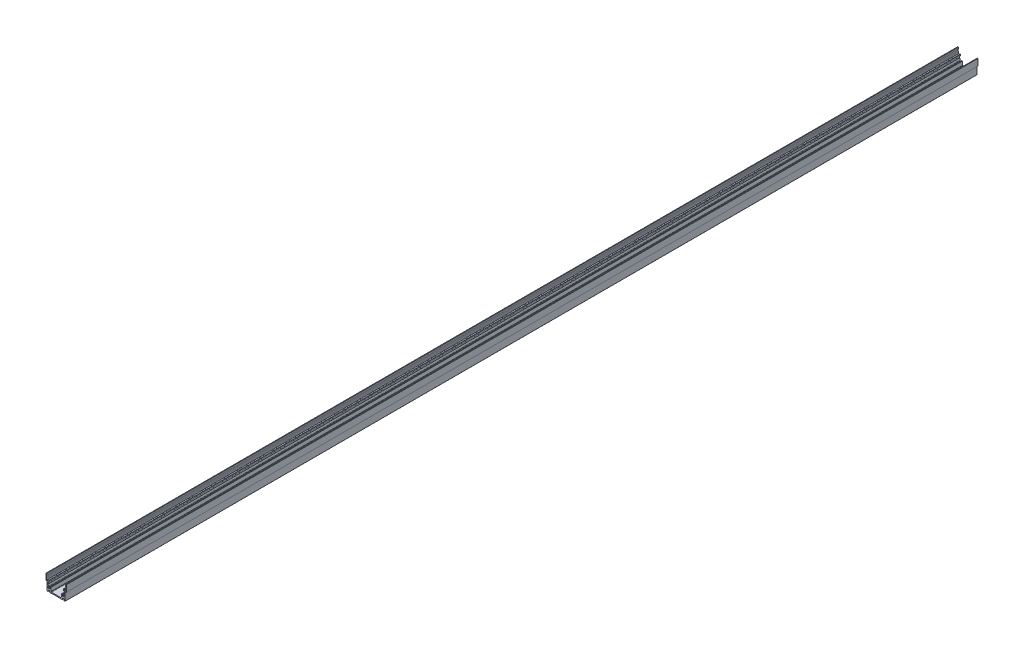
ISO-10303-21;
HEADER;
FILE_DESCRIPTION(('STEP AP214'),'2;1');
FILE_NAME('part.step','',(''),(''),'','','');
FILE_SCHEMA(('AUTOMOTIVE_DESIGN { 1 0 10303 214 1 1 1 1 }'));
ENDSEC;
DATA;
#1=APPLICATION_CONTEXT('core data for automotive mechanical design processes');
#2=APPLICATION_PROTOCOL_DEFINITION('international standard','automotive_design',2000,#1);
#3=PRODUCT_CONTEXT('',#1,'mechanical');
#4=PRODUCT('Part','Part','',(#3));
#5=PRODUCT_RELATED_PRODUCT_CATEGORY('part','',(#4));
#6=PRODUCT_DEFINITION_FORMATION('','',#4);
#7=PRODUCT_DEFINITION_CONTEXT('part definition',#1,'design');
#8=PRODUCT_DEFINITION('design','',#6,#7);
#9=PRODUCT_DEFINITION_SHAPE('','',#8);
#10=(LENGTH_UNIT() NAMED_UNIT(*) SI_UNIT(.MILLI.,.METRE.));
#11=(NAMED_UNIT(*) PLANE_ANGLE_UNIT() SI_UNIT($,.RADIAN.));
#12=(NAMED_UNIT(*) SI_UNIT($,.STERADIAN.) SOLID_ANGLE_UNIT());
#13=UNCERTAINTY_MEASURE_WITH_UNIT(LENGTH_MEASURE(1.E-05),#10,'distance_accuracy_value','');
#14=(GEOMETRIC_REPRESENTATION_CONTEXT(3) GLOBAL_UNCERTAINTY_ASSIGNED_CONTEXT((#13)) GLOBAL_UNIT_ASSIGNED_CONTEXT((#10,
#11,#12)) REPRESENTATION_CONTEXT('',''));
#15=CARTESIAN_POINT('',(0.,0.,0.));
#16=DIRECTION('',(0.,0.,1.));
#17=DIRECTION('',(1.,0.,0.));
#18=AXIS2_PLACEMENT_3D('',#15,#16,#17);
#19=CARTESIAN_POINT('',(-18.,26.302,270.));
#20=DIRECTION('',(1.,0.,0.));
#21=DIRECTION('',(0.,0.,-1.));
#22=AXIS2_PLACEMENT_3D('',#19,#20,#21);
#23=PLANE('',#22);
#24=DIRECTION('',(0.,-1.,0.));
#25=VECTOR('',#24,1.);
#26=CARTESIAN_POINT('',(-18.,26.302,0.));
#27=LINE('',#26,#25);
#28=CARTESIAN_POINT('',(-18.,26.302,0.));
#29=VERTEX_POINT('',#28);
#30=CARTESIAN_POINT('',(-18.,14.6986296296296,0.));
#31=VERTEX_POINT('',#30);
#32=EDGE_CURVE('E688',#29,#31,#27,.T.);
#33=ORIENTED_EDGE('',*,*,#32,.T.);
#34=DIRECTION('',(0.,0.,-1.));
#35=VECTOR('',#34,1.);
#36=CARTESIAN_POINT('',(-18.,14.6986296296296,270.));
#37=LINE('',#36,#35);
#38=CARTESIAN_POINT('',(-18.,14.6986296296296,1620.));
#39=VERTEX_POINT('',#38);
#40=EDGE_CURVE('E9',#39,#31,#37,.T.);
#41=ORIENTED_EDGE('',*,*,#40,.F.);
#42=DIRECTION('',(0.,1.,0.));
#43=VECTOR('',#42,1.);
#44=CARTESIAN_POINT('',(-18.,14.6986296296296,1620.));
#45=LINE('',#44,#43);
#46=CARTESIAN_POINT('',(-18.,26.302,1620.));
#47=VERTEX_POINT('',#46);
#48=EDGE_CURVE('E686',#39,#47,#45,.T.);
#49=ORIENTED_EDGE('',*,*,#48,.T.);
#50=DIRECTION('',(0.,0.,-1.));
#51=VECTOR('',#50,1.);
#52=CARTESIAN_POINT('',(-18.,26.302,270.));
#53=LINE('',#52,#51);
#54=EDGE_CURVE('E1281',#47,#29,#53,.T.);
#55=ORIENTED_EDGE('',*,*,#54,.T.);
#56=EDGE_LOOP('',(#33,#41,#49,#55));
#57=FACE_BOUND('',#56,.T.);
#58=ADVANCED_FACE('F14',(#57),#23,.F.);
#59=CARTESIAN_POINT('',(-18.,14.6986296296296,270.));
#60=DIRECTION('',(-0.287144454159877,0.957887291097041,0.));
#61=DIRECTION('',(-0.957887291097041,-0.287144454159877,0.));
#62=AXIS2_PLACEMENT_3D('',#59,#60,#61);
#63=PLANE('',#62);
#64=DIRECTION('',(0.957887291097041,0.287144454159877,0.));
#65=VECTOR('',#64,1.);
#66=CARTESIAN_POINT('',(-18.,14.6986296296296,0.));
#67=LINE('',#66,#65);
#68=CARTESIAN_POINT('',(-17.008,14.996,0.));
#69=VERTEX_POINT('',#68);
#70=EDGE_CURVE('E1025',#31,#69,#67,.T.);
#71=ORIENTED_EDGE('',*,*,#70,.T.);
#72=DIRECTION('',(0.,0.,-1.));
#73=VECTOR('',#72,1.);
#74=CARTESIAN_POINT('',(-17.008,14.996,270.));
#75=LINE('',#74,#73);
#76=CARTESIAN_POINT('',(-17.008,14.996,1620.));
#77=VERTEX_POINT('',#76);
#78=EDGE_CURVE('E21',#77,#69,#75,.T.);
#79=ORIENTED_EDGE('',*,*,#78,.F.);
#80=DIRECTION('',(-0.957887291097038,-0.287144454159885,0.));
#81=VECTOR('',#80,1.);
#82=CARTESIAN_POINT('',(-17.008,14.996,1620.));
#83=LINE('',#82,#81);
#84=EDGE_CURVE('E696',#77,#39,#83,.T.);
#85=ORIENTED_EDGE('',*,*,#84,.T.);
#86=ORIENTED_EDGE('',*,*,#40,.T.);
#87=EDGE_LOOP('',(#71,#79,#85,#86));
#88=FACE_BOUND('',#87,.T.);
#89=ADVANCED_FACE('F702',(#88),#63,.F.);
#90=CARTESIAN_POINT('',(-17.008,14.996,270.));
#91=DIRECTION('',(0.,1.,0.));
#92=DIRECTION('',(0.,0.,1.));
#93=AXIS2_PLACEMENT_3D('',#90,#91,#92);
#94=PLANE('',#93);
#95=DIRECTION('',(1.,0.,0.));
#96=VECTOR('',#95,1.);
#97=CARTESIAN_POINT('',(-17.008,14.996,0.));
#98=LINE('',#97,#96);
#99=CARTESIAN_POINT('',(-16.,14.996,0.));
#100=VERTEX_POINT('',#99);
#101=EDGE_CURVE('E1027',#69,#100,#98,.T.);
#102=ORIENTED_EDGE('',*,*,#101,.T.);
#103=DIRECTION('',(0.,0.,-1.));
#104=VECTOR('',#103,1.);
#105=CARTESIAN_POINT('',(-16.,14.996,270.));
#106=LINE('',#105,#104);
#107=CARTESIAN_POINT('',(-16.,14.996,1620.));
#108=VERTEX_POINT('',#107);
#109=EDGE_CURVE('E1554',#108,#100,#106,.T.);
#110=ORIENTED_EDGE('',*,*,#109,.F.);
#111=DIRECTION('',(-1.,0.,0.));
#112=VECTOR('',#111,1.);
#113=CARTESIAN_POINT('',(-16.,14.996,1620.));
#114=LINE('',#113,#112);
#115=EDGE_CURVE('E1022',#108,#77,#114,.T.);
#116=ORIENTED_EDGE('',*,*,#115,.T.);
#117=ORIENTED_EDGE('',*,*,#78,.T.);
#118=EDGE_LOOP('',(#102,#110,#116,#117));
#119=FACE_BOUND('',#118,.T.);
#120=ADVANCED_FACE('F1558',(#119),#94,.F.);
#121=CARTESIAN_POINT('',(-16.,14.996,270.));
#122=DIRECTION('',(1.,0.,0.));
#123=DIRECTION('',(0.,0.,-1.));
#124=AXIS2_PLACEMENT_3D('',#121,#122,#123);
#125=PLANE('',#124);
#126=DIRECTION('',(0.,-1.,0.));
#127=VECTOR('',#126,1.);
#128=CARTESIAN_POINT('',(-16.,14.996,0.));
#129=LINE('',#128,#127);
#130=CARTESIAN_POINT('',(-16.,0.0999999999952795,0.));
#131=VERTEX_POINT('',#130);
#132=EDGE_CURVE('E1029',#100,#131,#129,.T.);
#133=ORIENTED_EDGE('',*,*,#132,.T.);
#134=DIRECTION('',(0.,0.,-1.));
#135=VECTOR('',#134,1.);
#136=CARTESIAN_POINT('',(-16.,0.0999999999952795,270.));
#137=LINE('',#136,#135);
#138=CARTESIAN_POINT('',(-16.,0.0999999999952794,1620.));
#139=VERTEX_POINT('',#138);
#140=EDGE_CURVE('E1551',#139,#131,#137,.T.);
#141=ORIENTED_EDGE('',*,*,#140,.F.);
#142=DIRECTION('',(0.,1.,0.));
#143=VECTOR('',#142,1.);
#144=CARTESIAN_POINT('',(-16.,0.0999999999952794,1620.));
#145=LINE('',#144,#143);
#146=EDGE_CURVE('E1019',#139,#108,#145,.T.);
#147=ORIENTED_EDGE('',*,*,#146,.T.);
#148=ORIENTED_EDGE('',*,*,#109,.T.);
#149=EDGE_LOOP('',(#133,#141,#147,#148));
#150=FACE_BOUND('',#149,.T.);
#151=ADVANCED_FACE('F1565',(#150),#125,.F.);
#152=CARTESIAN_POINT('',(-15.702,0.0999999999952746,270.));
#153=DIRECTION('',(0.,0.,-1.));
#154=DIRECTION('',(-1.,0.,0.));
#155=AXIS2_PLACEMENT_3D('',#152,#153,#154);
#156=CYLINDRICAL_SURFACE('',#155,0.298);
#157=CARTESIAN_POINT('',(-15.702,0.0999999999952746,0.));
#158=DIRECTION('',(0.,0.,1.));
#159=DIRECTION('',(1.,0.,0.));
#160=AXIS2_PLACEMENT_3D('',#157,#158,#159);
#161=CIRCLE('',#160,0.298);
#162=CARTESIAN_POINT('',(-15.7020016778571,-0.198,0.));
#163=VERTEX_POINT('',#162);
#164=EDGE_CURVE('E1031',#131,#163,#161,.T.);
#165=ORIENTED_EDGE('',*,*,#164,.T.);
#166=DIRECTION('',(0.,0.,-1.));
#167=VECTOR('',#166,1.);
#168=CARTESIAN_POINT('',(-15.7020016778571,-0.198,270.));
#169=LINE('',#168,#167);
#170=CARTESIAN_POINT('',(-15.7020016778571,-0.198,1620.));
#171=VERTEX_POINT('',#170);
#172=EDGE_CURVE('E1548',#171,#163,#169,.T.);
#173=ORIENTED_EDGE('',*,*,#172,.F.);
#174=CARTESIAN_POINT('',(-15.702,0.0999999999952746,1620.));
#175=DIRECTION('',(0.,0.,-1.));
#176=DIRECTION('',(-1.,0.,0.));
#177=AXIS2_PLACEMENT_3D('',#174,#175,#176);
#178=CIRCLE('',#177,0.298);
#179=EDGE_CURVE('E1016',#171,#139,#178,.T.);
#180=ORIENTED_EDGE('',*,*,#179,.T.);
#181=ORIENTED_EDGE('',*,*,#140,.T.);
#182=EDGE_LOOP('',(#165,#173,#180,#181));
#183=FACE_BOUND('',#182,.T.);
#184=ADVANCED_FACE('F1568',(#183),#156,.T.);
#185=CARTESIAN_POINT('',(-15.7020016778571,-0.198,270.));
#186=DIRECTION('',(0.,1.,0.));
#187=DIRECTION('',(0.,0.,1.));
#188=AXIS2_PLACEMENT_3D('',#185,#186,#187);
#189=PLANE('',#188);
#190=DIRECTION('',(1.,0.,0.));
#191=VECTOR('',#190,1.);
#192=CARTESIAN_POINT('',(-15.7020016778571,-0.198,0.));
#193=LINE('',#192,#191);
#194=CARTESIAN_POINT('',(-14.2773032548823,-0.198,0.));
#195=VERTEX_POINT('',#194);
#196=EDGE_CURVE('E1033',#163,#195,#193,.T.);
#197=ORIENTED_EDGE('',*,*,#196,.T.);
#198=DIRECTION('',(0.,0.,-1.));
#199=VECTOR('',#198,1.);
#200=CARTESIAN_POINT('',(-14.2773032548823,-0.198,270.));
#201=LINE('',#200,#199);
#202=CARTESIAN_POINT('',(-14.2773032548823,-0.197999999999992,1620.));
#203=VERTEX_POINT('',#202);
#204=EDGE_CURVE('E1545',#203,#195,#201,.T.);
#205=ORIENTED_EDGE('',*,*,#204,.F.);
#206=DIRECTION('',(-1.,0.,0.));
#207=VECTOR('',#206,1.);
#208=CARTESIAN_POINT('',(-14.2773032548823,-0.197999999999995,1620.));
#209=LINE('',#208,#207);
#210=EDGE_CURVE('E1013',#203,#171,#209,.T.);
#211=ORIENTED_EDGE('',*,*,#210,.T.);
#212=ORIENTED_EDGE('',*,*,#172,.T.);
#213=EDGE_LOOP('',(#197,#205,#211,#212));
#214=FACE_BOUND('',#213,.T.);
#215=ADVANCED_FACE('F1573',(#214),#189,.F.);
#216=CARTESIAN_POINT('',(-14.2773038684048,0.0999999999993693,270.));
#217=DIRECTION('',(0.,0.,-1.));
#218=DIRECTION('',(-1.,0.,0.));
#219=AXIS2_PLACEMENT_3D('',#216,#217,#218);
#220=CYLINDRICAL_SURFACE('',#219,0.298);
#221=CARTESIAN_POINT('',(-14.2773038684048,0.0999999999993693,0.));
#222=DIRECTION('',(0.,0.,1.));
#223=DIRECTION('',(1.,0.,0.));
#224=AXIS2_PLACEMENT_3D('',#221,#222,#223);
#225=CIRCLE('',#224,0.298);
#226=CARTESIAN_POINT('',(-13.9819190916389,0.0606066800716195,0.));
#227=VERTEX_POINT('',#226);
#228=EDGE_CURVE('E1035',#195,#227,#225,.T.);
#229=ORIENTED_EDGE('',*,*,#228,.T.);
#230=DIRECTION('',(0.,0.,-1.));
#231=VECTOR('',#230,1.);
#232=CARTESIAN_POINT('',(-13.9819190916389,0.0606066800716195,270.));
#233=LINE('',#232,#231);
#234=CARTESIAN_POINT('',(-13.9819190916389,0.0606066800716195,1620.));
#235=VERTEX_POINT('',#234);
#236=EDGE_CURVE('E1542',#235,#227,#233,.T.);
#237=ORIENTED_EDGE('',*,*,#236,.F.);
#238=CARTESIAN_POINT('',(-14.2773038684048,0.0999999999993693,1620.));
#239=DIRECTION('',(0.,0.,-1.));
#240=DIRECTION('',(-1.,0.,0.));
#241=AXIS2_PLACEMENT_3D('',#238,#239,#240);
#242=CIRCLE('',#241,0.297999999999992);
#243=EDGE_CURVE('E1010',#235,#203,#242,.T.);
#244=ORIENTED_EDGE('',*,*,#243,.T.);
#245=ORIENTED_EDGE('',*,*,#204,.T.);
#246=EDGE_LOOP('',(#229,#237,#244,#245));
#247=FACE_BOUND('',#246,.T.);
#248=ADVANCED_FACE('F1576',(#247),#220,.T.);
#249=CARTESIAN_POINT('',(-13.9819190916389,0.0606066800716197,270.));
#250=DIRECTION('',(-0.991224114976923,0.132192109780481,0.));
#251=DIRECTION('',(-0.132192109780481,-0.991224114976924,0.));
#252=AXIS2_PLACEMENT_3D('',#249,#250,#251);
#253=PLANE('',#252);
#254=DIRECTION('',(0.132192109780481,0.991224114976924,0.));
#255=VECTOR('',#254,1.);
#256=CARTESIAN_POINT('',(-13.9819190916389,0.0606066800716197,0.));
#257=LINE('',#256,#255);
#258=CARTESIAN_POINT('',(-13.6770576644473,2.34656761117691,0.));
#259=VERTEX_POINT('',#258);
#260=EDGE_CURVE('E1037',#227,#259,#257,.T.);
#261=ORIENTED_EDGE('',*,*,#260,.T.);
#262=DIRECTION('',(0.,0.,-1.));
#263=VECTOR('',#262,1.);
#264=CARTESIAN_POINT('',(-13.6770576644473,2.34656761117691,270.));
#265=LINE('',#264,#263);
#266=CARTESIAN_POINT('',(-13.6770576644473,2.34656761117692,1620.));
#267=VERTEX_POINT('',#266);
#268=EDGE_CURVE('E1540',#267,#259,#265,.T.);
#269=ORIENTED_EDGE('',*,*,#268,.F.);
#270=DIRECTION('',(-0.132192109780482,-0.991224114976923,0.));
#271=VECTOR('',#270,1.);
#272=CARTESIAN_POINT('',(-13.6770576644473,2.34656761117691,1620.));
#273=LINE('',#272,#271);
#274=EDGE_CURVE('E1007',#267,#235,#273,.T.);
#275=ORIENTED_EDGE('',*,*,#274,.T.);
#276=ORIENTED_EDGE('',*,*,#236,.T.);
#277=EDGE_LOOP('',(#261,#269,#275,#276));
#278=FACE_BOUND('',#277,.T.);
#279=ADVANCED_FACE('F1581',(#278),#253,.F.);
#280=CARTESIAN_POINT('',(-13.1854105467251,2.281,270.));
#281=DIRECTION('',(0.,0.,-1.));
#282=DIRECTION('',(-1.,0.,0.));
#283=AXIS2_PLACEMENT_3D('',#280,#281,#282);
#284=CYLINDRICAL_SURFACE('',#283,0.496);
#285=CARTESIAN_POINT('',(-13.1854105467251,2.281,0.));
#286=DIRECTION('',(0.,0.,1.));
#287=DIRECTION('',(1.,0.,0.));
#288=AXIS2_PLACEMENT_3D('',#285,#286,#287);
#289=CIRCLE('',#288,0.496);
#290=CARTESIAN_POINT('',(-13.1854106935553,2.777,0.));
#291=VERTEX_POINT('',#290);
#292=EDGE_CURVE('E1040',#291,#259,#289,.T.);
#293=ORIENTED_EDGE('',*,*,#292,.F.);
#294=DIRECTION('',(0.,0.,-1.));
#295=VECTOR('',#294,1.);
#296=CARTESIAN_POINT('',(-13.1854106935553,2.777,270.));
#297=LINE('',#296,#295);
#298=CARTESIAN_POINT('',(-13.1854106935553,2.777,1620.));
#299=VERTEX_POINT('',#298);
#300=EDGE_CURVE('E1538',#299,#291,#297,.T.);
#301=ORIENTED_EDGE('',*,*,#300,.F.);
#302=CARTESIAN_POINT('',(-13.1854105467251,2.281,1620.));
#303=DIRECTION('',(0.,0.,1.));
#304=DIRECTION('',(-1.,0.,0.));
#305=AXIS2_PLACEMENT_3D('',#302,#303,#304);
#306=CIRCLE('',#305,0.496000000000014);
#307=EDGE_CURVE('E1004',#299,#267,#306,.T.);
#308=ORIENTED_EDGE('',*,*,#307,.T.);
#309=ORIENTED_EDGE('',*,*,#268,.T.);
#310=EDGE_LOOP('',(#293,#301,#308,#309));
#311=FACE_BOUND('',#310,.T.);
#312=ADVANCED_FACE('F1586',(#311),#284,.F.);
#313=CARTESIAN_POINT('',(-13.1854106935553,2.777,270.));
#314=DIRECTION('',(0.,1.,0.));
#315=DIRECTION('',(0.,0.,1.));
#316=AXIS2_PLACEMENT_3D('',#313,#314,#315);
#317=PLANE('',#316);
#318=DIRECTION('',(1.,0.,0.));
#319=VECTOR('',#318,1.);
#320=CARTESIAN_POINT('',(-13.1854106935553,2.777,0.));
#321=LINE('',#320,#319);
#322=CARTESIAN_POINT('',(-12.0205892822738,2.777,0.));
#323=VERTEX_POINT('',#322);
#324=EDGE_CURVE('E1043',#291,#323,#321,.T.);
#325=ORIENTED_EDGE('',*,*,#324,.T.);
#326=DIRECTION('',(0.,0.,-1.));
#327=VECTOR('',#326,1.);
#328=CARTESIAN_POINT('',(-12.0205892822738,2.777,270.));
#329=LINE('',#328,#327);
#330=CARTESIAN_POINT('',(-12.0205892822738,2.777,1620.));
#331=VERTEX_POINT('',#330);
#332=EDGE_CURVE('E1536',#331,#323,#329,.T.);
#333=ORIENTED_EDGE('',*,*,#332,.F.);
#334=DIRECTION('',(-1.,0.,0.));
#335=VECTOR('',#334,1.);
#336=CARTESIAN_POINT('',(-12.0205892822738,2.777,1620.));
#337=LINE('',#336,#335);
#338=EDGE_CURVE('E1001',#331,#299,#337,.T.);
#339=ORIENTED_EDGE('',*,*,#338,.T.);
#340=ORIENTED_EDGE('',*,*,#300,.T.);
#341=EDGE_LOOP('',(#325,#333,#339,#340));
#342=FACE_BOUND('',#341,.T.);
#343=ADVANCED_FACE('F1588',(#342),#317,.F.);
#344=CARTESIAN_POINT('',(-12.0205895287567,2.28100000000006,270.));
#345=DIRECTION('',(0.,0.,-1.));
#346=DIRECTION('',(-1.,0.,0.));
#347=AXIS2_PLACEMENT_3D('',#344,#345,#346);
#348=CYLINDRICAL_SURFACE('',#347,0.496);
#349=CARTESIAN_POINT('',(-12.0205895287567,2.28100000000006,0.));
#350=DIRECTION('',(0.,0.,1.));
#351=DIRECTION('',(1.,0.,0.));
#352=AXIS2_PLACEMENT_3D('',#349,#350,#351);
#353=CIRCLE('',#352,0.496);
#354=CARTESIAN_POINT('',(-11.5289320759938,2.34649006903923,0.));
#355=VERTEX_POINT('',#354);
#356=EDGE_CURVE('E1046',#355,#323,#353,.T.);
#357=ORIENTED_EDGE('',*,*,#356,.F.);
#358=DIRECTION('',(0.,0.,-1.));
#359=VECTOR('',#358,1.);
#360=CARTESIAN_POINT('',(-11.5289320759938,2.34649006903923,270.));
#361=LINE('',#360,#359);
#362=CARTESIAN_POINT('',(-11.5289320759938,2.34649006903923,1620.));
#363=VERTEX_POINT('',#362);
#364=EDGE_CURVE('E1534',#363,#355,#361,.T.);
#365=ORIENTED_EDGE('',*,*,#364,.F.);
#366=CARTESIAN_POINT('',(-12.0205895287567,2.28100000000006,1620.));
#367=DIRECTION('',(0.,0.,1.));
#368=DIRECTION('',(-1.,0.,0.));
#369=AXIS2_PLACEMENT_3D('',#366,#367,#368);
#370=CIRCLE('',#369,0.496);
#371=EDGE_CURVE('E998',#363,#331,#370,.T.);
#372=ORIENTED_EDGE('',*,*,#371,.T.);
#373=ORIENTED_EDGE('',*,*,#332,.T.);
#374=EDGE_LOOP('',(#357,#365,#372,#373));
#375=FACE_BOUND('',#374,.T.);
#376=ADVANCED_FACE('F1593',(#375),#348,.F.);
#377=CARTESIAN_POINT('',(-11.5289320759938,2.34649006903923,270.));
#378=DIRECTION('',(0.991244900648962,0.132036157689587,0.));
#379=DIRECTION('',(-0.132036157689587,0.991244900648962,0.));
#380=AXIS2_PLACEMENT_3D('',#377,#378,#379);
#381=PLANE('',#380);
#382=DIRECTION('',(0.132036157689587,-0.991244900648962,0.));
#383=VECTOR('',#382,1.);
#384=CARTESIAN_POINT('',(-11.5289320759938,2.34649006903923,0.));
#385=LINE('',#384,#383);
#386=CARTESIAN_POINT('',(-11.19,-0.198,0.));
#387=VERTEX_POINT('',#386);
#388=EDGE_CURVE('E1049',#355,#387,#385,.T.);
#389=ORIENTED_EDGE('',*,*,#388,.T.);
#390=DIRECTION('',(0.,0.,-1.));
#391=VECTOR('',#390,1.);
#392=CARTESIAN_POINT('',(-11.19,-0.198,270.));
#393=LINE('',#392,#391);
#394=CARTESIAN_POINT('',(-11.19,-0.198,1620.));
#395=VERTEX_POINT('',#394);
#396=EDGE_CURVE('E1531',#395,#387,#393,.T.);
#397=ORIENTED_EDGE('',*,*,#396,.F.);
#398=DIRECTION('',(-0.13203615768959,0.991244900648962,0.));
#399=VECTOR('',#398,1.);
#400=CARTESIAN_POINT('',(-11.19,-0.198,1620.));
#401=LINE('',#400,#399);
#402=EDGE_CURVE('E995',#395,#363,#401,.T.);
#403=ORIENTED_EDGE('',*,*,#402,.T.);
#404=ORIENTED_EDGE('',*,*,#364,.T.);
#405=EDGE_LOOP('',(#389,#397,#403,#404));
#406=FACE_BOUND('',#405,.T.);
#407=ADVANCED_FACE('F1598',(#406),#381,.F.);
#408=CARTESIAN_POINT('',(-11.19,-0.198,270.));
#409=DIRECTION('',(0.,1.,0.));
#410=DIRECTION('',(-1.,0.,0.));
#411=AXIS2_PLACEMENT_3D('',#408,#409,#410);
#412=PLANE('',#411);
#413=DIRECTION('',(1.,0.,0.));
#414=VECTOR('',#413,1.);
#415=CARTESIAN_POINT('',(-11.19,-0.198,0.));
#416=LINE('',#415,#414);
#417=CARTESIAN_POINT('',(-7.663,-0.198,0.));
#418=VERTEX_POINT('',#417);
#419=EDGE_CURVE('E1051',#387,#418,#416,.T.);
#420=ORIENTED_EDGE('',*,*,#419,.T.);
#421=DIRECTION('',(0.,0.,-1.));
#422=VECTOR('',#421,1.);
#423=CARTESIAN_POINT('',(-7.663,-0.198,270.));
#424=LINE('',#423,#422);
#425=CARTESIAN_POINT('',(-7.663,-0.198,1620.));
#426=VERTEX_POINT('',#425);
#427=EDGE_CURVE('E1529',#426,#418,#424,.T.);
#428=ORIENTED_EDGE('',*,*,#427,.F.);
#429=DIRECTION('',(-1.,0.,0.));
#430=VECTOR('',#429,1.);
#431=CARTESIAN_POINT('',(-7.663,-0.198,1620.));
#432=LINE('',#431,#430);
#433=EDGE_CURVE('E992',#426,#395,#432,.T.);
#434=ORIENTED_EDGE('',*,*,#433,.T.);
#435=ORIENTED_EDGE('',*,*,#396,.T.);
#436=EDGE_LOOP('',(#420,#428,#434,#435));
#437=FACE_BOUND('',#436,.T.);
#438=ADVANCED_FACE('F1600',(#437),#412,.F.);
#439=CARTESIAN_POINT('',(-7.14898437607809,-0.752368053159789,270.));
#440=DIRECTION('',(0.,0.,-1.));
#441=DIRECTION('',(-1.,0.,0.));
#442=AXIS2_PLACEMENT_3D('',#439,#440,#441);
#443=CYLINDRICAL_SURFACE('',#442,0.756);
#444=CARTESIAN_POINT('',(-7.14898437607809,-0.752368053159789,0.));
#445=DIRECTION('',(0.,0.,1.));
#446=DIRECTION('',(1.,0.,0.));
#447=AXIS2_PLACEMENT_3D('',#444,#445,#446);
#448=CIRCLE('',#447,0.756);
#449=CARTESIAN_POINT('',(-7.223,0.,0.));
#450=VERTEX_POINT('',#449);
#451=EDGE_CURVE('E1054',#450,#418,#448,.T.);
#452=ORIENTED_EDGE('',*,*,#451,.F.);
#453=DIRECTION('',(0.,0.,-1.));
#454=VECTOR('',#453,1.);
#455=CARTESIAN_POINT('',(-7.223,0.,270.));
#456=LINE('',#455,#454);
#457=CARTESIAN_POINT('',(-7.223,0.,1620.));
#458=VERTEX_POINT('',#457);
#459=EDGE_CURVE('E1527',#458,#450,#456,.T.);
#460=ORIENTED_EDGE('',*,*,#459,.F.);
#461=CARTESIAN_POINT('',(-7.14898437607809,-0.752368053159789,1620.));
#462=DIRECTION('',(0.,0.,1.));
#463=DIRECTION('',(-1.,0.,0.));
#464=AXIS2_PLACEMENT_3D('',#461,#462,#463);
#465=CIRCLE('',#464,0.756);
#466=EDGE_CURVE('E989',#458,#426,#465,.T.);
#467=ORIENTED_EDGE('',*,*,#466,.T.);
#468=ORIENTED_EDGE('',*,*,#427,.T.);
#469=EDGE_LOOP('',(#452,#460,#467,#468));
#470=FACE_BOUND('',#469,.T.);
#471=ADVANCED_FACE('F1604',(#470),#443,.F.);
#472=CARTESIAN_POINT('',(-7.223,0.,270.));
#473=DIRECTION('',(0.,1.,0.));
#474=DIRECTION('',(0.,0.,1.));
#475=AXIS2_PLACEMENT_3D('',#472,#473,#474);
#476=PLANE('',#475);
#477=DIRECTION('',(1.,0.,0.));
#478=VECTOR('',#477,1.);
#479=CARTESIAN_POINT('',(-7.223,0.,0.));
#480=LINE('',#479,#478);
#481=CARTESIAN_POINT('',(7.223,0.,0.));
#482=VERTEX_POINT('',#481);
#483=EDGE_CURVE('E1057',#450,#482,#480,.T.);
#484=ORIENTED_EDGE('',*,*,#483,.T.);
#485=DIRECTION('',(0.,0.,-1.));
#486=VECTOR('',#485,1.);
#487=CARTESIAN_POINT('',(7.223,0.,270.));
#488=LINE('',#487,#486);
#489=CARTESIAN_POINT('',(7.223,0.,1620.));
#490=VERTEX_POINT('',#489);
#491=EDGE_CURVE('E1525',#490,#482,#488,.T.);
#492=ORIENTED_EDGE('',*,*,#491,.F.);
#493=DIRECTION('',(-1.,0.,0.));
#494=VECTOR('',#493,1.);
#495=CARTESIAN_POINT('',(7.223,0.,1620.));
#496=LINE('',#495,#494);
#497=EDGE_CURVE('E986',#490,#458,#496,.T.);
#498=ORIENTED_EDGE('',*,*,#497,.T.);
#499=ORIENTED_EDGE('',*,*,#459,.T.);
#500=EDGE_LOOP('',(#484,#492,#498,#499));
#501=FACE_BOUND('',#500,.T.);
#502=ADVANCED_FACE('F1609',(#501),#476,.F.);
#503=CARTESIAN_POINT('',(7.14898437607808,-0.752368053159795,270.));
#504=DIRECTION('',(0.,0.,-1.));
#505=DIRECTION('',(-1.,0.,0.));
#506=AXIS2_PLACEMENT_3D('',#503,#504,#505);
#507=CYLINDRICAL_SURFACE('',#506,0.756);
#508=CARTESIAN_POINT('',(7.14898437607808,-0.752368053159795,0.));
#509=DIRECTION('',(0.,0.,1.));
#510=DIRECTION('',(1.,0.,0.));
#511=AXIS2_PLACEMENT_3D('',#508,#509,#510);
#512=CIRCLE('',#511,0.756);
#513=CARTESIAN_POINT('',(7.663,-0.198,0.));
#514=VERTEX_POINT('',#513);
#515=EDGE_CURVE('E1060',#514,#482,#512,.T.);
#516=ORIENTED_EDGE('',*,*,#515,.F.);
#517=DIRECTION('',(0.,0.,-1.));
#518=VECTOR('',#517,1.);
#519=CARTESIAN_POINT('',(7.663,-0.198,270.));
#520=LINE('',#519,#518);
#521=CARTESIAN_POINT('',(7.663,-0.198,1620.));
#522=VERTEX_POINT('',#521);
#523=EDGE_CURVE('E1523',#522,#514,#520,.T.);
#524=ORIENTED_EDGE('',*,*,#523,.F.);
#525=CARTESIAN_POINT('',(7.14898437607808,-0.752368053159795,1620.));
#526=DIRECTION('',(0.,0.,1.));
#527=DIRECTION('',(-1.,0.,0.));
#528=AXIS2_PLACEMENT_3D('',#525,#526,#527);
#529=CIRCLE('',#528,0.756000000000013);
#530=EDGE_CURVE('E983',#522,#490,#529,.T.);
#531=ORIENTED_EDGE('',*,*,#530,.T.);
#532=ORIENTED_EDGE('',*,*,#491,.T.);
#533=EDGE_LOOP('',(#516,#524,#531,#532));
#534=FACE_BOUND('',#533,.T.);
#535=ADVANCED_FACE('F1612',(#534),#507,.F.);
#536=CARTESIAN_POINT('',(7.663,-0.198,270.));
#537=DIRECTION('',(0.,1.,0.));
#538=DIRECTION('',(-1.,0.,0.));
#539=AXIS2_PLACEMENT_3D('',#536,#537,#538);
#540=PLANE('',#539);
#541=DIRECTION('',(1.,0.,0.));
#542=VECTOR('',#541,1.);
#543=CARTESIAN_POINT('',(7.663,-0.198,0.));
#544=LINE('',#543,#542);
#545=CARTESIAN_POINT('',(10.93,-0.198,0.));
#546=VERTEX_POINT('',#545);
#547=EDGE_CURVE('E1063',#514,#546,#544,.T.);
#548=ORIENTED_EDGE('',*,*,#547,.T.);
#549=DIRECTION('',(0.,0.,-1.));
#550=VECTOR('',#549,1.);
#551=CARTESIAN_POINT('',(10.93,-0.198,270.));
#552=LINE('',#551,#550);
#553=CARTESIAN_POINT('',(10.93,-0.197999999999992,1620.));
#554=VERTEX_POINT('',#553);
#555=EDGE_CURVE('E1520',#554,#546,#552,.T.);
#556=ORIENTED_EDGE('',*,*,#555,.F.);
#557=DIRECTION('',(-1.,0.,0.));
#558=VECTOR('',#557,1.);
#559=CARTESIAN_POINT('',(10.93,-0.197999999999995,1620.));
#560=LINE('',#559,#558);
#561=EDGE_CURVE('E980',#554,#522,#560,.T.);
#562=ORIENTED_EDGE('',*,*,#561,.T.);
#563=ORIENTED_EDGE('',*,*,#523,.T.);
#564=EDGE_LOOP('',(#548,#556,#562,#563));
#565=FACE_BOUND('',#564,.T.);
#566=ADVANCED_FACE('F1616',(#565),#540,.F.);
#567=CARTESIAN_POINT('',(10.9286957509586,0.0999971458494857,270.));
#568=DIRECTION('',(0.,0.,-1.));
#569=DIRECTION('',(-1.,0.,0.));
#570=AXIS2_PLACEMENT_3D('',#567,#568,#569);
#571=CYLINDRICAL_SURFACE('',#570,0.298);
#572=CARTESIAN_POINT('',(10.9286957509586,0.0999971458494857,0.));
#573=DIRECTION('',(0.,0.,1.));
#574=DIRECTION('',(1.,0.,0.));
#575=AXIS2_PLACEMENT_3D('',#572,#573,#574);
#576=CIRCLE('',#575,0.298);
#577=CARTESIAN_POINT('',(11.2240805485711,0.0606039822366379,0.));
#578=VERTEX_POINT('',#577);
#579=EDGE_CURVE('E1065',#546,#578,#576,.T.);
#580=ORIENTED_EDGE('',*,*,#579,.T.);
#581=DIRECTION('',(0.,0.,-1.));
#582=VECTOR('',#581,1.);
#583=CARTESIAN_POINT('',(11.2240805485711,0.0606039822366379,270.));
#584=LINE('',#583,#582);
#585=CARTESIAN_POINT('',(11.2240805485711,0.0606039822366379,1620.));
#586=VERTEX_POINT('',#585);
#587=EDGE_CURVE('E1517',#586,#578,#584,.T.);
#588=ORIENTED_EDGE('',*,*,#587,.F.);
#589=CARTESIAN_POINT('',(10.9286957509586,0.0999971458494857,1620.));
#590=DIRECTION('',(0.,0.,-1.));
#591=DIRECTION('',(-1.,0.,0.));
#592=AXIS2_PLACEMENT_3D('',#589,#590,#591);
#593=CIRCLE('',#592,0.297999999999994);
#594=EDGE_CURVE('E977',#586,#554,#593,.T.);
#595=ORIENTED_EDGE('',*,*,#594,.T.);
#596=ORIENTED_EDGE('',*,*,#555,.T.);
#597=EDGE_LOOP('',(#580,#588,#595,#596));
#598=FACE_BOUND('',#597,.T.);
#599=ADVANCED_FACE('F1620',(#598),#571,.T.);
#600=CARTESIAN_POINT('',(11.2240805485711,0.0606039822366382,270.));
#601=DIRECTION('',(-0.991224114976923,0.132192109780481,0.));
#602=DIRECTION('',(-0.132192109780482,-0.991224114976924,0.));
#603=AXIS2_PLACEMENT_3D('',#600,#601,#602);
#604=PLANE('',#603);
#605=DIRECTION('',(0.132192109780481,0.991224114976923,0.));
#606=VECTOR('',#605,1.);
#607=CARTESIAN_POINT('',(11.2240805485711,0.0606039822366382,0.));
#608=LINE('',#607,#606);
#609=CARTESIAN_POINT('',(11.5289423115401,2.3465674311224,0.));
#610=VERTEX_POINT('',#609);
#611=EDGE_CURVE('E1067',#578,#610,#608,.T.);
#612=ORIENTED_EDGE('',*,*,#611,.T.);
#613=DIRECTION('',(0.,0.,-1.));
#614=VECTOR('',#613,1.);
#615=CARTESIAN_POINT('',(11.5289423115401,2.3465674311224,270.));
#616=LINE('',#615,#614);
#617=CARTESIAN_POINT('',(11.5289423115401,2.3465674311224,1620.));
#618=VERTEX_POINT('',#617);
#619=EDGE_CURVE('E1515',#618,#610,#616,.T.);
#620=ORIENTED_EDGE('',*,*,#619,.F.);
#621=DIRECTION('',(-0.132192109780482,-0.991224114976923,0.));
#622=VECTOR('',#621,1.);
#623=CARTESIAN_POINT('',(11.5289423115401,2.3465674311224,1620.));
#624=LINE('',#623,#622);
#625=EDGE_CURVE('E974',#618,#586,#624,.T.);
#626=ORIENTED_EDGE('',*,*,#625,.T.);
#627=ORIENTED_EDGE('',*,*,#587,.T.);
#628=EDGE_LOOP('',(#612,#620,#626,#627));
#629=FACE_BOUND('',#628,.T.);
#630=ADVANCED_FACE('F1625',(#629),#604,.F.);
#631=CARTESIAN_POINT('',(12.020589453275,2.28100000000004,270.));
#632=DIRECTION('',(0.,0.,-1.));
#633=DIRECTION('',(-1.,0.,0.));
#634=AXIS2_PLACEMENT_3D('',#631,#632,#633);
#635=CYLINDRICAL_SURFACE('',#634,0.496);
#636=CARTESIAN_POINT('',(12.020589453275,2.28100000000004,0.));
#637=DIRECTION('',(0.,0.,1.));
#638=DIRECTION('',(1.,0.,0.));
#639=AXIS2_PLACEMENT_3D('',#636,#637,#638);
#640=CIRCLE('',#639,0.496);
#641=CARTESIAN_POINT('',(12.0205892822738,2.777,0.));
#642=VERTEX_POINT('',#641);
#643=EDGE_CURVE('E1070',#642,#610,#640,.T.);
#644=ORIENTED_EDGE('',*,*,#643,.F.);
#645=DIRECTION('',(0.,0.,-1.));
#646=VECTOR('',#645,1.);
#647=CARTESIAN_POINT('',(12.0205892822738,2.777,270.));
#648=LINE('',#647,#646);
#649=CARTESIAN_POINT('',(12.0205892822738,2.777,1620.));
#650=VERTEX_POINT('',#649);
#651=EDGE_CURVE('E1513',#650,#642,#648,.T.);
#652=ORIENTED_EDGE('',*,*,#651,.F.);
#653=CARTESIAN_POINT('',(12.020589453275,2.28100000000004,1620.));
#654=DIRECTION('',(0.,0.,1.));
#655=DIRECTION('',(-1.,0.,0.));
#656=AXIS2_PLACEMENT_3D('',#653,#654,#655);
#657=CIRCLE('',#656,0.496);
#658=EDGE_CURVE('E971',#650,#618,#657,.T.);
#659=ORIENTED_EDGE('',*,*,#658,.T.);
#660=ORIENTED_EDGE('',*,*,#619,.T.);
#661=EDGE_LOOP('',(#644,#652,#659,#660));
#662=FACE_BOUND('',#661,.T.);
#663=ADVANCED_FACE('F1630',(#662),#635,.F.);
#664=CARTESIAN_POINT('',(12.0205892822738,2.777,270.));
#665=DIRECTION('',(0.,1.,0.));
#666=DIRECTION('',(0.,0.,1.));
#667=AXIS2_PLACEMENT_3D('',#664,#665,#666);
#668=PLANE('',#667);
#669=DIRECTION('',(1.,0.,0.));
#670=VECTOR('',#669,1.);
#671=CARTESIAN_POINT('',(12.0205892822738,2.777,0.));
#672=LINE('',#671,#670);
#673=CARTESIAN_POINT('',(13.1854106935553,2.777,0.));
#674=VERTEX_POINT('',#673);
#675=EDGE_CURVE('E1073',#642,#674,#672,.T.);
#676=ORIENTED_EDGE('',*,*,#675,.T.);
#677=DIRECTION('',(0.,0.,-1.));
#678=VECTOR('',#677,1.);
#679=CARTESIAN_POINT('',(13.1854106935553,2.777,270.));
#680=LINE('',#679,#678);
#681=CARTESIAN_POINT('',(13.1854106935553,2.777,1620.));
#682=VERTEX_POINT('',#681);
#683=EDGE_CURVE('E1511',#682,#674,#680,.T.);
#684=ORIENTED_EDGE('',*,*,#683,.F.);
#685=DIRECTION('',(-1.,0.,0.));
#686=VECTOR('',#685,1.);
#687=CARTESIAN_POINT('',(13.1854106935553,2.777,1620.));
#688=LINE('',#687,#686);
#689=EDGE_CURVE('E968',#682,#650,#688,.T.);
#690=ORIENTED_EDGE('',*,*,#689,.T.);
#691=ORIENTED_EDGE('',*,*,#651,.T.);
#692=EDGE_LOOP('',(#676,#684,#690,#691));
#693=FACE_BOUND('',#692,.T.);
#694=ADVANCED_FACE('F1632',(#693),#668,.F.);
#695=CARTESIAN_POINT('',(13.1854105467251,2.281,270.));
#696=DIRECTION('',(0.,0.,-1.));
#697=DIRECTION('',(-1.,0.,0.));
#698=AXIS2_PLACEMENT_3D('',#695,#696,#697);
#699=CYLINDRICAL_SURFACE('',#698,0.496);
#700=CARTESIAN_POINT('',(13.1854105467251,2.281,0.));
#701=DIRECTION('',(0.,0.,1.));
#702=DIRECTION('',(1.,0.,0.));
#703=AXIS2_PLACEMENT_3D('',#700,#701,#702);
#704=CIRCLE('',#703,0.496);
#705=CARTESIAN_POINT('',(13.6770576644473,2.34656761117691,0.));
#706=VERTEX_POINT('',#705);
#707=EDGE_CURVE('E1076',#706,#674,#704,.T.);
#708=ORIENTED_EDGE('',*,*,#707,.F.);
#709=DIRECTION('',(0.,0.,-1.));
#710=VECTOR('',#709,1.);
#711=CARTESIAN_POINT('',(13.6770576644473,2.34656761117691,270.));
#712=LINE('',#711,#710);
#713=CARTESIAN_POINT('',(13.6770576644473,2.34656761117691,1620.));
#714=VERTEX_POINT('',#713);
#715=EDGE_CURVE('E1509',#714,#706,#712,.T.);
#716=ORIENTED_EDGE('',*,*,#715,.F.);
#717=CARTESIAN_POINT('',(13.1854105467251,2.281,1620.));
#718=DIRECTION('',(0.,0.,1.));
#719=DIRECTION('',(-1.,0.,0.));
#720=AXIS2_PLACEMENT_3D('',#717,#718,#719);
#721=CIRCLE('',#720,0.496);
#722=EDGE_CURVE('E965',#714,#682,#721,.T.);
#723=ORIENTED_EDGE('',*,*,#722,.T.);
#724=ORIENTED_EDGE('',*,*,#683,.T.);
#725=EDGE_LOOP('',(#708,#716,#723,#724));
#726=FACE_BOUND('',#725,.T.);
#727=ADVANCED_FACE('F1637',(#726),#699,.F.);
#728=CARTESIAN_POINT('',(13.6770576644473,2.34656761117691,270.));
#729=DIRECTION('',(0.991224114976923,0.132192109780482,0.));
#730=DIRECTION('',(-0.132192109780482,0.991224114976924,0.));
#731=AXIS2_PLACEMENT_3D('',#728,#729,#730);
#732=PLANE('',#731);
#733=DIRECTION('',(0.132192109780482,-0.991224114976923,0.));
#734=VECTOR('',#733,1.);
#735=CARTESIAN_POINT('',(13.6770576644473,2.34656761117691,0.));
#736=LINE('',#735,#734);
#737=CARTESIAN_POINT('',(13.9819190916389,0.0606066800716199,0.));
#738=VERTEX_POINT('',#737);
#739=EDGE_CURVE('E1079',#706,#738,#736,.T.);
#740=ORIENTED_EDGE('',*,*,#739,.T.);
#741=DIRECTION('',(0.,0.,-1.));
#742=VECTOR('',#741,1.);
#743=CARTESIAN_POINT('',(13.9819190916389,0.0606066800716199,270.));
#744=LINE('',#743,#742);
#745=CARTESIAN_POINT('',(13.9819190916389,0.0606066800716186,1620.));
#746=VERTEX_POINT('',#745);
#747=EDGE_CURVE('E1506',#746,#738,#744,.T.);
#748=ORIENTED_EDGE('',*,*,#747,.F.);
#749=DIRECTION('',(-0.132192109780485,0.991224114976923,0.));
#750=VECTOR('',#749,1.);
#751=CARTESIAN_POINT('',(13.9819190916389,0.0606066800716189,1620.));
#752=LINE('',#751,#750);
#753=EDGE_CURVE('E962',#746,#714,#752,.T.);
#754=ORIENTED_EDGE('',*,*,#753,.T.);
#755=ORIENTED_EDGE('',*,*,#715,.T.);
#756=EDGE_LOOP('',(#740,#748,#754,#755));
#757=FACE_BOUND('',#756,.T.);
#758=ADVANCED_FACE('F1642',(#757),#732,.F.);
#759=CARTESIAN_POINT('',(14.2773038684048,0.0999999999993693,270.));
#760=DIRECTION('',(0.,0.,-1.));
#761=DIRECTION('',(-1.,0.,0.));
#762=AXIS2_PLACEMENT_3D('',#759,#760,#761);
#763=CYLINDRICAL_SURFACE('',#762,0.298);
#764=CARTESIAN_POINT('',(14.2773038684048,0.0999999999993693,0.));
#765=DIRECTION('',(0.,0.,1.));
#766=DIRECTION('',(1.,0.,0.));
#767=AXIS2_PLACEMENT_3D('',#764,#765,#766);
#768=CIRCLE('',#767,0.298);
#769=CARTESIAN_POINT('',(14.2773032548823,-0.198,0.));
#770=VERTEX_POINT('',#769);
#771=EDGE_CURVE('E1081',#738,#770,#768,.T.);
#772=ORIENTED_EDGE('',*,*,#771,.T.);
#773=DIRECTION('',(0.,0.,-1.));
#774=VECTOR('',#773,1.);
#775=CARTESIAN_POINT('',(14.2773032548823,-0.198,270.));
#776=LINE('',#775,#774);
#777=CARTESIAN_POINT('',(14.2773032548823,-0.198,1620.));
#778=VERTEX_POINT('',#777);
#779=EDGE_CURVE('E1503',#778,#770,#776,.T.);
#780=ORIENTED_EDGE('',*,*,#779,.F.);
#781=CARTESIAN_POINT('',(14.2773038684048,0.0999999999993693,1620.));
#782=DIRECTION('',(0.,0.,-1.));
#783=DIRECTION('',(-1.,0.,0.));
#784=AXIS2_PLACEMENT_3D('',#781,#782,#783);
#785=CIRCLE('',#784,0.298);
#786=EDGE_CURVE('E959',#778,#746,#785,.T.);
#787=ORIENTED_EDGE('',*,*,#786,.T.);
#788=ORIENTED_EDGE('',*,*,#747,.T.);
#789=EDGE_LOOP('',(#772,#780,#787,#788));
#790=FACE_BOUND('',#789,.T.);
#791=ADVANCED_FACE('F1644',(#790),#763,.T.);
#792=CARTESIAN_POINT('',(14.2773032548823,-0.198,270.));
#793=DIRECTION('',(0.,1.,0.));
#794=DIRECTION('',(0.,0.,1.));
#795=AXIS2_PLACEMENT_3D('',#792,#793,#794);
#796=PLANE('',#795);
#797=DIRECTION('',(1.,0.,0.));
#798=VECTOR('',#797,1.);
#799=CARTESIAN_POINT('',(14.2773032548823,-0.198,0.));
#800=LINE('',#799,#798);
#801=CARTESIAN_POINT('',(15.7020016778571,-0.198,0.));
#802=VERTEX_POINT('',#801);
#803=EDGE_CURVE('E1083',#770,#802,#800,.T.);
#804=ORIENTED_EDGE('',*,*,#803,.T.);
#805=DIRECTION('',(0.,0.,-1.));
#806=VECTOR('',#805,1.);
#807=CARTESIAN_POINT('',(15.7020016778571,-0.198,270.));
#808=LINE('',#807,#806);
#809=CARTESIAN_POINT('',(15.7020016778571,-0.198,1620.));
#810=VERTEX_POINT('',#809);
#811=EDGE_CURVE('E1500',#810,#802,#808,.T.);
#812=ORIENTED_EDGE('',*,*,#811,.F.);
#813=DIRECTION('',(-1.,0.,0.));
#814=VECTOR('',#813,1.);
#815=CARTESIAN_POINT('',(15.7020016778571,-0.198,1620.));
#816=LINE('',#815,#814);
#817=EDGE_CURVE('E956',#810,#778,#816,.T.);
#818=ORIENTED_EDGE('',*,*,#817,.T.);
#819=ORIENTED_EDGE('',*,*,#779,.T.);
#820=EDGE_LOOP('',(#804,#812,#818,#819));
#821=FACE_BOUND('',#820,.T.);
#822=ADVANCED_FACE('F1649',(#821),#796,.F.);
#823=CARTESIAN_POINT('',(15.702,0.0999999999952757,270.));
#824=DIRECTION('',(0.,0.,-1.));
#825=DIRECTION('',(-1.,0.,0.));
#826=AXIS2_PLACEMENT_3D('',#823,#824,#825);
#827=CYLINDRICAL_SURFACE('',#826,0.298);
#828=CARTESIAN_POINT('',(15.702,0.0999999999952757,0.));
#829=DIRECTION('',(0.,0.,1.));
#830=DIRECTION('',(1.,0.,0.));
#831=AXIS2_PLACEMENT_3D('',#828,#829,#830);
#832=CIRCLE('',#831,0.298);
#833=CARTESIAN_POINT('',(16.,0.100000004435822,0.));
#834=VERTEX_POINT('',#833);
#835=EDGE_CURVE('E1085',#802,#834,#832,.T.);
#836=ORIENTED_EDGE('',*,*,#835,.T.);
#837=DIRECTION('',(0.,0.,-1.));
#838=VECTOR('',#837,1.);
#839=CARTESIAN_POINT('',(16.,0.100000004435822,270.));
#840=LINE('',#839,#838);
#841=CARTESIAN_POINT('',(16.,0.100000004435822,1620.));
#842=VERTEX_POINT('',#841);
#843=EDGE_CURVE('E1497',#842,#834,#840,.T.);
#844=ORIENTED_EDGE('',*,*,#843,.F.);
#845=CARTESIAN_POINT('',(15.702,0.0999999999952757,1620.));
#846=DIRECTION('',(0.,0.,-1.));
#847=DIRECTION('',(-1.,0.,0.));
#848=AXIS2_PLACEMENT_3D('',#845,#846,#847);
#849=CIRCLE('',#848,0.298);
#850=EDGE_CURVE('E953',#842,#810,#849,.T.);
#851=ORIENTED_EDGE('',*,*,#850,.T.);
#852=ORIENTED_EDGE('',*,*,#811,.T.);
#853=EDGE_LOOP('',(#836,#844,#851,#852));
#854=FACE_BOUND('',#853,.T.);
#855=ADVANCED_FACE('F1652',(#854),#827,.T.);
#856=CARTESIAN_POINT('',(16.,0.0999999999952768,270.));
#857=DIRECTION('',(-1.,0.,0.));
#858=DIRECTION('',(0.,0.,1.));
#859=AXIS2_PLACEMENT_3D('',#856,#857,#858);
#860=PLANE('',#859);
#861=DIRECTION('',(0.,1.,0.));
#862=VECTOR('',#861,1.);
#863=CARTESIAN_POINT('',(16.,0.0999999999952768,0.));
#864=LINE('',#863,#862);
#865=CARTESIAN_POINT('',(16.,14.996,0.));
#866=VERTEX_POINT('',#865);
#867=EDGE_CURVE('E1087',#834,#866,#864,.T.);
#868=ORIENTED_EDGE('',*,*,#867,.T.);
#869=DIRECTION('',(0.,0.,-1.));
#870=VECTOR('',#869,1.);
#871=CARTESIAN_POINT('',(16.,14.996,270.));
#872=LINE('',#871,#870);
#873=CARTESIAN_POINT('',(16.,14.996,1620.));
#874=VERTEX_POINT('',#873);
#875=EDGE_CURVE('E1494',#874,#866,#872,.T.);
#876=ORIENTED_EDGE('',*,*,#875,.F.);
#877=DIRECTION('',(0.,-1.,0.));
#878=VECTOR('',#877,1.);
#879=CARTESIAN_POINT('',(16.,14.996,1620.));
#880=LINE('',#879,#878);
#881=EDGE_CURVE('E950',#874,#842,#880,.T.);
#882=ORIENTED_EDGE('',*,*,#881,.T.);
#883=ORIENTED_EDGE('',*,*,#843,.T.);
#884=EDGE_LOOP('',(#868,#876,#882,#883));
#885=FACE_BOUND('',#884,.T.);
#886=ADVANCED_FACE('F1657',(#885),#860,.F.);
#887=CARTESIAN_POINT('',(16.,14.996,270.));
#888=DIRECTION('',(0.,1.,0.));
#889=DIRECTION('',(0.,0.,1.));
#890=AXIS2_PLACEMENT_3D('',#887,#888,#889);
#891=PLANE('',#890);
#892=DIRECTION('',(1.,0.,0.));
#893=VECTOR('',#892,1.);
#894=CARTESIAN_POINT('',(16.,14.996,0.));
#895=LINE('',#894,#893);
#896=CARTESIAN_POINT('',(17.008,14.996,0.));
#897=VERTEX_POINT('',#896);
#898=EDGE_CURVE('E1089',#866,#897,#895,.T.);
#899=ORIENTED_EDGE('',*,*,#898,.T.);
#900=DIRECTION('',(0.,0.,-1.));
#901=VECTOR('',#900,1.);
#902=CARTESIAN_POINT('',(17.008,14.996,270.));
#903=LINE('',#902,#901);
#904=CARTESIAN_POINT('',(17.008,14.996,1620.));
#905=VERTEX_POINT('',#904);
#906=EDGE_CURVE('E1491',#905,#897,#903,.T.);
#907=ORIENTED_EDGE('',*,*,#906,.F.);
#908=DIRECTION('',(-1.,0.,0.));
#909=VECTOR('',#908,1.);
#910=CARTESIAN_POINT('',(17.008,14.996,1620.));
#911=LINE('',#910,#909);
#912=EDGE_CURVE('E947',#905,#874,#911,.T.);
#913=ORIENTED_EDGE('',*,*,#912,.T.);
#914=ORIENTED_EDGE('',*,*,#875,.T.);
#915=EDGE_LOOP('',(#899,#907,#913,#914));
#916=FACE_BOUND('',#915,.T.);
#917=ADVANCED_FACE('F1660',(#916),#891,.F.);
#918=CARTESIAN_POINT('',(17.008,14.996,270.));
#919=DIRECTION('',(0.287144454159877,0.957887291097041,0.));
#920=DIRECTION('',(-0.957887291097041,0.287144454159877,0.));
#921=AXIS2_PLACEMENT_3D('',#918,#919,#920);
#922=PLANE('',#921);
#923=DIRECTION('',(0.957887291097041,-0.287144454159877,0.));
#924=VECTOR('',#923,1.);
#925=CARTESIAN_POINT('',(17.008,14.996,0.));
#926=LINE('',#925,#924);
#927=CARTESIAN_POINT('',(18.,14.6986296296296,0.));
#928=VERTEX_POINT('',#927);
#929=EDGE_CURVE('E1091',#897,#928,#926,.T.);
#930=ORIENTED_EDGE('',*,*,#929,.T.);
#931=DIRECTION('',(0.,0.,-1.));
#932=VECTOR('',#931,1.);
#933=CARTESIAN_POINT('',(18.,14.6986296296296,270.));
#934=LINE('',#933,#932);
#935=CARTESIAN_POINT('',(18.,14.6986296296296,1620.));
#936=VERTEX_POINT('',#935);
#937=EDGE_CURVE('E1488',#936,#928,#934,.T.);
#938=ORIENTED_EDGE('',*,*,#937,.F.);
#939=DIRECTION('',(-0.957887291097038,0.287144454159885,0.));
#940=VECTOR('',#939,1.);
#941=CARTESIAN_POINT('',(18.,14.6986296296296,1620.));
#942=LINE('',#941,#940);
#943=EDGE_CURVE('E944',#936,#905,#942,.T.);
#944=ORIENTED_EDGE('',*,*,#943,.T.);
#945=ORIENTED_EDGE('',*,*,#906,.T.);
#946=EDGE_LOOP('',(#930,#938,#944,#945));
#947=FACE_BOUND('',#946,.T.);
#948=ADVANCED_FACE('F1665',(#947),#922,.F.);
#949=CARTESIAN_POINT('',(18.,14.6986296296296,270.));
#950=DIRECTION('',(-1.,0.,0.));
#951=DIRECTION('',(0.,0.,1.));
#952=AXIS2_PLACEMENT_3D('',#949,#950,#951);
#953=PLANE('',#952);
#954=DIRECTION('',(0.,1.,0.));
#955=VECTOR('',#954,1.);
#956=CARTESIAN_POINT('',(18.,14.6986296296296,0.));
#957=LINE('',#956,#955);
#958=CARTESIAN_POINT('',(18.,26.302,0.));
#959=VERTEX_POINT('',#958);
#960=EDGE_CURVE('E1093',#928,#959,#957,.T.);
#961=ORIENTED_EDGE('',*,*,#960,.T.);
#962=DIRECTION('',(0.,0.,-1.));
#963=VECTOR('',#962,1.);
#964=CARTESIAN_POINT('',(18.,26.302,270.));
#965=LINE('',#964,#963);
#966=CARTESIAN_POINT('',(18.,26.302,1620.));
#967=VERTEX_POINT('',#966);
#968=EDGE_CURVE('E1485',#967,#959,#965,.T.);
#969=ORIENTED_EDGE('',*,*,#968,.F.);
#970=DIRECTION('',(0.,-1.,0.));
#971=VECTOR('',#970,1.);
#972=CARTESIAN_POINT('',(18.,26.302,1620.));
#973=LINE('',#972,#971);
#974=EDGE_CURVE('E941',#967,#936,#973,.T.);
#975=ORIENTED_EDGE('',*,*,#974,.T.);
#976=ORIENTED_EDGE('',*,*,#937,.T.);
#977=EDGE_LOOP('',(#961,#969,#975,#976));
#978=FACE_BOUND('',#977,.T.);
#979=ADVANCED_FACE('F1668',(#978),#953,.F.);
#980=CARTESIAN_POINT('',(18.,26.302,270.));
#981=DIRECTION('',(0.,-1.,0.));
#982=DIRECTION('',(0.,0.,-1.));
#983=AXIS2_PLACEMENT_3D('',#980,#981,#982);
#984=PLANE('',#983);
#985=DIRECTION('',(-1.,0.,0.));
#986=VECTOR('',#985,1.);
#987=CARTESIAN_POINT('',(18.,26.302,0.));
#988=LINE('',#987,#986);
#989=CARTESIAN_POINT('',(16.81,26.302,0.));
#990=VERTEX_POINT('',#989);
#991=EDGE_CURVE('E1095',#959,#990,#988,.T.);
#992=ORIENTED_EDGE('',*,*,#991,.T.);
#993=DIRECTION('',(0.,0.,-1.));
#994=VECTOR('',#993,1.);
#995=CARTESIAN_POINT('',(16.81,26.302,270.));
#996=LINE('',#995,#994);
#997=CARTESIAN_POINT('',(16.81,26.302,1620.));
#998=VERTEX_POINT('',#997);
#999=EDGE_CURVE('E1482',#998,#990,#996,.T.);
#1000=ORIENTED_EDGE('',*,*,#999,.F.);
#1001=DIRECTION('',(1.,0.,0.));
#1002=VECTOR('',#1001,1.);
#1003=CARTESIAN_POINT('',(16.81,26.302,1620.));
#1004=LINE('',#1003,#1002);
#1005=EDGE_CURVE('E938',#998,#967,#1004,.T.);
#1006=ORIENTED_EDGE('',*,*,#1005,.T.);
#1007=ORIENTED_EDGE('',*,*,#968,.T.);
#1008=EDGE_LOOP('',(#992,#1000,#1006,#1007));
#1009=FACE_BOUND('',#1008,.T.);
#1010=ADVANCED_FACE('F1673',(#1009),#984,.F.);
#1011=CARTESIAN_POINT('',(16.81,26.302,270.));
#1012=DIRECTION('',(1.,0.,0.));
#1013=DIRECTION('',(0.,0.,-1.));
#1014=AXIS2_PLACEMENT_3D('',#1011,#1012,#1013);
#1015=PLANE('',#1014);
#1016=DIRECTION('',(0.,-1.,0.));
#1017=VECTOR('',#1016,1.);
#1018=CARTESIAN_POINT('',(16.81,26.302,0.));
#1019=LINE('',#1018,#1017);
#1020=CARTESIAN_POINT('',(16.81,24.0331095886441,0.));
#1021=VERTEX_POINT('',#1020);
#1022=EDGE_CURVE('E1097',#990,#1021,#1019,.T.);
#1023=ORIENTED_EDGE('',*,*,#1022,.T.);
#1024=DIRECTION('',(0.,0.,-1.));
#1025=VECTOR('',#1024,1.);
#1026=CARTESIAN_POINT('',(16.81,24.0331095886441,270.));
#1027=LINE('',#1026,#1025);
#1028=CARTESIAN_POINT('',(16.81,24.0331095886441,1620.));
#1029=VERTEX_POINT('',#1028);
#1030=EDGE_CURVE('E1479',#1029,#1021,#1027,.T.);
#1031=ORIENTED_EDGE('',*,*,#1030,.F.);
#1032=DIRECTION('',(0.,1.,0.));
#1033=VECTOR('',#1032,1.);
#1034=CARTESIAN_POINT('',(16.81,24.0331095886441,1620.));
#1035=LINE('',#1034,#1033);
#1036=EDGE_CURVE('E935',#1029,#998,#1035,.T.);
#1037=ORIENTED_EDGE('',*,*,#1036,.T.);
#1038=ORIENTED_EDGE('',*,*,#999,.T.);
#1039=EDGE_LOOP('',(#1023,#1031,#1037,#1038));
#1040=FACE_BOUND('',#1039,.T.);
#1041=ADVANCED_FACE('F1676',(#1040),#1015,.F.);
#1042=CARTESIAN_POINT('',(18.7929999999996,24.0331097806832,270.));
#1043=DIRECTION('',(0.,0.,-1.));
#1044=DIRECTION('',(-1.,0.,0.));
#1045=AXIS2_PLACEMENT_3D('',#1042,#1043,#1044);
#1046=CYLINDRICAL_SURFACE('',#1045,1.98299999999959);
#1047=CARTESIAN_POINT('',(18.7929999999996,24.0331097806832,0.));
#1048=DIRECTION('',(0.,0.,1.));
#1049=DIRECTION('',(1.,0.,0.));
#1050=AXIS2_PLACEMENT_3D('',#1047,#1048,#1049);
#1051=CIRCLE('',#1050,1.98299999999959);
#1052=CARTESIAN_POINT('',(16.8771176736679,23.521559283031,0.));
#1053=VERTEX_POINT('',#1052);
#1054=EDGE_CURVE('E1099',#1021,#1053,#1051,.T.);
#1055=ORIENTED_EDGE('',*,*,#1054,.T.);
#1056=DIRECTION('',(0.,0.,-1.));
#1057=VECTOR('',#1056,1.);
#1058=CARTESIAN_POINT('',(16.8771176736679,23.521559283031,270.));
#1059=LINE('',#1058,#1057);
#1060=CARTESIAN_POINT('',(16.8771176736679,23.521559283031,1620.));
#1061=VERTEX_POINT('',#1060);
#1062=EDGE_CURVE('E1476',#1061,#1053,#1059,.T.);
#1063=ORIENTED_EDGE('',*,*,#1062,.F.);
#1064=CARTESIAN_POINT('',(18.7929999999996,24.0331097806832,1620.));
#1065=DIRECTION('',(0.,0.,-1.));
#1066=DIRECTION('',(-1.,0.,0.));
#1067=AXIS2_PLACEMENT_3D('',#1064,#1065,#1066);
#1068=CIRCLE('',#1067,1.98299999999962);
#1069=EDGE_CURVE('E932',#1061,#1029,#1068,.T.);
#1070=ORIENTED_EDGE('',*,*,#1069,.T.);
#1071=ORIENTED_EDGE('',*,*,#1030,.T.);
#1072=EDGE_LOOP('',(#1055,#1063,#1070,#1071));
#1073=FACE_BOUND('',#1072,.T.);
#1074=ADVANCED_FACE('F1680',(#1073),#1046,.T.);
#1075=CARTESIAN_POINT('',(16.8771176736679,23.521559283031,270.));
#1076=DIRECTION('',(0.966153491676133,0.257967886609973,0.));
#1077=DIRECTION('',(-0.257967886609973,0.966153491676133,0.));
#1078=AXIS2_PLACEMENT_3D('',#1075,#1076,#1077);
#1079=PLANE('',#1078);
#1080=DIRECTION('',(0.257967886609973,-0.966153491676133,0.));
#1081=VECTOR('',#1080,1.);
#1082=CARTESIAN_POINT('',(16.8771176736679,23.521559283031,0.));
#1083=LINE('',#1082,#1081);
#1084=CARTESIAN_POINT('',(17.1398823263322,22.5374407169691,0.));
#1085=VERTEX_POINT('',#1084);
#1086=EDGE_CURVE('E1101',#1053,#1085,#1083,.T.);
#1087=ORIENTED_EDGE('',*,*,#1086,.T.);
#1088=DIRECTION('',(0.,0.,-1.));
#1089=VECTOR('',#1088,1.);
#1090=CARTESIAN_POINT('',(17.1398823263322,22.5374407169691,270.));
#1091=LINE('',#1090,#1089);
#1092=CARTESIAN_POINT('',(17.1398823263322,22.5374407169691,1620.));
#1093=VERTEX_POINT('',#1092);
#1094=EDGE_CURVE('E1474',#1093,#1085,#1091,.T.);
#1095=ORIENTED_EDGE('',*,*,#1094,.F.);
#1096=DIRECTION('',(-0.257967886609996,0.966153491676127,0.));
#1097=VECTOR('',#1096,1.);
#1098=CARTESIAN_POINT('',(17.1398823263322,22.5374407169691,1620.));
#1099=LINE('',#1098,#1097);
#1100=EDGE_CURVE('E929',#1093,#1061,#1099,.T.);
#1101=ORIENTED_EDGE('',*,*,#1100,.T.);
#1102=ORIENTED_EDGE('',*,*,#1062,.T.);
#1103=EDGE_LOOP('',(#1087,#1095,#1101,#1102));
#1104=FACE_BOUND('',#1103,.T.);
#1105=ADVANCED_FACE('F1683',(#1104),#1079,.F.);
#1106=CARTESIAN_POINT('',(15.224,22.0258902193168,270.));
#1107=DIRECTION('',(0.,0.,-1.));
#1108=DIRECTION('',(-1.,0.,0.));
#1109=AXIS2_PLACEMENT_3D('',#1106,#1107,#1108);
#1110=CYLINDRICAL_SURFACE('',#1109,1.98300000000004);
#1111=CARTESIAN_POINT('',(15.224,22.0258902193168,0.));
#1112=DIRECTION('',(0.,0.,1.));
#1113=DIRECTION('',(1.,0.,0.));
#1114=AXIS2_PLACEMENT_3D('',#1111,#1112,#1113);
#1115=CIRCLE('',#1114,1.98300000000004);
#1116=CARTESIAN_POINT('',(17.207,22.0258904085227,0.));
#1117=VERTEX_POINT('',#1116);
#1118=EDGE_CURVE('E1104',#1117,#1085,#1115,.T.);
#1119=ORIENTED_EDGE('',*,*,#1118,.F.);
#1120=DIRECTION('',(0.,0.,-1.));
#1121=VECTOR('',#1120,1.);
#1122=CARTESIAN_POINT('',(17.207,22.0258904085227,270.));
#1123=LINE('',#1122,#1121);
#1124=CARTESIAN_POINT('',(17.207,22.0258904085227,1620.));
#1125=VERTEX_POINT('',#1124);
#1126=EDGE_CURVE('E1472',#1125,#1117,#1123,.T.);
#1127=ORIENTED_EDGE('',*,*,#1126,.F.);
#1128=CARTESIAN_POINT('',(15.224,22.0258902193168,1620.));
#1129=DIRECTION('',(0.,0.,1.));
#1130=DIRECTION('',(-1.,0.,0.));
#1131=AXIS2_PLACEMENT_3D('',#1128,#1129,#1130);
#1132=CIRCLE('',#1131,1.983);
#1133=EDGE_CURVE('E926',#1125,#1093,#1132,.T.);
#1134=ORIENTED_EDGE('',*,*,#1133,.T.);
#1135=ORIENTED_EDGE('',*,*,#1094,.T.);
#1136=EDGE_LOOP('',(#1119,#1127,#1134,#1135));
#1137=FACE_BOUND('',#1136,.T.);
#1138=ADVANCED_FACE('F1689',(#1137),#1110,.F.);
#1139=CARTESIAN_POINT('',(17.207,22.0258904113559,270.));
#1140=DIRECTION('',(1.,0.,0.));
#1141=DIRECTION('',(0.,0.,-1.));
#1142=AXIS2_PLACEMENT_3D('',#1139,#1140,#1141);
#1143=PLANE('',#1142);
#1144=DIRECTION('',(0.,-1.,0.));
#1145=VECTOR('',#1144,1.);
#1146=CARTESIAN_POINT('',(17.207,22.0258904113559,0.));
#1147=LINE('',#1146,#1145);
#1148=CARTESIAN_POINT('',(17.207,20.5621095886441,0.));
#1149=VERTEX_POINT('',#1148);
#1150=EDGE_CURVE('E1107',#1117,#1149,#1147,.T.);
#1151=ORIENTED_EDGE('',*,*,#1150,.T.);
#1152=DIRECTION('',(0.,0.,-1.));
#1153=VECTOR('',#1152,1.);
#1154=CARTESIAN_POINT('',(17.207,20.5621095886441,270.));
#1155=LINE('',#1154,#1153);
#1156=CARTESIAN_POINT('',(17.207,20.5621095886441,1620.));
#1157=VERTEX_POINT('',#1156);
#1158=EDGE_CURVE('E1470',#1157,#1149,#1155,.T.);
#1159=ORIENTED_EDGE('',*,*,#1158,.F.);
#1160=DIRECTION('',(0.,1.,0.));
#1161=VECTOR('',#1160,1.);
#1162=CARTESIAN_POINT('',(17.207,20.5621095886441,1620.));
#1163=LINE('',#1162,#1161);
#1164=EDGE_CURVE('E923',#1157,#1125,#1163,.T.);
#1165=ORIENTED_EDGE('',*,*,#1164,.T.);
#1166=ORIENTED_EDGE('',*,*,#1126,.T.);
#1167=EDGE_LOOP('',(#1151,#1159,#1165,#1166));
#1168=FACE_BOUND('',#1167,.T.);
#1169=ADVANCED_FACE('F1692',(#1168),#1143,.F.);
#1170=CARTESIAN_POINT('',(15.224,20.5621097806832,270.));
#1171=DIRECTION('',(0.,0.,-1.));
#1172=DIRECTION('',(-1.,0.,0.));
#1173=AXIS2_PLACEMENT_3D('',#1170,#1171,#1172);
#1174=CYLINDRICAL_SURFACE('',#1173,1.98300000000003);
#1175=CARTESIAN_POINT('',(15.224,20.5621097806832,0.));
#1176=DIRECTION('',(0.,0.,1.));
#1177=DIRECTION('',(1.,0.,0.));
#1178=AXIS2_PLACEMENT_3D('',#1175,#1176,#1177);
#1179=CIRCLE('',#1178,1.98300000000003);
#1180=CARTESIAN_POINT('',(17.1398823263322,20.050559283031,0.));
#1181=VERTEX_POINT('',#1180);
#1182=EDGE_CURVE('E1110',#1181,#1149,#1179,.T.);
#1183=ORIENTED_EDGE('',*,*,#1182,.F.);
#1184=DIRECTION('',(0.,0.,-1.));
#1185=VECTOR('',#1184,1.);
#1186=CARTESIAN_POINT('',(17.1398823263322,20.050559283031,270.));
#1187=LINE('',#1186,#1185);
#1188=CARTESIAN_POINT('',(17.1398823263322,20.050559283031,1620.));
#1189=VERTEX_POINT('',#1188);
#1190=EDGE_CURVE('E1468',#1189,#1181,#1187,.T.);
#1191=ORIENTED_EDGE('',*,*,#1190,.F.);
#1192=CARTESIAN_POINT('',(15.224,20.5621097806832,1620.));
#1193=DIRECTION('',(0.,0.,1.));
#1194=DIRECTION('',(-1.,0.,0.));
#1195=AXIS2_PLACEMENT_3D('',#1192,#1193,#1194);
#1196=CIRCLE('',#1195,1.98300000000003);
#1197=EDGE_CURVE('E920',#1189,#1157,#1196,.T.);
#1198=ORIENTED_EDGE('',*,*,#1197,.T.);
#1199=ORIENTED_EDGE('',*,*,#1158,.T.);
#1200=EDGE_LOOP('',(#1183,#1191,#1198,#1199));
#1201=FACE_BOUND('',#1200,.T.);
#1202=ADVANCED_FACE('F1697',(#1201),#1174,.F.);
#1203=CARTESIAN_POINT('',(17.1398823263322,20.050559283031,270.));
#1204=DIRECTION('',(0.966153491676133,-0.257967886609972,0.));
#1205=DIRECTION('',(0.257967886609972,0.966153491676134,0.));
#1206=AXIS2_PLACEMENT_3D('',#1203,#1204,#1205);
#1207=PLANE('',#1206);
#1208=DIRECTION('',(-0.257967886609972,-0.966153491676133,0.));
#1209=VECTOR('',#1208,1.);
#1210=CARTESIAN_POINT('',(17.1398823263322,20.050559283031,0.));
#1211=LINE('',#1210,#1209);
#1212=CARTESIAN_POINT('',(16.8771176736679,19.0664407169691,0.));
#1213=VERTEX_POINT('',#1212);
#1214=EDGE_CURVE('E1113',#1181,#1213,#1211,.T.);
#1215=ORIENTED_EDGE('',*,*,#1214,.T.);
#1216=DIRECTION('',(0.,0.,-1.));
#1217=VECTOR('',#1216,1.);
#1218=CARTESIAN_POINT('',(16.8771176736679,19.0664407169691,270.));
#1219=LINE('',#1218,#1217);
#1220=CARTESIAN_POINT('',(16.8771176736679,19.0664407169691,1620.));
#1221=VERTEX_POINT('',#1220);
#1222=EDGE_CURVE('E1465',#1221,#1213,#1219,.T.);
#1223=ORIENTED_EDGE('',*,*,#1222,.F.);
#1224=DIRECTION('',(0.257967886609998,0.966153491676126,0.));
#1225=VECTOR('',#1224,1.);
#1226=CARTESIAN_POINT('',(16.8771176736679,19.0664407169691,1620.));
#1227=LINE('',#1226,#1225);
#1228=EDGE_CURVE('E917',#1221,#1189,#1227,.T.);
#1229=ORIENTED_EDGE('',*,*,#1228,.T.);
#1230=ORIENTED_EDGE('',*,*,#1190,.T.);
#1231=EDGE_LOOP('',(#1215,#1223,#1229,#1230));
#1232=FACE_BOUND('',#1231,.T.);
#1233=ADVANCED_FACE('F1702',(#1232),#1207,.F.);
#1234=CARTESIAN_POINT('',(18.7929999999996,18.5548902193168,270.));
#1235=DIRECTION('',(0.,0.,-1.));
#1236=DIRECTION('',(-1.,0.,0.));
#1237=AXIS2_PLACEMENT_3D('',#1234,#1235,#1236);
#1238=CYLINDRICAL_SURFACE('',#1237,1.98299999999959);
#1239=CARTESIAN_POINT('',(18.7929999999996,18.5548902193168,0.));
#1240=DIRECTION('',(0.,0.,1.));
#1241=DIRECTION('',(1.,0.,0.));
#1242=AXIS2_PLACEMENT_3D('',#1239,#1240,#1241);
#1243=CIRCLE('',#1242,1.98299999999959);
#1244=CARTESIAN_POINT('',(16.81,18.5548904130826,0.));
#1245=VERTEX_POINT('',#1244);
#1246=EDGE_CURVE('E1115',#1213,#1245,#1243,.T.);
#1247=ORIENTED_EDGE('',*,*,#1246,.T.);
#1248=DIRECTION('',(0.,0.,-1.));
#1249=VECTOR('',#1248,1.);
#1250=CARTESIAN_POINT('',(16.81,18.5548904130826,270.));
#1251=LINE('',#1250,#1249);
#1252=CARTESIAN_POINT('',(16.81,18.5548904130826,1620.));
#1253=VERTEX_POINT('',#1252);
#1254=EDGE_CURVE('E1462',#1253,#1245,#1251,.T.);
#1255=ORIENTED_EDGE('',*,*,#1254,.F.);
#1256=CARTESIAN_POINT('',(18.7929999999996,18.5548902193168,1620.));
#1257=DIRECTION('',(0.,0.,-1.));
#1258=DIRECTION('',(-1.,0.,0.));
#1259=AXIS2_PLACEMENT_3D('',#1256,#1257,#1258);
#1260=CIRCLE('',#1259,1.98299999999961);
#1261=EDGE_CURVE('E914',#1253,#1221,#1260,.T.);
#1262=ORIENTED_EDGE('',*,*,#1261,.T.);
#1263=ORIENTED_EDGE('',*,*,#1222,.T.);
#1264=EDGE_LOOP('',(#1247,#1255,#1262,#1263));
#1265=FACE_BOUND('',#1264,.T.);
#1266=ADVANCED_FACE('F1704',(#1265),#1238,.T.);
#1267=CARTESIAN_POINT('',(16.81,18.5548904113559,270.));
#1268=DIRECTION('',(1.,0.,0.));
#1269=DIRECTION('',(0.,0.,-1.));
#1270=AXIS2_PLACEMENT_3D('',#1267,#1268,#1269);
#1271=PLANE('',#1270);
#1272=DIRECTION('',(0.,-1.,0.));
#1273=VECTOR('',#1272,1.);
#1274=CARTESIAN_POINT('',(16.81,18.5548904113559,0.));
#1275=LINE('',#1274,#1273);
#1276=CARTESIAN_POINT('',(16.81,16.286,0.));
#1277=VERTEX_POINT('',#1276);
#1278=EDGE_CURVE('E1117',#1245,#1277,#1275,.T.);
#1279=ORIENTED_EDGE('',*,*,#1278,.T.);
#1280=DIRECTION('',(0.,0.,-1.));
#1281=VECTOR('',#1280,1.);
#1282=CARTESIAN_POINT('',(16.81,16.286,270.));
#1283=LINE('',#1282,#1281);
#1284=CARTESIAN_POINT('',(16.81,16.286,1620.));
#1285=VERTEX_POINT('',#1284);
#1286=EDGE_CURVE('E1459',#1285,#1277,#1283,.T.);
#1287=ORIENTED_EDGE('',*,*,#1286,.F.);
#1288=DIRECTION('',(0.,1.,0.));
#1289=VECTOR('',#1288,1.);
#1290=CARTESIAN_POINT('',(16.81,16.286,1620.));
#1291=LINE('',#1290,#1289);
#1292=EDGE_CURVE('E911',#1285,#1253,#1291,.T.);
#1293=ORIENTED_EDGE('',*,*,#1292,.T.);
#1294=ORIENTED_EDGE('',*,*,#1254,.T.);
#1295=EDGE_LOOP('',(#1279,#1287,#1293,#1294));
#1296=FACE_BOUND('',#1295,.T.);
#1297=ADVANCED_FACE('F1709',(#1296),#1271,.F.);
#1298=CARTESIAN_POINT('',(16.81,16.286,270.));
#1299=DIRECTION('',(0.,-1.,0.));
#1300=DIRECTION('',(0.,0.,-1.));
#1301=AXIS2_PLACEMENT_3D('',#1298,#1299,#1300);
#1302=PLANE('',#1301);
#1303=DIRECTION('',(-1.,0.,0.));
#1304=VECTOR('',#1303,1.);
#1305=CARTESIAN_POINT('',(16.81,16.286,0.));
#1306=LINE('',#1305,#1304);
#1307=CARTESIAN_POINT('',(14.165,16.286,0.));
#1308=VERTEX_POINT('',#1307);
#1309=EDGE_CURVE('E1119',#1277,#1308,#1306,.T.);
#1310=ORIENTED_EDGE('',*,*,#1309,.T.);
#1311=DIRECTION('',(0.,0.,-1.));
#1312=VECTOR('',#1311,1.);
#1313=CARTESIAN_POINT('',(14.165,16.286,270.));
#1314=LINE('',#1313,#1312);
#1315=CARTESIAN_POINT('',(14.165,16.286,1620.));
#1316=VERTEX_POINT('',#1315);
#1317=EDGE_CURVE('E1456',#1316,#1308,#1314,.T.);
#1318=ORIENTED_EDGE('',*,*,#1317,.F.);
#1319=DIRECTION('',(1.,0.,0.));
#1320=VECTOR('',#1319,1.);
#1321=CARTESIAN_POINT('',(14.165,16.286,1620.));
#1322=LINE('',#1321,#1320);
#1323=EDGE_CURVE('E908',#1316,#1285,#1322,.T.);
#1324=ORIENTED_EDGE('',*,*,#1323,.T.);
#1325=ORIENTED_EDGE('',*,*,#1286,.T.);
#1326=EDGE_LOOP('',(#1310,#1318,#1324,#1325));
#1327=FACE_BOUND('',#1326,.T.);
#1328=ADVANCED_FACE('F1712',(#1327),#1302,.F.);
#1329=CARTESIAN_POINT('',(14.165,16.286,270.));
#1330=DIRECTION('',(-1.,0.,0.));
#1331=DIRECTION('',(0.,0.,1.));
#1332=AXIS2_PLACEMENT_3D('',#1329,#1330,#1331);
#1333=PLANE('',#1332);
#1334=DIRECTION('',(0.,1.,0.));
#1335=VECTOR('',#1334,1.);
#1336=CARTESIAN_POINT('',(14.165,16.286,0.));
#1337=LINE('',#1336,#1335);
#1338=CARTESIAN_POINT('',(14.165,17.1780016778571,0.));
#1339=VERTEX_POINT('',#1338);
#1340=EDGE_CURVE('E1121',#1308,#1339,#1337,.T.);
#1341=ORIENTED_EDGE('',*,*,#1340,.T.);
#1342=DIRECTION('',(0.,0.,-1.));
#1343=VECTOR('',#1342,1.);
#1344=CARTESIAN_POINT('',(14.165,17.1780016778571,270.));
#1345=LINE('',#1344,#1343);
#1346=CARTESIAN_POINT('',(14.165,17.1780016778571,1620.));
#1347=VERTEX_POINT('',#1346);
#1348=EDGE_CURVE('E1453',#1347,#1339,#1345,.T.);
#1349=ORIENTED_EDGE('',*,*,#1348,.F.);
#1350=DIRECTION('',(0.,-1.,0.));
#1351=VECTOR('',#1350,1.);
#1352=CARTESIAN_POINT('',(14.165,17.1780016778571,1620.));
#1353=LINE('',#1352,#1351);
#1354=EDGE_CURVE('E905',#1347,#1316,#1353,.T.);
#1355=ORIENTED_EDGE('',*,*,#1354,.T.);
#1356=ORIENTED_EDGE('',*,*,#1317,.T.);
#1357=EDGE_LOOP('',(#1341,#1349,#1355,#1356));
#1358=FACE_BOUND('',#1357,.T.);
#1359=ADVANCED_FACE('F1717',(#1358),#1333,.F.);
#1360=CARTESIAN_POINT('',(13.8670000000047,17.178,270.));
#1361=DIRECTION('',(0.,0.,-1.));
#1362=DIRECTION('',(-1.,0.,0.));
#1363=AXIS2_PLACEMENT_3D('',#1360,#1361,#1362);
#1364=CYLINDRICAL_SURFACE('',#1363,0.298);
#1365=CARTESIAN_POINT('',(13.8670000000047,17.178,0.));
#1366=DIRECTION('',(0.,0.,1.));
#1367=DIRECTION('',(1.,0.,0.));
#1368=AXIS2_PLACEMENT_3D('',#1365,#1366,#1367);
#1369=CIRCLE('',#1368,0.298);
#1370=CARTESIAN_POINT('',(13.8670000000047,17.476,0.));
#1371=VERTEX_POINT('',#1370);
#1372=EDGE_CURVE('E1123',#1339,#1371,#1369,.T.);
#1373=ORIENTED_EDGE('',*,*,#1372,.T.);
#1374=DIRECTION('',(0.,0.,-1.));
#1375=VECTOR('',#1374,1.);
#1376=CARTESIAN_POINT('',(13.8670000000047,17.476,270.));
#1377=LINE('',#1376,#1375);
#1378=CARTESIAN_POINT('',(13.8670000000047,17.476,1620.));
#1379=VERTEX_POINT('',#1378);
#1380=EDGE_CURVE('E1450',#1379,#1371,#1377,.T.);
#1381=ORIENTED_EDGE('',*,*,#1380,.F.);
#1382=CARTESIAN_POINT('',(13.8670000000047,17.178,1620.));
#1383=DIRECTION('',(0.,0.,-1.));
#1384=DIRECTION('',(-1.,0.,0.));
#1385=AXIS2_PLACEMENT_3D('',#1382,#1383,#1384);
#1386=CIRCLE('',#1385,0.298);
#1387=EDGE_CURVE('E902',#1379,#1347,#1386,.T.);
#1388=ORIENTED_EDGE('',*,*,#1387,.T.);
#1389=ORIENTED_EDGE('',*,*,#1348,.T.);
#1390=EDGE_LOOP('',(#1373,#1381,#1388,#1389));
#1391=FACE_BOUND('',#1390,.T.);
#1392=ADVANCED_FACE('F1720',(#1391),#1364,.T.);
#1393=CARTESIAN_POINT('',(13.8670000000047,17.476,270.));
#1394=DIRECTION('',(0.,-1.,0.));
#1395=DIRECTION('',(0.,0.,-1.));
#1396=AXIS2_PLACEMENT_3D('',#1393,#1394,#1395);
#1397=PLANE('',#1396);
#1398=DIRECTION('',(-1.,0.,0.));
#1399=VECTOR('',#1398,1.);
#1400=CARTESIAN_POINT('',(13.8670000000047,17.476,0.));
#1401=LINE('',#1400,#1399);
#1402=CARTESIAN_POINT('',(13.025,17.476,0.));
#1403=VERTEX_POINT('',#1402);
#1404=EDGE_CURVE('E1125',#1371,#1403,#1401,.T.);
#1405=ORIENTED_EDGE('',*,*,#1404,.T.);
#1406=DIRECTION('',(0.,0.,-1.));
#1407=VECTOR('',#1406,1.);
#1408=CARTESIAN_POINT('',(13.025,17.476,270.));
#1409=LINE('',#1408,#1407);
#1410=CARTESIAN_POINT('',(13.025,17.476,1620.));
#1411=VERTEX_POINT('',#1410);
#1412=EDGE_CURVE('E1447',#1411,#1403,#1409,.T.);
#1413=ORIENTED_EDGE('',*,*,#1412,.F.);
#1414=DIRECTION('',(1.,0.,0.));
#1415=VECTOR('',#1414,1.);
#1416=CARTESIAN_POINT('',(13.025,17.476,1620.));
#1417=LINE('',#1416,#1415);
#1418=EDGE_CURVE('E899',#1411,#1379,#1417,.T.);
#1419=ORIENTED_EDGE('',*,*,#1418,.T.);
#1420=ORIENTED_EDGE('',*,*,#1380,.T.);
#1421=EDGE_LOOP('',(#1405,#1413,#1419,#1420));
#1422=FACE_BOUND('',#1421,.T.);
#1423=ADVANCED_FACE('F1725',(#1422),#1397,.F.);
#1424=CARTESIAN_POINT('',(13.025,17.178,270.));
#1425=DIRECTION('',(0.,0.,-1.));
#1426=DIRECTION('',(-1.,0.,0.));
#1427=AXIS2_PLACEMENT_3D('',#1424,#1425,#1426);
#1428=CYLINDRICAL_SURFACE('',#1427,0.298);
#1429=CARTESIAN_POINT('',(13.025,17.178,0.));
#1430=DIRECTION('',(0.,0.,1.));
#1431=DIRECTION('',(1.,0.,0.));
#1432=AXIS2_PLACEMENT_3D('',#1429,#1430,#1431);
#1433=CIRCLE('',#1432,0.298);
#1434=CARTESIAN_POINT('',(12.727,17.178,0.));
#1435=VERTEX_POINT('',#1434);
#1436=EDGE_CURVE('E1127',#1403,#1435,#1433,.T.);
#1437=ORIENTED_EDGE('',*,*,#1436,.T.);
#1438=DIRECTION('',(0.,0.,-1.));
#1439=VECTOR('',#1438,1.);
#1440=CARTESIAN_POINT('',(12.727,17.178,270.));
#1441=LINE('',#1440,#1439);
#1442=CARTESIAN_POINT('',(12.727,17.178,1620.));
#1443=VERTEX_POINT('',#1442);
#1444=EDGE_CURVE('E1444',#1443,#1435,#1441,.T.);
#1445=ORIENTED_EDGE('',*,*,#1444,.F.);
#1446=CARTESIAN_POINT('',(13.025,17.178,1620.));
#1447=DIRECTION('',(0.,0.,-1.));
#1448=DIRECTION('',(-1.,0.,0.));
#1449=AXIS2_PLACEMENT_3D('',#1446,#1447,#1448);
#1450=CIRCLE('',#1449,0.298);
#1451=EDGE_CURVE('E896',#1443,#1411,#1450,.T.);
#1452=ORIENTED_EDGE('',*,*,#1451,.T.);
#1453=ORIENTED_EDGE('',*,*,#1412,.T.);
#1454=EDGE_LOOP('',(#1437,#1445,#1452,#1453));
#1455=FACE_BOUND('',#1454,.T.);
#1456=ADVANCED_FACE('F1728',(#1455),#1428,.T.);
#1457=CARTESIAN_POINT('',(12.727,17.178,270.));
#1458=DIRECTION('',(1.,0.,0.));
#1459=DIRECTION('',(0.,0.,-1.));
#1460=AXIS2_PLACEMENT_3D('',#1457,#1458,#1459);
#1461=PLANE('',#1460);
#1462=DIRECTION('',(0.,-1.,0.));
#1463=VECTOR('',#1462,1.);
#1464=CARTESIAN_POINT('',(12.727,17.178,0.));
#1465=LINE('',#1464,#1463);
#1466=CARTESIAN_POINT('',(12.727,15.195,0.));
#1467=VERTEX_POINT('',#1466);
#1468=EDGE_CURVE('E1129',#1435,#1467,#1465,.T.);
#1469=ORIENTED_EDGE('',*,*,#1468,.T.);
#1470=DIRECTION('',(0.,0.,-1.));
#1471=VECTOR('',#1470,1.);
#1472=CARTESIAN_POINT('',(12.727,15.195,270.));
#1473=LINE('',#1472,#1471);
#1474=CARTESIAN_POINT('',(12.727,15.195,1620.));
#1475=VERTEX_POINT('',#1474);
#1476=EDGE_CURVE('E1441',#1475,#1467,#1473,.T.);
#1477=ORIENTED_EDGE('',*,*,#1476,.F.);
#1478=DIRECTION('',(0.,1.,0.));
#1479=VECTOR('',#1478,1.);
#1480=CARTESIAN_POINT('',(12.727,15.195,1620.));
#1481=LINE('',#1480,#1479);
#1482=EDGE_CURVE('E893',#1475,#1443,#1481,.T.);
#1483=ORIENTED_EDGE('',*,*,#1482,.T.);
#1484=ORIENTED_EDGE('',*,*,#1444,.T.);
#1485=EDGE_LOOP('',(#1469,#1477,#1483,#1484));
#1486=FACE_BOUND('',#1485,.T.);
#1487=ADVANCED_FACE('F1733',(#1486),#1461,.F.);
#1488=CARTESIAN_POINT('',(13.025,15.195,270.));
#1489=DIRECTION('',(0.,0.,-1.));
#1490=DIRECTION('',(-1.,0.,0.));
#1491=AXIS2_PLACEMENT_3D('',#1488,#1489,#1490);
#1492=CYLINDRICAL_SURFACE('',#1491,0.297999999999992);
#1493=CARTESIAN_POINT('',(13.025,15.195,0.));
#1494=DIRECTION('',(0.,0.,1.));
#1495=DIRECTION('',(1.,0.,0.));
#1496=AXIS2_PLACEMENT_3D('',#1493,#1494,#1495);
#1497=CIRCLE('',#1496,0.297999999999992);
#1498=CARTESIAN_POINT('',(13.025,14.897,0.));
#1499=VERTEX_POINT('',#1498);
#1500=EDGE_CURVE('E1131',#1467,#1499,#1497,.T.);
#1501=ORIENTED_EDGE('',*,*,#1500,.T.);
#1502=DIRECTION('',(0.,0.,-1.));
#1503=VECTOR('',#1502,1.);
#1504=CARTESIAN_POINT('',(13.025,14.897,270.));
#1505=LINE('',#1504,#1503);
#1506=CARTESIAN_POINT('',(13.025,14.897,1620.));
#1507=VERTEX_POINT('',#1506);
#1508=EDGE_CURVE('E1438',#1507,#1499,#1505,.T.);
#1509=ORIENTED_EDGE('',*,*,#1508,.F.);
#1510=CARTESIAN_POINT('',(13.025,15.195,1620.));
#1511=DIRECTION('',(0.,0.,-1.));
#1512=DIRECTION('',(-1.,0.,0.));
#1513=AXIS2_PLACEMENT_3D('',#1510,#1511,#1512);
#1514=CIRCLE('',#1513,0.298);
#1515=EDGE_CURVE('E890',#1507,#1475,#1514,.T.);
#1516=ORIENTED_EDGE('',*,*,#1515,.T.);
#1517=ORIENTED_EDGE('',*,*,#1476,.T.);
#1518=EDGE_LOOP('',(#1501,#1509,#1516,#1517));
#1519=FACE_BOUND('',#1518,.T.);
#1520=ADVANCED_FACE('F1736',(#1519),#1492,.T.);
#1521=CARTESIAN_POINT('',(13.025,14.897,270.));
#1522=DIRECTION('',(0.,1.,0.));
#1523=DIRECTION('',(0.,0.,1.));
#1524=AXIS2_PLACEMENT_3D('',#1521,#1522,#1523);
#1525=PLANE('',#1524);
#1526=DIRECTION('',(1.,0.,0.));
#1527=VECTOR('',#1526,1.);
#1528=CARTESIAN_POINT('',(13.025,14.897,0.));
#1529=LINE('',#1528,#1527);
#1530=CARTESIAN_POINT('',(14.2630016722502,14.897,0.));
#1531=VERTEX_POINT('',#1530);
#1532=EDGE_CURVE('E1133',#1499,#1531,#1529,.T.);
#1533=ORIENTED_EDGE('',*,*,#1532,.T.);
#1534=DIRECTION('',(0.,0.,-1.));
#1535=VECTOR('',#1534,1.);
#1536=CARTESIAN_POINT('',(14.2630016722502,14.897,270.));
#1537=LINE('',#1536,#1535);
#1538=CARTESIAN_POINT('',(14.2630016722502,14.897,1620.));
#1539=VERTEX_POINT('',#1538);
#1540=EDGE_CURVE('E1436',#1539,#1531,#1537,.T.);
#1541=ORIENTED_EDGE('',*,*,#1540,.F.);
#1542=DIRECTION('',(-1.,0.,0.));
#1543=VECTOR('',#1542,1.);
#1544=CARTESIAN_POINT('',(14.2630016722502,14.897,1620.));
#1545=LINE('',#1544,#1543);
#1546=EDGE_CURVE('E887',#1539,#1507,#1545,.T.);
#1547=ORIENTED_EDGE('',*,*,#1546,.T.);
#1548=ORIENTED_EDGE('',*,*,#1508,.T.);
#1549=EDGE_LOOP('',(#1533,#1541,#1547,#1548));
#1550=FACE_BOUND('',#1549,.T.);
#1551=ADVANCED_FACE('F1741',(#1550),#1525,.F.);
#1552=CARTESIAN_POINT('',(14.2630000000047,14.5990000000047,270.));
#1553=DIRECTION('',(0.,0.,-1.));
#1554=DIRECTION('',(-1.,0.,0.));
#1555=AXIS2_PLACEMENT_3D('',#1552,#1553,#1554);
#1556=CYLINDRICAL_SURFACE('',#1555,0.297999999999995);
#1557=CARTESIAN_POINT('',(14.2630000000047,14.5990000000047,0.));
#1558=DIRECTION('',(0.,0.,1.));
#1559=DIRECTION('',(1.,0.,0.));
#1560=AXIS2_PLACEMENT_3D('',#1557,#1558,#1559);
#1561=CIRCLE('',#1560,0.297999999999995);
#1562=CARTESIAN_POINT('',(14.561,14.5990016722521,0.));
#1563=VERTEX_POINT('',#1562);
#1564=EDGE_CURVE('E1136',#1563,#1531,#1561,.T.);
#1565=ORIENTED_EDGE('',*,*,#1564,.F.);
#1566=DIRECTION('',(0.,0.,-1.));
#1567=VECTOR('',#1566,1.);
#1568=CARTESIAN_POINT('',(14.561,14.5990016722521,270.));
#1569=LINE('',#1568,#1567);
#1570=CARTESIAN_POINT('',(14.561,14.5990016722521,1620.));
#1571=VERTEX_POINT('',#1570);
#1572=EDGE_CURVE('E1434',#1571,#1563,#1569,.T.);
#1573=ORIENTED_EDGE('',*,*,#1572,.F.);
#1574=CARTESIAN_POINT('',(14.2630000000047,14.5990000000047,1620.));
#1575=DIRECTION('',(0.,0.,1.));
#1576=DIRECTION('',(-1.,0.,0.));
#1577=AXIS2_PLACEMENT_3D('',#1574,#1575,#1576);
#1578=CIRCLE('',#1577,0.297999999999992);
#1579=EDGE_CURVE('E884',#1571,#1539,#1578,.T.);
#1580=ORIENTED_EDGE('',*,*,#1579,.T.);
#1581=ORIENTED_EDGE('',*,*,#1540,.T.);
#1582=EDGE_LOOP('',(#1565,#1573,#1580,#1581));
#1583=FACE_BOUND('',#1582,.T.);
#1584=ADVANCED_FACE('F1746',(#1583),#1556,.F.);
#1585=CARTESIAN_POINT('',(14.561,14.5990016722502,270.));
#1586=DIRECTION('',(1.,0.,0.));
#1587=DIRECTION('',(0.,0.,-1.));
#1588=AXIS2_PLACEMENT_3D('',#1585,#1586,#1587);
#1589=PLANE('',#1588);
#1590=DIRECTION('',(0.,-1.,0.));
#1591=VECTOR('',#1590,1.);
#1592=CARTESIAN_POINT('',(14.561,14.5990016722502,0.));
#1593=LINE('',#1592,#1591);
#1594=CARTESIAN_POINT('',(14.561,10.9308686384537,0.));
#1595=VERTEX_POINT('',#1594);
#1596=EDGE_CURVE('E1139',#1563,#1595,#1593,.T.);
#1597=ORIENTED_EDGE('',*,*,#1596,.T.);
#1598=DIRECTION('',(0.,0.,-1.));
#1599=VECTOR('',#1598,1.);
#1600=CARTESIAN_POINT('',(14.561,10.9308686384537,270.));
#1601=LINE('',#1600,#1599);
#1602=CARTESIAN_POINT('',(14.561,10.9308686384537,1620.));
#1603=VERTEX_POINT('',#1602);
#1604=EDGE_CURVE('E1431',#1603,#1595,#1601,.T.);
#1605=ORIENTED_EDGE('',*,*,#1604,.F.);
#1606=DIRECTION('',(0.,1.,0.));
#1607=VECTOR('',#1606,1.);
#1608=CARTESIAN_POINT('',(14.561,10.9308686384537,1620.));
#1609=LINE('',#1608,#1607);
#1610=EDGE_CURVE('E881',#1603,#1571,#1609,.T.);
#1611=ORIENTED_EDGE('',*,*,#1610,.T.);
#1612=ORIENTED_EDGE('',*,*,#1572,.T.);
#1613=EDGE_LOOP('',(#1597,#1605,#1611,#1612));
#1614=FACE_BOUND('',#1613,.T.);
#1615=ADVANCED_FACE('F1748',(#1614),#1589,.F.);
#1616=CARTESIAN_POINT('',(14.561,10.9308686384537,270.));
#1617=DIRECTION('',(0.913872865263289,-0.40600047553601,0.));
#1618=DIRECTION('',(0.40600047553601,0.913872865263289,0.));
#1619=AXIS2_PLACEMENT_3D('',#1616,#1617,#1618);
#1620=PLANE('',#1619);
#1621=DIRECTION('',(-0.40600047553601,-0.913872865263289,0.));
#1622=VECTOR('',#1621,1.);
#1623=CARTESIAN_POINT('',(14.561,10.9308686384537,0.));
#1624=LINE('',#1623,#1622);
#1625=CARTESIAN_POINT('',(13.444,8.41659574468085,0.));
#1626=VERTEX_POINT('',#1625);
#1627=EDGE_CURVE('E1141',#1595,#1626,#1624,.T.);
#1628=ORIENTED_EDGE('',*,*,#1627,.T.);
#1629=DIRECTION('',(0.,0.,-1.));
#1630=VECTOR('',#1629,1.);
#1631=CARTESIAN_POINT('',(13.444,8.41659574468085,270.));
#1632=LINE('',#1631,#1630);
#1633=CARTESIAN_POINT('',(13.444,8.41659574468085,1620.));
#1634=VERTEX_POINT('',#1633);
#1635=EDGE_CURVE('E1428',#1634,#1626,#1632,.T.);
#1636=ORIENTED_EDGE('',*,*,#1635,.F.);
#1637=DIRECTION('',(0.40600047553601,0.913872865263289,0.));
#1638=VECTOR('',#1637,1.);
#1639=CARTESIAN_POINT('',(13.444,8.41659574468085,1620.));
#1640=LINE('',#1639,#1638);
#1641=EDGE_CURVE('E878',#1634,#1603,#1640,.T.);
#1642=ORIENTED_EDGE('',*,*,#1641,.T.);
#1643=ORIENTED_EDGE('',*,*,#1604,.T.);
#1644=EDGE_LOOP('',(#1628,#1636,#1642,#1643));
#1645=FACE_BOUND('',#1644,.T.);
#1646=ADVANCED_FACE('F1752',(#1645),#1620,.F.);
#1647=CARTESIAN_POINT('',(13.444,8.41659574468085,270.));
#1648=DIRECTION('',(0.982092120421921,-0.188401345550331,0.));
#1649=DIRECTION('',(0.188401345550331,0.982092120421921,0.));
#1650=AXIS2_PLACEMENT_3D('',#1647,#1648,#1649);
#1651=PLANE('',#1650);
#1652=DIRECTION('',(-0.188401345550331,-0.982092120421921,0.));
#1653=VECTOR('',#1652,1.);
#1654=CARTESIAN_POINT('',(13.444,8.41659574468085,0.));
#1655=LINE('',#1654,#1653);
#1656=CARTESIAN_POINT('',(13.35,7.92659574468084,0.));
#1657=VERTEX_POINT('',#1656);
#1658=EDGE_CURVE('E1143',#1626,#1657,#1655,.T.);
#1659=ORIENTED_EDGE('',*,*,#1658,.T.);
#1660=DIRECTION('',(0.,0.,-1.));
#1661=VECTOR('',#1660,1.);
#1662=CARTESIAN_POINT('',(13.35,7.92659574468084,270.));
#1663=LINE('',#1662,#1661);
#1664=CARTESIAN_POINT('',(13.35,7.92659574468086,1620.));
#1665=VERTEX_POINT('',#1664);
#1666=EDGE_CURVE('E1426',#1665,#1657,#1663,.T.);
#1667=ORIENTED_EDGE('',*,*,#1666,.F.);
#1668=DIRECTION('',(0.188401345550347,0.982092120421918,0.));
#1669=VECTOR('',#1668,1.);
#1670=CARTESIAN_POINT('',(13.35,7.92659574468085,1620.));
#1671=LINE('',#1670,#1669);
#1672=EDGE_CURVE('E875',#1665,#1634,#1671,.T.);
#1673=ORIENTED_EDGE('',*,*,#1672,.T.);
#1674=ORIENTED_EDGE('',*,*,#1635,.T.);
#1675=EDGE_LOOP('',(#1659,#1667,#1673,#1674));
#1676=FACE_BOUND('',#1675,.T.);
#1677=ADVANCED_FACE('F1755',(#1676),#1651,.F.);
#1678=CARTESIAN_POINT('',(14.5088921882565,6.59403246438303,270.));
#1679=DIRECTION('',(0.,0.,-1.));
#1680=DIRECTION('',(-1.,0.,0.));
#1681=AXIS2_PLACEMENT_3D('',#1678,#1679,#1680);
#1682=CYLINDRICAL_SURFACE('',#1681,1.766);
#1683=CARTESIAN_POINT('',(14.5088921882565,6.59403246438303,0.));
#1684=DIRECTION('',(0.,0.,1.));
#1685=DIRECTION('',(1.,0.,0.));
#1686=AXIS2_PLACEMENT_3D('',#1683,#1684,#1685);
#1687=CIRCLE('',#1686,1.766);
#1688=CARTESIAN_POINT('',(13.951,8.26959574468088,0.));
#1689=VERTEX_POINT('',#1688);
#1690=EDGE_CURVE('E1146',#1689,#1657,#1687,.T.);
#1691=ORIENTED_EDGE('',*,*,#1690,.F.);
#1692=DIRECTION('',(0.,0.,-1.));
#1693=VECTOR('',#1692,1.);
#1694=CARTESIAN_POINT('',(13.951,8.26959574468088,270.));
#1695=LINE('',#1694,#1693);
#1696=CARTESIAN_POINT('',(13.951,8.26959574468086,1620.));
#1697=VERTEX_POINT('',#1696);
#1698=EDGE_CURVE('E1424',#1697,#1689,#1695,.T.);
#1699=ORIENTED_EDGE('',*,*,#1698,.F.);
#1700=CARTESIAN_POINT('',(14.5088921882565,6.59403246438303,1620.));
#1701=DIRECTION('',(0.,0.,1.));
#1702=DIRECTION('',(-1.,0.,0.));
#1703=AXIS2_PLACEMENT_3D('',#1700,#1701,#1702);
#1704=CIRCLE('',#1703,1.766);
#1705=EDGE_CURVE('E872',#1697,#1665,#1704,.T.);
#1706=ORIENTED_EDGE('',*,*,#1705,.T.);
#1707=ORIENTED_EDGE('',*,*,#1666,.T.);
#1708=EDGE_LOOP('',(#1691,#1699,#1706,#1707));
#1709=FACE_BOUND('',#1708,.T.);
#1710=ADVANCED_FACE('F1761',(#1709),#1682,.F.);
#1711=CARTESIAN_POINT('',(14.0160000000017,8.08256900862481,270.));
#1712=DIRECTION('',(0.,0.,-1.));
#1713=DIRECTION('',(-1.,0.,0.));
#1714=AXIS2_PLACEMENT_3D('',#1711,#1712,#1713);
#1715=CYLINDRICAL_SURFACE('',#1714,0.198);
#1716=CARTESIAN_POINT('',(14.0160000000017,8.08256900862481,0.));
#1717=DIRECTION('',(0.,0.,1.));
#1718=DIRECTION('',(1.,0.,0.));
#1719=AXIS2_PLACEMENT_3D('',#1716,#1717,#1718);
#1720=CIRCLE('',#1719,0.198);
#1721=CARTESIAN_POINT('',(14.214,8.08256984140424,0.));
#1722=VERTEX_POINT('',#1721);
#1723=EDGE_CURVE('E1149',#1722,#1689,#1720,.T.);
#1724=ORIENTED_EDGE('',*,*,#1723,.F.);
#1725=DIRECTION('',(0.,0.,-1.));
#1726=VECTOR('',#1725,1.);
#1727=CARTESIAN_POINT('',(14.214,8.08256984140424,270.));
#1728=LINE('',#1727,#1726);
#1729=CARTESIAN_POINT('',(14.214,8.08256984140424,1620.));
#1730=VERTEX_POINT('',#1729);
#1731=EDGE_CURVE('E1422',#1730,#1722,#1728,.T.);
#1732=ORIENTED_EDGE('',*,*,#1731,.F.);
#1733=CARTESIAN_POINT('',(14.0160000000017,8.08256900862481,1620.));
#1734=DIRECTION('',(0.,0.,1.));
#1735=DIRECTION('',(-1.,0.,0.));
#1736=AXIS2_PLACEMENT_3D('',#1733,#1734,#1735);
#1737=CIRCLE('',#1736,0.198000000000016);
#1738=EDGE_CURVE('E869',#1730,#1697,#1737,.T.);
#1739=ORIENTED_EDGE('',*,*,#1738,.T.);
#1740=ORIENTED_EDGE('',*,*,#1698,.T.);
#1741=EDGE_LOOP('',(#1724,#1732,#1739,#1740));
#1742=FACE_BOUND('',#1741,.T.);
#1743=ADVANCED_FACE('F1764',(#1742),#1715,.F.);
#1744=CARTESIAN_POINT('',(14.214,8.08256984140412,270.));
#1745=DIRECTION('',(1.,0.,0.));
#1746=DIRECTION('',(0.,0.,-1.));
#1747=AXIS2_PLACEMENT_3D('',#1744,#1745,#1746);
#1748=PLANE('',#1747);
#1749=DIRECTION('',(0.,-1.,0.));
#1750=VECTOR('',#1749,1.);
#1751=CARTESIAN_POINT('',(14.214,8.08256984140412,0.));
#1752=LINE('',#1751,#1750);
#1753=CARTESIAN_POINT('',(14.214,5.91662248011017,0.));
#1754=VERTEX_POINT('',#1753);
#1755=EDGE_CURVE('E1152',#1722,#1754,#1752,.T.);
#1756=ORIENTED_EDGE('',*,*,#1755,.T.);
#1757=DIRECTION('',(0.,0.,-1.));
#1758=VECTOR('',#1757,1.);
#1759=CARTESIAN_POINT('',(14.214,5.91662248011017,270.));
#1760=LINE('',#1759,#1758);
#1761=CARTESIAN_POINT('',(14.214,5.91662248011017,1620.));
#1762=VERTEX_POINT('',#1761);
#1763=EDGE_CURVE('E1420',#1762,#1754,#1760,.T.);
#1764=ORIENTED_EDGE('',*,*,#1763,.F.);
#1765=DIRECTION('',(0.,1.,0.));
#1766=VECTOR('',#1765,1.);
#1767=CARTESIAN_POINT('',(14.214,5.91662248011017,1620.));
#1768=LINE('',#1767,#1766);
#1769=EDGE_CURVE('E866',#1762,#1730,#1768,.T.);
#1770=ORIENTED_EDGE('',*,*,#1769,.T.);
#1771=ORIENTED_EDGE('',*,*,#1731,.T.);
#1772=EDGE_LOOP('',(#1756,#1764,#1770,#1771));
#1773=FACE_BOUND('',#1772,.T.);
#1774=ADVANCED_FACE('F1768',(#1773),#1748,.F.);
#1775=CARTESIAN_POINT('',(14.016,5.91662248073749,270.));
#1776=DIRECTION('',(0.,0.,-1.));
#1777=DIRECTION('',(-1.,0.,0.));
#1778=AXIS2_PLACEMENT_3D('',#1775,#1776,#1777);
#1779=CYLINDRICAL_SURFACE('',#1778,0.198);
#1780=CARTESIAN_POINT('',(14.016,5.91662248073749,0.));
#1781=DIRECTION('',(0.,0.,1.));
#1782=DIRECTION('',(1.,0.,0.));
#1783=AXIS2_PLACEMENT_3D('',#1780,#1781,#1782);
#1784=CIRCLE('',#1783,0.198);
#1785=CARTESIAN_POINT('',(13.951,5.72959574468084,0.));
#1786=VERTEX_POINT('',#1785);
#1787=EDGE_CURVE('E1155',#1786,#1754,#1784,.T.);
#1788=ORIENTED_EDGE('',*,*,#1787,.F.);
#1789=DIRECTION('',(0.,0.,-1.));
#1790=VECTOR('',#1789,1.);
#1791=CARTESIAN_POINT('',(13.951,5.72959574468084,270.));
#1792=LINE('',#1791,#1790);
#1793=CARTESIAN_POINT('',(13.951,5.72959574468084,1620.));
#1794=VERTEX_POINT('',#1793);
#1795=EDGE_CURVE('E1418',#1794,#1786,#1792,.T.);
#1796=ORIENTED_EDGE('',*,*,#1795,.F.);
#1797=CARTESIAN_POINT('',(14.016,5.91662248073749,1620.));
#1798=DIRECTION('',(0.,0.,1.));
#1799=DIRECTION('',(-1.,0.,0.));
#1800=AXIS2_PLACEMENT_3D('',#1797,#1798,#1799);
#1801=CIRCLE('',#1800,0.198000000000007);
#1802=EDGE_CURVE('E863',#1794,#1762,#1801,.T.);
#1803=ORIENTED_EDGE('',*,*,#1802,.T.);
#1804=ORIENTED_EDGE('',*,*,#1763,.T.);
#1805=EDGE_LOOP('',(#1788,#1796,#1803,#1804));
#1806=FACE_BOUND('',#1805,.T.);
#1807=ADVANCED_FACE('F1772',(#1806),#1779,.F.);
#1808=CARTESIAN_POINT('',(13.951,5.72959574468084,270.));
#1809=DIRECTION('',(-0.494680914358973,-0.869074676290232,0.));
#1810=DIRECTION('',(0.869074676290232,-0.494680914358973,0.));
#1811=AXIS2_PLACEMENT_3D('',#1808,#1809,#1810);
#1812=PLANE('',#1811);
#1813=DIRECTION('',(-0.869074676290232,0.494680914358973,0.));
#1814=VECTOR('',#1813,1.);
#1815=CARTESIAN_POINT('',(13.951,5.72959574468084,0.));
#1816=LINE('',#1815,#1814);
#1817=CARTESIAN_POINT('',(13.373,6.05859574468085,0.));
#1818=VERTEX_POINT('',#1817);
#1819=EDGE_CURVE('E1158',#1786,#1818,#1816,.T.);
#1820=ORIENTED_EDGE('',*,*,#1819,.T.);
#1821=DIRECTION('',(0.,0.,-1.));
#1822=VECTOR('',#1821,1.);
#1823=CARTESIAN_POINT('',(13.373,6.05859574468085,270.));
#1824=LINE('',#1823,#1822);
#1825=CARTESIAN_POINT('',(13.373,6.05859574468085,1620.));
#1826=VERTEX_POINT('',#1825);
#1827=EDGE_CURVE('E1415',#1826,#1818,#1824,.T.);
#1828=ORIENTED_EDGE('',*,*,#1827,.F.);
#1829=DIRECTION('',(0.869074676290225,-0.494680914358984,0.));
#1830=VECTOR('',#1829,1.);
#1831=CARTESIAN_POINT('',(13.373,6.05859574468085,1620.));
#1832=LINE('',#1831,#1830);
#1833=EDGE_CURVE('E860',#1826,#1794,#1832,.T.);
#1834=ORIENTED_EDGE('',*,*,#1833,.T.);
#1835=ORIENTED_EDGE('',*,*,#1795,.T.);
#1836=EDGE_LOOP('',(#1820,#1828,#1834,#1835));
#1837=FACE_BOUND('',#1836,.T.);
#1838=ADVANCED_FACE('F1776',(#1837),#1812,.F.);
#1839=CARTESIAN_POINT('',(13.373,6.05859574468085,270.));
#1840=DIRECTION('',(1.,0.,0.));
#1841=DIRECTION('',(0.,0.,-1.));
#1842=AXIS2_PLACEMENT_3D('',#1839,#1840,#1841);
#1843=PLANE('',#1842);
#1844=DIRECTION('',(0.,-1.,0.));
#1845=VECTOR('',#1844,1.);
#1846=CARTESIAN_POINT('',(13.373,6.05859574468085,0.));
#1847=LINE('',#1846,#1845);
#1848=CARTESIAN_POINT('',(13.373,5.37859574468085,0.));
#1849=VERTEX_POINT('',#1848);
#1850=EDGE_CURVE('E1160',#1818,#1849,#1847,.T.);
#1851=ORIENTED_EDGE('',*,*,#1850,.T.);
#1852=DIRECTION('',(0.,0.,-1.));
#1853=VECTOR('',#1852,1.);
#1854=CARTESIAN_POINT('',(13.373,5.37859574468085,270.));
#1855=LINE('',#1854,#1853);
#1856=CARTESIAN_POINT('',(13.373,5.37859574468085,1620.));
#1857=VERTEX_POINT('',#1856);
#1858=EDGE_CURVE('E1412',#1857,#1849,#1855,.T.);
#1859=ORIENTED_EDGE('',*,*,#1858,.F.);
#1860=DIRECTION('',(0.,1.,0.));
#1861=VECTOR('',#1860,1.);
#1862=CARTESIAN_POINT('',(13.373,5.37859574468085,1620.));
#1863=LINE('',#1862,#1861);
#1864=EDGE_CURVE('E857',#1857,#1826,#1863,.T.);
#1865=ORIENTED_EDGE('',*,*,#1864,.T.);
#1866=ORIENTED_EDGE('',*,*,#1827,.T.);
#1867=EDGE_LOOP('',(#1851,#1859,#1865,#1866));
#1868=FACE_BOUND('',#1867,.T.);
#1869=ADVANCED_FACE('F1780',(#1868),#1843,.F.);
#1870=CARTESIAN_POINT('',(13.373,5.37859574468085,270.));
#1871=DIRECTION('',(0.,-1.,0.));
#1872=DIRECTION('',(0.,0.,-1.));
#1873=AXIS2_PLACEMENT_3D('',#1870,#1871,#1872);
#1874=PLANE('',#1873);
#1875=DIRECTION('',(-1.,0.,0.));
#1876=VECTOR('',#1875,1.);
#1877=CARTESIAN_POINT('',(13.373,5.37859574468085,0.));
#1878=LINE('',#1877,#1876);
#1879=CARTESIAN_POINT('',(11.602,5.37859574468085,0.));
#1880=VERTEX_POINT('',#1879);
#1881=EDGE_CURVE('E1162',#1849,#1880,#1878,.T.);
#1882=ORIENTED_EDGE('',*,*,#1881,.T.);
#1883=DIRECTION('',(0.,0.,-1.));
#1884=VECTOR('',#1883,1.);
#1885=CARTESIAN_POINT('',(11.602,5.37859574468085,270.));
#1886=LINE('',#1885,#1884);
#1887=CARTESIAN_POINT('',(11.602,5.37859574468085,1620.));
#1888=VERTEX_POINT('',#1887);
#1889=EDGE_CURVE('E1410',#1888,#1880,#1886,.T.);
#1890=ORIENTED_EDGE('',*,*,#1889,.F.);
#1891=DIRECTION('',(1.,0.,0.));
#1892=VECTOR('',#1891,1.);
#1893=CARTESIAN_POINT('',(11.602,5.37859574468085,1620.));
#1894=LINE('',#1893,#1892);
#1895=EDGE_CURVE('E854',#1888,#1857,#1894,.T.);
#1896=ORIENTED_EDGE('',*,*,#1895,.T.);
#1897=ORIENTED_EDGE('',*,*,#1858,.T.);
#1898=EDGE_LOOP('',(#1882,#1890,#1896,#1897));
#1899=FACE_BOUND('',#1898,.T.);
#1900=ADVANCED_FACE('F1785',(#1899),#1874,.F.);
#1901=CARTESIAN_POINT('',(11.602,5.77559574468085,270.));
#1902=DIRECTION('',(0.,0.,-1.));
#1903=DIRECTION('',(-1.,0.,0.));
#1904=AXIS2_PLACEMENT_3D('',#1901,#1902,#1903);
#1905=CYLINDRICAL_SURFACE('',#1904,0.397);
#1906=CARTESIAN_POINT('',(11.602,5.77559574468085,0.));
#1907=DIRECTION('',(0.,0.,1.));
#1908=DIRECTION('',(1.,0.,0.));
#1909=AXIS2_PLACEMENT_3D('',#1906,#1907,#1908);
#1910=CIRCLE('',#1909,0.397);
#1911=CARTESIAN_POINT('',(11.205,5.77559574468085,0.));
#1912=VERTEX_POINT('',#1911);
#1913=EDGE_CURVE('E1165',#1912,#1880,#1910,.T.);
#1914=ORIENTED_EDGE('',*,*,#1913,.F.);
#1915=DIRECTION('',(0.,0.,-1.));
#1916=VECTOR('',#1915,1.);
#1917=CARTESIAN_POINT('',(11.205,5.77559574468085,270.));
#1918=LINE('',#1917,#1916);
#1919=CARTESIAN_POINT('',(11.205,5.77559574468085,1620.));
#1920=VERTEX_POINT('',#1919);
#1921=EDGE_CURVE('E1408',#1920,#1912,#1918,.T.);
#1922=ORIENTED_EDGE('',*,*,#1921,.F.);
#1923=CARTESIAN_POINT('',(11.602,5.77559574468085,1620.));
#1924=DIRECTION('',(0.,0.,1.));
#1925=DIRECTION('',(-1.,0.,0.));
#1926=AXIS2_PLACEMENT_3D('',#1923,#1924,#1925);
#1927=CIRCLE('',#1926,0.397);
#1928=EDGE_CURVE('E851',#1920,#1888,#1927,.T.);
#1929=ORIENTED_EDGE('',*,*,#1928,.T.);
#1930=ORIENTED_EDGE('',*,*,#1889,.T.);
#1931=EDGE_LOOP('',(#1914,#1922,#1929,#1930));
#1932=FACE_BOUND('',#1931,.T.);
#1933=ADVANCED_FACE('F1790',(#1932),#1905,.F.);
#1934=CARTESIAN_POINT('',(11.205,5.77559574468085,270.));
#1935=DIRECTION('',(-1.,0.,0.));
#1936=DIRECTION('',(0.,0.,1.));
#1937=AXIS2_PLACEMENT_3D('',#1934,#1935,#1936);
#1938=PLANE('',#1937);
#1939=DIRECTION('',(0.,1.,0.));
#1940=VECTOR('',#1939,1.);
#1941=CARTESIAN_POINT('',(11.205,5.77559574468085,0.));
#1942=LINE('',#1941,#1940);
#1943=CARTESIAN_POINT('',(11.205,6.70159574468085,0.));
#1944=VERTEX_POINT('',#1943);
#1945=EDGE_CURVE('E1168',#1912,#1944,#1942,.T.);
#1946=ORIENTED_EDGE('',*,*,#1945,.T.);
#1947=DIRECTION('',(0.,0.,-1.));
#1948=VECTOR('',#1947,1.);
#1949=CARTESIAN_POINT('',(11.205,6.70159574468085,270.));
#1950=LINE('',#1949,#1948);
#1951=CARTESIAN_POINT('',(11.205,6.70159574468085,1620.));
#1952=VERTEX_POINT('',#1951);
#1953=EDGE_CURVE('E1405',#1952,#1944,#1950,.T.);
#1954=ORIENTED_EDGE('',*,*,#1953,.F.);
#1955=DIRECTION('',(0.,-1.,0.));
#1956=VECTOR('',#1955,1.);
#1957=CARTESIAN_POINT('',(11.205,6.70159574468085,1620.));
#1958=LINE('',#1957,#1956);
#1959=EDGE_CURVE('E848',#1952,#1920,#1958,.T.);
#1960=ORIENTED_EDGE('',*,*,#1959,.T.);
#1961=ORIENTED_EDGE('',*,*,#1921,.T.);
#1962=EDGE_LOOP('',(#1946,#1954,#1960,#1961));
#1963=FACE_BOUND('',#1962,.T.);
#1964=ADVANCED_FACE('F1792',(#1963),#1938,.F.);
#1965=CARTESIAN_POINT('',(11.205,6.70159574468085,270.));
#1966=DIRECTION('',(-0.448300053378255,0.893883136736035,0.));
#1967=DIRECTION('',(-0.893883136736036,-0.448300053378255,0.));
#1968=AXIS2_PLACEMENT_3D('',#1965,#1966,#1967);
#1969=PLANE('',#1968);
#1970=DIRECTION('',(0.893883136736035,0.448300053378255,0.));
#1971=VECTOR('',#1970,1.);
#1972=CARTESIAN_POINT('',(11.205,6.70159574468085,0.));
#1973=LINE('',#1972,#1971);
#1974=CARTESIAN_POINT('',(11.8,7.,0.));
#1975=VERTEX_POINT('',#1974);
#1976=EDGE_CURVE('E1170',#1944,#1975,#1973,.T.);
#1977=ORIENTED_EDGE('',*,*,#1976,.T.);
#1978=DIRECTION('',(0.,0.,-1.));
#1979=VECTOR('',#1978,1.);
#1980=CARTESIAN_POINT('',(11.8,7.,270.));
#1981=LINE('',#1980,#1979);
#1982=CARTESIAN_POINT('',(11.8,7.,1620.));
#1983=VERTEX_POINT('',#1982);
#1984=EDGE_CURVE('E1402',#1983,#1975,#1981,.T.);
#1985=ORIENTED_EDGE('',*,*,#1984,.F.);
#1986=DIRECTION('',(-0.893883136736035,-0.448300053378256,0.));
#1987=VECTOR('',#1986,1.);
#1988=CARTESIAN_POINT('',(11.8,7.,1620.));
#1989=LINE('',#1988,#1987);
#1990=EDGE_CURVE('E845',#1983,#1952,#1989,.T.);
#1991=ORIENTED_EDGE('',*,*,#1990,.T.);
#1992=ORIENTED_EDGE('',*,*,#1953,.T.);
#1993=EDGE_LOOP('',(#1977,#1985,#1991,#1992));
#1994=FACE_BOUND('',#1993,.T.);
#1995=ADVANCED_FACE('F1797',(#1994),#1969,.F.);
#1996=CARTESIAN_POINT('',(11.8,7.,270.));
#1997=DIRECTION('',(-0.446125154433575,-0.894970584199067,0.));
#1998=DIRECTION('',(0.894970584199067,-0.446125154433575,0.));
#1999=AXIS2_PLACEMENT_3D('',#1996,#1997,#1998);
#2000=PLANE('',#1999);
#2001=DIRECTION('',(-0.894970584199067,0.446125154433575,0.));
#2002=VECTOR('',#2001,1.);
#2003=CARTESIAN_POINT('',(11.8,7.,0.));
#2004=LINE('',#2003,#2002);
#2005=CARTESIAN_POINT('',(11.205,7.29659574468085,0.));
#2006=VERTEX_POINT('',#2005);
#2007=EDGE_CURVE('E1172',#1975,#2006,#2004,.T.);
#2008=ORIENTED_EDGE('',*,*,#2007,.T.);
#2009=DIRECTION('',(0.,0.,-1.));
#2010=VECTOR('',#2009,1.);
#2011=CARTESIAN_POINT('',(11.205,7.29659574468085,270.));
#2012=LINE('',#2011,#2010);
#2013=CARTESIAN_POINT('',(11.205,7.29659574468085,1620.));
#2014=VERTEX_POINT('',#2013);
#2015=EDGE_CURVE('E1399',#2014,#2006,#2012,.T.);
#2016=ORIENTED_EDGE('',*,*,#2015,.F.);
#2017=DIRECTION('',(0.894970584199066,-0.446125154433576,0.));
#2018=VECTOR('',#2017,1.);
#2019=CARTESIAN_POINT('',(11.205,7.29659574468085,1620.));
#2020=LINE('',#2019,#2018);
#2021=EDGE_CURVE('E842',#2014,#1983,#2020,.T.);
#2022=ORIENTED_EDGE('',*,*,#2021,.T.);
#2023=ORIENTED_EDGE('',*,*,#1984,.T.);
#2024=EDGE_LOOP('',(#2008,#2016,#2022,#2023));
#2025=FACE_BOUND('',#2024,.T.);
#2026=ADVANCED_FACE('F1800',(#2025),#2000,.F.);
#2027=CARTESIAN_POINT('',(11.205,7.29659574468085,270.));
#2028=DIRECTION('',(-1.,0.,0.));
#2029=DIRECTION('',(0.,0.,1.));
#2030=AXIS2_PLACEMENT_3D('',#2027,#2028,#2029);
#2031=PLANE('',#2030);
#2032=DIRECTION('',(0.,1.,0.));
#2033=VECTOR('',#2032,1.);
#2034=CARTESIAN_POINT('',(11.205,7.29659574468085,0.));
#2035=LINE('',#2034,#2033);
#2036=CARTESIAN_POINT('',(11.205,8.15559700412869,0.));
#2037=VERTEX_POINT('',#2036);
#2038=EDGE_CURVE('E1174',#2006,#2037,#2035,.T.);
#2039=ORIENTED_EDGE('',*,*,#2038,.T.);
#2040=DIRECTION('',(0.,0.,-1.));
#2041=VECTOR('',#2040,1.);
#2042=CARTESIAN_POINT('',(11.205,8.15559700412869,270.));
#2043=LINE('',#2042,#2041);
#2044=CARTESIAN_POINT('',(11.205,8.15559700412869,1620.));
#2045=VERTEX_POINT('',#2044);
#2046=EDGE_CURVE('E1396',#2045,#2037,#2043,.T.);
#2047=ORIENTED_EDGE('',*,*,#2046,.F.);
#2048=DIRECTION('',(0.,-1.,0.));
#2049=VECTOR('',#2048,1.);
#2050=CARTESIAN_POINT('',(11.205,8.15559700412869,1620.));
#2051=LINE('',#2050,#2049);
#2052=EDGE_CURVE('E839',#2045,#2014,#2051,.T.);
#2053=ORIENTED_EDGE('',*,*,#2052,.T.);
#2054=ORIENTED_EDGE('',*,*,#2015,.T.);
#2055=EDGE_LOOP('',(#2039,#2047,#2053,#2054));
#2056=FACE_BOUND('',#2055,.T.);
#2057=ADVANCED_FACE('F1805',(#2056),#2031,.F.);
#2058=CARTESIAN_POINT('',(10.808000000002,8.15559574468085,270.));
#2059=DIRECTION('',(0.,0.,-1.));
#2060=DIRECTION('',(-1.,0.,0.));
#2061=AXIS2_PLACEMENT_3D('',#2058,#2059,#2060);
#2062=CYLINDRICAL_SURFACE('',#2061,0.397);
#2063=CARTESIAN_POINT('',(10.808000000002,8.15559574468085,0.));
#2064=DIRECTION('',(0.,0.,1.));
#2065=DIRECTION('',(1.,0.,0.));
#2066=AXIS2_PLACEMENT_3D('',#2063,#2064,#2065);
#2067=CIRCLE('',#2066,0.397);
#2068=CARTESIAN_POINT('',(10.808000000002,8.55259574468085,0.));
#2069=VERTEX_POINT('',#2068);
#2070=EDGE_CURVE('E1176',#2037,#2069,#2067,.T.);
#2071=ORIENTED_EDGE('',*,*,#2070,.T.);
#2072=DIRECTION('',(0.,0.,-1.));
#2073=VECTOR('',#2072,1.);
#2074=CARTESIAN_POINT('',(10.808000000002,8.55259574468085,270.));
#2075=LINE('',#2074,#2073);
#2076=CARTESIAN_POINT('',(10.808000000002,8.55259574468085,1620.));
#2077=VERTEX_POINT('',#2076);
#2078=EDGE_CURVE('E1393',#2077,#2069,#2075,.T.);
#2079=ORIENTED_EDGE('',*,*,#2078,.F.);
#2080=CARTESIAN_POINT('',(10.808000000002,8.15559574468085,1620.));
#2081=DIRECTION('',(0.,0.,-1.));
#2082=DIRECTION('',(-1.,0.,0.));
#2083=AXIS2_PLACEMENT_3D('',#2080,#2081,#2082);
#2084=CIRCLE('',#2083,0.397);
#2085=EDGE_CURVE('E836',#2077,#2045,#2084,.T.);
#2086=ORIENTED_EDGE('',*,*,#2085,.T.);
#2087=ORIENTED_EDGE('',*,*,#2046,.T.);
#2088=EDGE_LOOP('',(#2071,#2079,#2086,#2087));
#2089=FACE_BOUND('',#2088,.T.);
#2090=ADVANCED_FACE('F1808',(#2089),#2062,.T.);
#2091=CARTESIAN_POINT('',(10.808000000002,8.55259574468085,270.));
#2092=DIRECTION('',(0.,-1.,0.));
#2093=DIRECTION('',(0.,0.,-1.));
#2094=AXIS2_PLACEMENT_3D('',#2091,#2092,#2093);
#2095=PLANE('',#2094);
#2096=DIRECTION('',(-1.,0.,0.));
#2097=VECTOR('',#2096,1.);
#2098=CARTESIAN_POINT('',(10.808000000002,8.55259574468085,0.));
#2099=LINE('',#2098,#2097);
#2100=CARTESIAN_POINT('',(10.1607588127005,8.55259574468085,0.));
#2101=VERTEX_POINT('',#2100);
#2102=EDGE_CURVE('E1178',#2069,#2101,#2099,.T.);
#2103=ORIENTED_EDGE('',*,*,#2102,.T.);
#2104=DIRECTION('',(0.,0.,-1.));
#2105=VECTOR('',#2104,1.);
#2106=CARTESIAN_POINT('',(10.1607588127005,8.55259574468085,270.));
#2107=LINE('',#2106,#2105);
#2108=CARTESIAN_POINT('',(10.1607588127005,8.55259574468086,1620.));
#2109=VERTEX_POINT('',#2108);
#2110=EDGE_CURVE('E1390',#2109,#2101,#2107,.T.);
#2111=ORIENTED_EDGE('',*,*,#2110,.F.);
#2112=DIRECTION('',(1.,0.,0.));
#2113=VECTOR('',#2112,1.);
#2114=CARTESIAN_POINT('',(10.1607588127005,8.55259574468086,1620.));
#2115=LINE('',#2114,#2113);
#2116=EDGE_CURVE('E833',#2109,#2077,#2115,.T.);
#2117=ORIENTED_EDGE('',*,*,#2116,.T.);
#2118=ORIENTED_EDGE('',*,*,#2078,.T.);
#2119=EDGE_LOOP('',(#2103,#2111,#2117,#2118));
#2120=FACE_BOUND('',#2119,.T.);
#2121=ADVANCED_FACE('F1813',(#2120),#2095,.F.);
#2122=CARTESIAN_POINT('',(10.1607588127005,8.15259574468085,270.));
#2123=DIRECTION('',(0.,0.,-1.));
#2124=DIRECTION('',(-1.,0.,0.));
#2125=AXIS2_PLACEMENT_3D('',#2122,#2123,#2124);
#2126=CYLINDRICAL_SURFACE('',#2125,0.4);
#2127=CARTESIAN_POINT('',(10.1607588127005,8.15259574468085,0.));
#2128=DIRECTION('',(0.,0.,1.));
#2129=DIRECTION('',(1.,0.,0.));
#2130=AXIS2_PLACEMENT_3D('',#2127,#2128,#2129);
#2131=CIRCLE('',#2130,0.4);
#2132=CARTESIAN_POINT('',(9.76387822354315,8.20245352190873,0.));
#2133=VERTEX_POINT('',#2132);
#2134=EDGE_CURVE('E1180',#2101,#2133,#2131,.T.);
#2135=ORIENTED_EDGE('',*,*,#2134,.T.);
#2136=DIRECTION('',(0.,0.,-1.));
#2137=VECTOR('',#2136,1.);
#2138=CARTESIAN_POINT('',(9.76387822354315,8.20245352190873,270.));
#2139=LINE('',#2138,#2137);
#2140=CARTESIAN_POINT('',(9.76387822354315,8.20245352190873,1620.));
#2141=VERTEX_POINT('',#2140);
#2142=EDGE_CURVE('E1387',#2141,#2133,#2139,.T.);
#2143=ORIENTED_EDGE('',*,*,#2142,.F.);
#2144=CARTESIAN_POINT('',(10.1607588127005,8.15259574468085,1620.));
#2145=DIRECTION('',(0.,0.,-1.));
#2146=DIRECTION('',(-1.,0.,0.));
#2147=AXIS2_PLACEMENT_3D('',#2144,#2145,#2146);
#2148=CIRCLE('',#2147,0.400000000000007);
#2149=EDGE_CURVE('E830',#2141,#2109,#2148,.T.);
#2150=ORIENTED_EDGE('',*,*,#2149,.T.);
#2151=ORIENTED_EDGE('',*,*,#2110,.T.);
#2152=EDGE_LOOP('',(#2135,#2143,#2150,#2151));
#2153=FACE_BOUND('',#2152,.T.);
#2154=ADVANCED_FACE('F1816',(#2153),#2126,.T.);
#2155=CARTESIAN_POINT('',(9.76387822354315,8.20245352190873,270.));
#2156=DIRECTION('',(0.992201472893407,-0.124644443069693,0.));
#2157=DIRECTION('',(0.124644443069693,0.992201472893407,0.));
#2158=AXIS2_PLACEMENT_3D('',#2155,#2156,#2157);
#2159=PLANE('',#2158);
#2160=DIRECTION('',(-0.124644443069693,-0.992201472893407,0.));
#2161=VECTOR('',#2160,1.);
#2162=CARTESIAN_POINT('',(9.76387822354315,8.20245352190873,0.));
#2163=LINE('',#2162,#2161);
#2164=CARTESIAN_POINT('',(9.04489410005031,2.47915700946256,0.));
#2165=VERTEX_POINT('',#2164);
#2166=EDGE_CURVE('E1182',#2133,#2165,#2163,.T.);
#2167=ORIENTED_EDGE('',*,*,#2166,.T.);
#2168=DIRECTION('',(0.,0.,-1.));
#2169=VECTOR('',#2168,1.);
#2170=CARTESIAN_POINT('',(9.04489410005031,2.47915700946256,270.));
#2171=LINE('',#2170,#2169);
#2172=CARTESIAN_POINT('',(9.04489410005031,2.47915700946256,1620.));
#2173=VERTEX_POINT('',#2172);
#2174=EDGE_CURVE('E1385',#2173,#2165,#2171,.T.);
#2175=ORIENTED_EDGE('',*,*,#2174,.F.);
#2176=DIRECTION('',(0.124644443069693,0.992201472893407,0.));
#2177=VECTOR('',#2176,1.);
#2178=CARTESIAN_POINT('',(9.04489410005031,2.47915700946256,1620.));
#2179=LINE('',#2178,#2177);
#2180=EDGE_CURVE('E827',#2173,#2141,#2179,.T.);
#2181=ORIENTED_EDGE('',*,*,#2180,.T.);
#2182=ORIENTED_EDGE('',*,*,#2142,.T.);
#2183=EDGE_LOOP('',(#2167,#2175,#2181,#2182));
#2184=FACE_BOUND('',#2183,.T.);
#2185=ADVANCED_FACE('F1821',(#2184),#2159,.F.);
#2186=CARTESIAN_POINT('',(8.25807832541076,2.57799999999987,270.));
#2187=DIRECTION('',(0.,0.,-1.));
#2188=DIRECTION('',(-1.,0.,0.));
#2189=AXIS2_PLACEMENT_3D('',#2186,#2187,#2188);
#2190=CYLINDRICAL_SURFACE('',#2189,0.793);
#2191=CARTESIAN_POINT('',(8.25807832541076,2.57799999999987,0.));
#2192=DIRECTION('',(0.,0.,1.));
#2193=DIRECTION('',(1.,0.,0.));
#2194=AXIS2_PLACEMENT_3D('',#2191,#2192,#2193);
#2195=CIRCLE('',#2194,0.793);
#2196=CARTESIAN_POINT('',(8.25807878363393,1.785,0.));
#2197=VERTEX_POINT('',#2196);
#2198=EDGE_CURVE('E1185',#2197,#2165,#2195,.T.);
#2199=ORIENTED_EDGE('',*,*,#2198,.F.);
#2200=DIRECTION('',(0.,0.,-1.));
#2201=VECTOR('',#2200,1.);
#2202=CARTESIAN_POINT('',(8.25807878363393,1.785,270.));
#2203=LINE('',#2202,#2201);
#2204=CARTESIAN_POINT('',(8.25807878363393,1.785,1620.));
#2205=VERTEX_POINT('',#2204);
#2206=EDGE_CURVE('E1383',#2205,#2197,#2203,.T.);
#2207=ORIENTED_EDGE('',*,*,#2206,.F.);
#2208=CARTESIAN_POINT('',(8.25807832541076,2.57799999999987,1620.));
#2209=DIRECTION('',(0.,0.,1.));
#2210=DIRECTION('',(-1.,0.,0.));
#2211=AXIS2_PLACEMENT_3D('',#2208,#2209,#2210);
#2212=CIRCLE('',#2211,0.793);
#2213=EDGE_CURVE('E824',#2205,#2173,#2212,.T.);
#2214=ORIENTED_EDGE('',*,*,#2213,.T.);
#2215=ORIENTED_EDGE('',*,*,#2174,.T.);
#2216=EDGE_LOOP('',(#2199,#2207,#2214,#2215));
#2217=FACE_BOUND('',#2216,.T.);
#2218=ADVANCED_FACE('F1824',(#2217),#2190,.F.);
#2219=CARTESIAN_POINT('',(8.25807878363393,1.785,270.));
#2220=DIRECTION('',(0.,-1.,0.));
#2221=DIRECTION('',(0.,0.,-1.));
#2222=AXIS2_PLACEMENT_3D('',#2219,#2220,#2221);
#2223=PLANE('',#2222);
#2224=DIRECTION('',(-1.,0.,0.));
#2225=VECTOR('',#2224,1.);
#2226=CARTESIAN_POINT('',(8.25807878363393,1.785,0.));
#2227=LINE('',#2226,#2225);
#2228=CARTESIAN_POINT('',(-8.25807878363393,1.785,0.));
#2229=VERTEX_POINT('',#2228);
#2230=EDGE_CURVE('E1188',#2197,#2229,#2227,.T.);
#2231=ORIENTED_EDGE('',*,*,#2230,.T.);
#2232=DIRECTION('',(0.,0.,-1.));
#2233=VECTOR('',#2232,1.);
#2234=CARTESIAN_POINT('',(-8.25807878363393,1.785,270.));
#2235=LINE('',#2234,#2233);
#2236=CARTESIAN_POINT('',(-8.25807878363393,1.785,1620.));
#2237=VERTEX_POINT('',#2236);
#2238=EDGE_CURVE('E1381',#2237,#2229,#2235,.T.);
#2239=ORIENTED_EDGE('',*,*,#2238,.F.);
#2240=DIRECTION('',(1.,0.,0.));
#2241=VECTOR('',#2240,1.);
#2242=CARTESIAN_POINT('',(-8.25807878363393,1.785,1620.));
#2243=LINE('',#2242,#2241);
#2244=EDGE_CURVE('E821',#2237,#2205,#2243,.T.);
#2245=ORIENTED_EDGE('',*,*,#2244,.T.);
#2246=ORIENTED_EDGE('',*,*,#2206,.T.);
#2247=EDGE_LOOP('',(#2231,#2239,#2245,#2246));
#2248=FACE_BOUND('',#2247,.T.);
#2249=ADVANCED_FACE('F1828',(#2248),#2223,.F.);
#2250=CARTESIAN_POINT('',(-8.25807832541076,2.57799999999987,270.));
#2251=DIRECTION('',(0.,0.,-1.));
#2252=DIRECTION('',(-1.,0.,0.));
#2253=AXIS2_PLACEMENT_3D('',#2250,#2251,#2252);
#2254=CYLINDRICAL_SURFACE('',#2253,0.793);
#2255=CARTESIAN_POINT('',(-8.25807832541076,2.57799999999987,0.));
#2256=DIRECTION('',(0.,0.,1.));
#2257=DIRECTION('',(1.,0.,0.));
#2258=AXIS2_PLACEMENT_3D('',#2255,#2256,#2257);
#2259=CIRCLE('',#2258,0.793);
#2260=CARTESIAN_POINT('',(-9.04489410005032,2.47915700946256,0.));
#2261=VERTEX_POINT('',#2260);
#2262=EDGE_CURVE('E1191',#2261,#2229,#2259,.T.);
#2263=ORIENTED_EDGE('',*,*,#2262,.F.);
#2264=DIRECTION('',(0.,0.,-1.));
#2265=VECTOR('',#2264,1.);
#2266=CARTESIAN_POINT('',(-9.04489410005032,2.47915700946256,270.));
#2267=LINE('',#2266,#2265);
#2268=CARTESIAN_POINT('',(-9.04489410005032,2.47915700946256,1620.));
#2269=VERTEX_POINT('',#2268);
#2270=EDGE_CURVE('E1379',#2269,#2261,#2267,.T.);
#2271=ORIENTED_EDGE('',*,*,#2270,.F.);
#2272=CARTESIAN_POINT('',(-8.25807832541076,2.57799999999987,1620.));
#2273=DIRECTION('',(0.,0.,1.));
#2274=DIRECTION('',(-1.,0.,0.));
#2275=AXIS2_PLACEMENT_3D('',#2272,#2273,#2274);
#2276=CIRCLE('',#2275,0.793);
#2277=EDGE_CURVE('E818',#2269,#2237,#2276,.T.);
#2278=ORIENTED_EDGE('',*,*,#2277,.T.);
#2279=ORIENTED_EDGE('',*,*,#2238,.T.);
#2280=EDGE_LOOP('',(#2263,#2271,#2278,#2279));
#2281=FACE_BOUND('',#2280,.T.);
#2282=ADVANCED_FACE('F1832',(#2281),#2254,.F.);
#2283=CARTESIAN_POINT('',(-9.04489410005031,2.47915700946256,270.));
#2284=DIRECTION('',(-0.992201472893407,-0.124644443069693,0.));
#2285=DIRECTION('',(0.124644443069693,-0.992201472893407,0.));
#2286=AXIS2_PLACEMENT_3D('',#2283,#2284,#2285);
#2287=PLANE('',#2286);
#2288=DIRECTION('',(-0.124644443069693,0.992201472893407,0.));
#2289=VECTOR('',#2288,1.);
#2290=CARTESIAN_POINT('',(-9.04489410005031,2.47915700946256,0.));
#2291=LINE('',#2290,#2289);
#2292=CARTESIAN_POINT('',(-9.76387822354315,8.20245352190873,0.));
#2293=VERTEX_POINT('',#2292);
#2294=EDGE_CURVE('E1194',#2261,#2293,#2291,.T.);
#2295=ORIENTED_EDGE('',*,*,#2294,.T.);
#2296=DIRECTION('',(0.,0.,-1.));
#2297=VECTOR('',#2296,1.);
#2298=CARTESIAN_POINT('',(-9.76387822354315,8.20245352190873,270.));
#2299=LINE('',#2298,#2297);
#2300=CARTESIAN_POINT('',(-9.76387822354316,8.20245352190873,1620.));
#2301=VERTEX_POINT('',#2300);
#2302=EDGE_CURVE('E1376',#2301,#2293,#2299,.T.);
#2303=ORIENTED_EDGE('',*,*,#2302,.F.);
#2304=DIRECTION('',(0.124644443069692,-0.992201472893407,0.));
#2305=VECTOR('',#2304,1.);
#2306=CARTESIAN_POINT('',(-9.76387822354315,8.20245352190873,1620.));
#2307=LINE('',#2306,#2305);
#2308=EDGE_CURVE('E815',#2301,#2269,#2307,.T.);
#2309=ORIENTED_EDGE('',*,*,#2308,.T.);
#2310=ORIENTED_EDGE('',*,*,#2270,.T.);
#2311=EDGE_LOOP('',(#2295,#2303,#2309,#2310));
#2312=FACE_BOUND('',#2311,.T.);
#2313=ADVANCED_FACE('F1836',(#2312),#2287,.F.);
#2314=CARTESIAN_POINT('',(-10.1607588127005,8.15259574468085,270.));
#2315=DIRECTION('',(0.,0.,-1.));
#2316=DIRECTION('',(-1.,0.,0.));
#2317=AXIS2_PLACEMENT_3D('',#2314,#2315,#2316);
#2318=CYLINDRICAL_SURFACE('',#2317,0.4);
#2319=CARTESIAN_POINT('',(-10.1607588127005,8.15259574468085,0.));
#2320=DIRECTION('',(0.,0.,1.));
#2321=DIRECTION('',(1.,0.,0.));
#2322=AXIS2_PLACEMENT_3D('',#2319,#2320,#2321);
#2323=CIRCLE('',#2322,0.4);
#2324=CARTESIAN_POINT('',(-10.1607588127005,8.55259574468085,0.));
#2325=VERTEX_POINT('',#2324);
#2326=EDGE_CURVE('E1196',#2293,#2325,#2323,.T.);
#2327=ORIENTED_EDGE('',*,*,#2326,.T.);
#2328=DIRECTION('',(0.,0.,-1.));
#2329=VECTOR('',#2328,1.);
#2330=CARTESIAN_POINT('',(-10.1607588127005,8.55259574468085,270.));
#2331=LINE('',#2330,#2329);
#2332=CARTESIAN_POINT('',(-10.1607588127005,8.55259574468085,1620.));
#2333=VERTEX_POINT('',#2332);
#2334=EDGE_CURVE('E1373',#2333,#2325,#2331,.T.);
#2335=ORIENTED_EDGE('',*,*,#2334,.F.);
#2336=CARTESIAN_POINT('',(-10.1607588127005,8.15259574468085,1620.));
#2337=DIRECTION('',(0.,0.,-1.));
#2338=DIRECTION('',(-1.,0.,0.));
#2339=AXIS2_PLACEMENT_3D('',#2336,#2337,#2338);
#2340=CIRCLE('',#2339,0.4);
#2341=EDGE_CURVE('E812',#2333,#2301,#2340,.T.);
#2342=ORIENTED_EDGE('',*,*,#2341,.T.);
#2343=ORIENTED_EDGE('',*,*,#2302,.T.);
#2344=EDGE_LOOP('',(#2327,#2335,#2342,#2343));
#2345=FACE_BOUND('',#2344,.T.);
#2346=ADVANCED_FACE('F1840',(#2345),#2318,.T.);
#2347=CARTESIAN_POINT('',(-10.1607588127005,8.55259574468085,270.));
#2348=DIRECTION('',(0.,-1.,0.));
#2349=DIRECTION('',(0.,0.,-1.));
#2350=AXIS2_PLACEMENT_3D('',#2347,#2348,#2349);
#2351=PLANE('',#2350);
#2352=DIRECTION('',(-1.,0.,0.));
#2353=VECTOR('',#2352,1.);
#2354=CARTESIAN_POINT('',(-10.1607588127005,8.55259574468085,0.));
#2355=LINE('',#2354,#2353);
#2356=CARTESIAN_POINT('',(-10.808000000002,8.55259574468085,0.));
#2357=VERTEX_POINT('',#2356);
#2358=EDGE_CURVE('E1198',#2325,#2357,#2355,.T.);
#2359=ORIENTED_EDGE('',*,*,#2358,.T.);
#2360=DIRECTION('',(0.,0.,-1.));
#2361=VECTOR('',#2360,1.);
#2362=CARTESIAN_POINT('',(-10.808000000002,8.55259574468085,270.));
#2363=LINE('',#2362,#2361);
#2364=CARTESIAN_POINT('',(-10.808000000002,8.55259574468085,1620.));
#2365=VERTEX_POINT('',#2364);
#2366=EDGE_CURVE('E1370',#2365,#2357,#2363,.T.);
#2367=ORIENTED_EDGE('',*,*,#2366,.F.);
#2368=DIRECTION('',(1.,0.,0.));
#2369=VECTOR('',#2368,1.);
#2370=CARTESIAN_POINT('',(-10.808000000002,8.55259574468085,1620.));
#2371=LINE('',#2370,#2369);
#2372=EDGE_CURVE('E809',#2365,#2333,#2371,.T.);
#2373=ORIENTED_EDGE('',*,*,#2372,.T.);
#2374=ORIENTED_EDGE('',*,*,#2334,.T.);
#2375=EDGE_LOOP('',(#2359,#2367,#2373,#2374));
#2376=FACE_BOUND('',#2375,.T.);
#2377=ADVANCED_FACE('F1845',(#2376),#2351,.F.);
#2378=CARTESIAN_POINT('',(-10.808000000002,8.15559574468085,270.));
#2379=DIRECTION('',(0.,0.,-1.));
#2380=DIRECTION('',(-1.,0.,0.));
#2381=AXIS2_PLACEMENT_3D('',#2378,#2379,#2380);
#2382=CYLINDRICAL_SURFACE('',#2381,0.397);
#2383=CARTESIAN_POINT('',(-10.808000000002,8.15559574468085,0.));
#2384=DIRECTION('',(0.,0.,1.));
#2385=DIRECTION('',(1.,0.,0.));
#2386=AXIS2_PLACEMENT_3D('',#2383,#2384,#2385);
#2387=CIRCLE('',#2386,0.397);
#2388=CARTESIAN_POINT('',(-11.205,8.15559700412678,0.));
#2389=VERTEX_POINT('',#2388);
#2390=EDGE_CURVE('E1200',#2357,#2389,#2387,.T.);
#2391=ORIENTED_EDGE('',*,*,#2390,.T.);
#2392=DIRECTION('',(0.,0.,-1.));
#2393=VECTOR('',#2392,1.);
#2394=CARTESIAN_POINT('',(-11.205,8.15559700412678,270.));
#2395=LINE('',#2394,#2393);
#2396=CARTESIAN_POINT('',(-11.205,8.15559700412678,1620.));
#2397=VERTEX_POINT('',#2396);
#2398=EDGE_CURVE('E1367',#2397,#2389,#2395,.T.);
#2399=ORIENTED_EDGE('',*,*,#2398,.F.);
#2400=CARTESIAN_POINT('',(-10.808000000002,8.15559574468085,1620.));
#2401=DIRECTION('',(0.,0.,-1.));
#2402=DIRECTION('',(-1.,0.,0.));
#2403=AXIS2_PLACEMENT_3D('',#2400,#2401,#2402);
#2404=CIRCLE('',#2403,0.397);
#2405=EDGE_CURVE('E806',#2397,#2365,#2404,.T.);
#2406=ORIENTED_EDGE('',*,*,#2405,.T.);
#2407=ORIENTED_EDGE('',*,*,#2366,.T.);
#2408=EDGE_LOOP('',(#2391,#2399,#2406,#2407));
#2409=FACE_BOUND('',#2408,.T.);
#2410=ADVANCED_FACE('F1848',(#2409),#2382,.T.);
#2411=CARTESIAN_POINT('',(-11.205,8.15559700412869,270.));
#2412=DIRECTION('',(1.,0.,0.));
#2413=DIRECTION('',(0.,0.,-1.));
#2414=AXIS2_PLACEMENT_3D('',#2411,#2412,#2413);
#2415=PLANE('',#2414);
#2416=DIRECTION('',(0.,-1.,0.));
#2417=VECTOR('',#2416,1.);
#2418=CARTESIAN_POINT('',(-11.205,8.15559700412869,0.));
#2419=LINE('',#2418,#2417);
#2420=CARTESIAN_POINT('',(-11.205,7.29659574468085,0.));
#2421=VERTEX_POINT('',#2420);
#2422=EDGE_CURVE('E1202',#2389,#2421,#2419,.T.);
#2423=ORIENTED_EDGE('',*,*,#2422,.T.);
#2424=DIRECTION('',(0.,0.,-1.));
#2425=VECTOR('',#2424,1.);
#2426=CARTESIAN_POINT('',(-11.205,7.29659574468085,270.));
#2427=LINE('',#2426,#2425);
#2428=CARTESIAN_POINT('',(-11.205,7.29659574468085,1620.));
#2429=VERTEX_POINT('',#2428);
#2430=EDGE_CURVE('E1364',#2429,#2421,#2427,.T.);
#2431=ORIENTED_EDGE('',*,*,#2430,.F.);
#2432=DIRECTION('',(0.,1.,0.));
#2433=VECTOR('',#2432,1.);
#2434=CARTESIAN_POINT('',(-11.205,7.29659574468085,1620.));
#2435=LINE('',#2434,#2433);
#2436=EDGE_CURVE('E803',#2429,#2397,#2435,.T.);
#2437=ORIENTED_EDGE('',*,*,#2436,.T.);
#2438=ORIENTED_EDGE('',*,*,#2398,.T.);
#2439=EDGE_LOOP('',(#2423,#2431,#2437,#2438));
#2440=FACE_BOUND('',#2439,.T.);
#2441=ADVANCED_FACE('F1853',(#2440),#2415,.F.);
#2442=CARTESIAN_POINT('',(-11.205,7.29659574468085,270.));
#2443=DIRECTION('',(0.446125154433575,-0.894970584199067,0.));
#2444=DIRECTION('',(0.894970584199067,0.446125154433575,0.));
#2445=AXIS2_PLACEMENT_3D('',#2442,#2443,#2444);
#2446=PLANE('',#2445);
#2447=DIRECTION('',(-0.894970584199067,-0.446125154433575,0.));
#2448=VECTOR('',#2447,1.);
#2449=CARTESIAN_POINT('',(-11.205,7.29659574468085,0.));
#2450=LINE('',#2449,#2448);
#2451=CARTESIAN_POINT('',(-11.8,7.,0.));
#2452=VERTEX_POINT('',#2451);
#2453=EDGE_CURVE('E1204',#2421,#2452,#2450,.T.);
#2454=ORIENTED_EDGE('',*,*,#2453,.T.);
#2455=DIRECTION('',(0.,0.,-1.));
#2456=VECTOR('',#2455,1.);
#2457=CARTESIAN_POINT('',(-11.8,7.,270.));
#2458=LINE('',#2457,#2456);
#2459=CARTESIAN_POINT('',(-11.8,7.,1620.));
#2460=VERTEX_POINT('',#2459);
#2461=EDGE_CURVE('E1361',#2460,#2452,#2458,.T.);
#2462=ORIENTED_EDGE('',*,*,#2461,.F.);
#2463=DIRECTION('',(0.894970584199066,0.446125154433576,0.));
#2464=VECTOR('',#2463,1.);
#2465=CARTESIAN_POINT('',(-11.8,7.,1620.));
#2466=LINE('',#2465,#2464);
#2467=EDGE_CURVE('E800',#2460,#2429,#2466,.T.);
#2468=ORIENTED_EDGE('',*,*,#2467,.T.);
#2469=ORIENTED_EDGE('',*,*,#2430,.T.);
#2470=EDGE_LOOP('',(#2454,#2462,#2468,#2469));
#2471=FACE_BOUND('',#2470,.T.);
#2472=ADVANCED_FACE('F1856',(#2471),#2446,.F.);
#2473=CARTESIAN_POINT('',(-11.8,7.,270.));
#2474=DIRECTION('',(0.448300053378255,0.893883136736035,0.));
#2475=DIRECTION('',(-0.893883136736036,0.448300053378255,0.));
#2476=AXIS2_PLACEMENT_3D('',#2473,#2474,#2475);
#2477=PLANE('',#2476);
#2478=DIRECTION('',(0.893883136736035,-0.448300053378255,0.));
#2479=VECTOR('',#2478,1.);
#2480=CARTESIAN_POINT('',(-11.8,7.,0.));
#2481=LINE('',#2480,#2479);
#2482=CARTESIAN_POINT('',(-11.205,6.70159574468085,0.));
#2483=VERTEX_POINT('',#2482);
#2484=EDGE_CURVE('E1206',#2452,#2483,#2481,.T.);
#2485=ORIENTED_EDGE('',*,*,#2484,.T.);
#2486=DIRECTION('',(0.,0.,-1.));
#2487=VECTOR('',#2486,1.);
#2488=CARTESIAN_POINT('',(-11.205,6.70159574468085,270.));
#2489=LINE('',#2488,#2487);
#2490=CARTESIAN_POINT('',(-11.205,6.70159574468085,1620.));
#2491=VERTEX_POINT('',#2490);
#2492=EDGE_CURVE('E1358',#2491,#2483,#2489,.T.);
#2493=ORIENTED_EDGE('',*,*,#2492,.F.);
#2494=DIRECTION('',(-0.893883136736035,0.448300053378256,0.));
#2495=VECTOR('',#2494,1.);
#2496=CARTESIAN_POINT('',(-11.205,6.70159574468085,1620.));
#2497=LINE('',#2496,#2495);
#2498=EDGE_CURVE('E797',#2491,#2460,#2497,.T.);
#2499=ORIENTED_EDGE('',*,*,#2498,.T.);
#2500=ORIENTED_EDGE('',*,*,#2461,.T.);
#2501=EDGE_LOOP('',(#2485,#2493,#2499,#2500));
#2502=FACE_BOUND('',#2501,.T.);
#2503=ADVANCED_FACE('F1860',(#2502),#2477,.F.);
#2504=CARTESIAN_POINT('',(-11.205,6.70159574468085,270.));
#2505=DIRECTION('',(1.,0.,0.));
#2506=DIRECTION('',(0.,0.,-1.));
#2507=AXIS2_PLACEMENT_3D('',#2504,#2505,#2506);
#2508=PLANE('',#2507);
#2509=DIRECTION('',(0.,-1.,0.));
#2510=VECTOR('',#2509,1.);
#2511=CARTESIAN_POINT('',(-11.205,6.70159574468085,0.));
#2512=LINE('',#2511,#2510);
#2513=CARTESIAN_POINT('',(-11.205,5.77559574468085,0.));
#2514=VERTEX_POINT('',#2513);
#2515=EDGE_CURVE('E1208',#2483,#2514,#2512,.T.);
#2516=ORIENTED_EDGE('',*,*,#2515,.T.);
#2517=DIRECTION('',(0.,0.,-1.));
#2518=VECTOR('',#2517,1.);
#2519=CARTESIAN_POINT('',(-11.205,5.77559574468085,270.));
#2520=LINE('',#2519,#2518);
#2521=CARTESIAN_POINT('',(-11.205,5.77559574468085,1620.));
#2522=VERTEX_POINT('',#2521);
#2523=EDGE_CURVE('E1356',#2522,#2514,#2520,.T.);
#2524=ORIENTED_EDGE('',*,*,#2523,.F.);
#2525=DIRECTION('',(0.,1.,0.));
#2526=VECTOR('',#2525,1.);
#2527=CARTESIAN_POINT('',(-11.205,5.77559574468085,1620.));
#2528=LINE('',#2527,#2526);
#2529=EDGE_CURVE('E794',#2522,#2491,#2528,.T.);
#2530=ORIENTED_EDGE('',*,*,#2529,.T.);
#2531=ORIENTED_EDGE('',*,*,#2492,.T.);
#2532=EDGE_LOOP('',(#2516,#2524,#2530,#2531));
#2533=FACE_BOUND('',#2532,.T.);
#2534=ADVANCED_FACE('F1863',(#2533),#2508,.F.);
#2535=CARTESIAN_POINT('',(-11.602,5.77559574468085,270.));
#2536=DIRECTION('',(0.,0.,-1.));
#2537=DIRECTION('',(-1.,0.,0.));
#2538=AXIS2_PLACEMENT_3D('',#2535,#2536,#2537);
#2539=CYLINDRICAL_SURFACE('',#2538,0.397);
#2540=CARTESIAN_POINT('',(-11.602,5.77559574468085,0.));
#2541=DIRECTION('',(0.,0.,1.));
#2542=DIRECTION('',(1.,0.,0.));
#2543=AXIS2_PLACEMENT_3D('',#2540,#2541,#2542);
#2544=CIRCLE('',#2543,0.397);
#2545=CARTESIAN_POINT('',(-11.602,5.37859574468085,0.));
#2546=VERTEX_POINT('',#2545);
#2547=EDGE_CURVE('E1211',#2546,#2514,#2544,.T.);
#2548=ORIENTED_EDGE('',*,*,#2547,.F.);
#2549=DIRECTION('',(0.,0.,-1.));
#2550=VECTOR('',#2549,1.);
#2551=CARTESIAN_POINT('',(-11.602,5.37859574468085,270.));
#2552=LINE('',#2551,#2550);
#2553=CARTESIAN_POINT('',(-11.602,5.37859574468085,1620.));
#2554=VERTEX_POINT('',#2553);
#2555=EDGE_CURVE('E1354',#2554,#2546,#2552,.T.);
#2556=ORIENTED_EDGE('',*,*,#2555,.F.);
#2557=CARTESIAN_POINT('',(-11.602,5.77559574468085,1620.));
#2558=DIRECTION('',(0.,0.,1.));
#2559=DIRECTION('',(-1.,0.,0.));
#2560=AXIS2_PLACEMENT_3D('',#2557,#2558,#2559);
#2561=CIRCLE('',#2560,0.397);
#2562=EDGE_CURVE('E791',#2554,#2522,#2561,.T.);
#2563=ORIENTED_EDGE('',*,*,#2562,.T.);
#2564=ORIENTED_EDGE('',*,*,#2523,.T.);
#2565=EDGE_LOOP('',(#2548,#2556,#2563,#2564));
#2566=FACE_BOUND('',#2565,.T.);
#2567=ADVANCED_FACE('F1869',(#2566),#2539,.F.);
#2568=CARTESIAN_POINT('',(-11.602,5.37859574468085,270.));
#2569=DIRECTION('',(0.,-1.,0.));
#2570=DIRECTION('',(0.,0.,-1.));
#2571=AXIS2_PLACEMENT_3D('',#2568,#2569,#2570);
#2572=PLANE('',#2571);
#2573=DIRECTION('',(-1.,0.,0.));
#2574=VECTOR('',#2573,1.);
#2575=CARTESIAN_POINT('',(-11.602,5.37859574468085,0.));
#2576=LINE('',#2575,#2574);
#2577=CARTESIAN_POINT('',(-13.373,5.37859574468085,0.));
#2578=VERTEX_POINT('',#2577);
#2579=EDGE_CURVE('E1214',#2546,#2578,#2576,.T.);
#2580=ORIENTED_EDGE('',*,*,#2579,.T.);
#2581=DIRECTION('',(0.,0.,-1.));
#2582=VECTOR('',#2581,1.);
#2583=CARTESIAN_POINT('',(-13.373,5.37859574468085,270.));
#2584=LINE('',#2583,#2582);
#2585=CARTESIAN_POINT('',(-13.373,5.37859574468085,1620.));
#2586=VERTEX_POINT('',#2585);
#2587=EDGE_CURVE('E1351',#2586,#2578,#2584,.T.);
#2588=ORIENTED_EDGE('',*,*,#2587,.F.);
#2589=DIRECTION('',(1.,0.,0.));
#2590=VECTOR('',#2589,1.);
#2591=CARTESIAN_POINT('',(-13.373,5.37859574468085,1620.));
#2592=LINE('',#2591,#2590);
#2593=EDGE_CURVE('E788',#2586,#2554,#2592,.T.);
#2594=ORIENTED_EDGE('',*,*,#2593,.T.);
#2595=ORIENTED_EDGE('',*,*,#2555,.T.);
#2596=EDGE_LOOP('',(#2580,#2588,#2594,#2595));
#2597=FACE_BOUND('',#2596,.T.);
#2598=ADVANCED_FACE('F1872',(#2597),#2572,.F.);
#2599=CARTESIAN_POINT('',(-13.373,5.37859574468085,270.));
#2600=DIRECTION('',(-1.,0.,0.));
#2601=DIRECTION('',(0.,0.,1.));
#2602=AXIS2_PLACEMENT_3D('',#2599,#2600,#2601);
#2603=PLANE('',#2602);
#2604=DIRECTION('',(0.,1.,0.));
#2605=VECTOR('',#2604,1.);
#2606=CARTESIAN_POINT('',(-13.373,5.37859574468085,0.));
#2607=LINE('',#2606,#2605);
#2608=CARTESIAN_POINT('',(-13.373,6.05859574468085,0.));
#2609=VERTEX_POINT('',#2608);
#2610=EDGE_CURVE('E1216',#2578,#2609,#2607,.T.);
#2611=ORIENTED_EDGE('',*,*,#2610,.T.);
#2612=DIRECTION('',(0.,0.,-1.));
#2613=VECTOR('',#2612,1.);
#2614=CARTESIAN_POINT('',(-13.373,6.05859574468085,270.));
#2615=LINE('',#2614,#2613);
#2616=CARTESIAN_POINT('',(-13.373,6.05859574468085,1620.));
#2617=VERTEX_POINT('',#2616);
#2618=EDGE_CURVE('E1348',#2617,#2609,#2615,.T.);
#2619=ORIENTED_EDGE('',*,*,#2618,.F.);
#2620=DIRECTION('',(0.,-1.,0.));
#2621=VECTOR('',#2620,1.);
#2622=CARTESIAN_POINT('',(-13.373,6.05859574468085,1620.));
#2623=LINE('',#2622,#2621);
#2624=EDGE_CURVE('E785',#2617,#2586,#2623,.T.);
#2625=ORIENTED_EDGE('',*,*,#2624,.T.);
#2626=ORIENTED_EDGE('',*,*,#2587,.T.);
#2627=EDGE_LOOP('',(#2611,#2619,#2625,#2626));
#2628=FACE_BOUND('',#2627,.T.);
#2629=ADVANCED_FACE('F1876',(#2628),#2603,.F.);
#2630=CARTESIAN_POINT('',(-13.373,6.05859574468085,270.));
#2631=DIRECTION('',(0.494680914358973,-0.869074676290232,0.));
#2632=DIRECTION('',(0.869074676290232,0.494680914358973,0.));
#2633=AXIS2_PLACEMENT_3D('',#2630,#2631,#2632);
#2634=PLANE('',#2633);
#2635=DIRECTION('',(-0.869074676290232,-0.494680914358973,0.));
#2636=VECTOR('',#2635,1.);
#2637=CARTESIAN_POINT('',(-13.373,6.05859574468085,0.));
#2638=LINE('',#2637,#2636);
#2639=CARTESIAN_POINT('',(-13.951,5.72959574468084,0.));
#2640=VERTEX_POINT('',#2639);
#2641=EDGE_CURVE('E1218',#2609,#2640,#2638,.T.);
#2642=ORIENTED_EDGE('',*,*,#2641,.T.);
#2643=DIRECTION('',(0.,0.,-1.));
#2644=VECTOR('',#2643,1.);
#2645=CARTESIAN_POINT('',(-13.951,5.72959574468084,270.));
#2646=LINE('',#2645,#2644);
#2647=CARTESIAN_POINT('',(-13.951,5.72959574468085,1620.));
#2648=VERTEX_POINT('',#2647);
#2649=EDGE_CURVE('E1346',#2648,#2640,#2646,.T.);
#2650=ORIENTED_EDGE('',*,*,#2649,.F.);
#2651=DIRECTION('',(0.869074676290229,0.494680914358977,0.));
#2652=VECTOR('',#2651,1.);
#2653=CARTESIAN_POINT('',(-13.951,5.72959574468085,1620.));
#2654=LINE('',#2653,#2652);
#2655=EDGE_CURVE('E782',#2648,#2617,#2654,.T.);
#2656=ORIENTED_EDGE('',*,*,#2655,.T.);
#2657=ORIENTED_EDGE('',*,*,#2618,.T.);
#2658=EDGE_LOOP('',(#2642,#2650,#2656,#2657));
#2659=FACE_BOUND('',#2658,.T.);
#2660=ADVANCED_FACE('F1879',(#2659),#2634,.F.);
#2661=CARTESIAN_POINT('',(-14.016,5.91662248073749,270.));
#2662=DIRECTION('',(0.,0.,-1.));
#2663=DIRECTION('',(-1.,0.,0.));
#2664=AXIS2_PLACEMENT_3D('',#2661,#2662,#2663);
#2665=CYLINDRICAL_SURFACE('',#2664,0.198);
#2666=CARTESIAN_POINT('',(-14.016,5.91662248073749,0.));
#2667=DIRECTION('',(0.,0.,1.));
#2668=DIRECTION('',(1.,0.,0.));
#2669=AXIS2_PLACEMENT_3D('',#2666,#2667,#2668);
#2670=CIRCLE('',#2669,0.198);
#2671=CARTESIAN_POINT('',(-14.214,5.91662248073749,0.));
#2672=VERTEX_POINT('',#2671);
#2673=EDGE_CURVE('E1221',#2672,#2640,#2670,.T.);
#2674=ORIENTED_EDGE('',*,*,#2673,.F.);
#2675=DIRECTION('',(0.,0.,-1.));
#2676=VECTOR('',#2675,1.);
#2677=CARTESIAN_POINT('',(-14.214,5.91662248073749,270.));
#2678=LINE('',#2677,#2676);
#2679=CARTESIAN_POINT('',(-14.214,5.91662248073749,1620.));
#2680=VERTEX_POINT('',#2679);
#2681=EDGE_CURVE('E1344',#2680,#2672,#2678,.T.);
#2682=ORIENTED_EDGE('',*,*,#2681,.F.);
#2683=CARTESIAN_POINT('',(-14.016,5.91662248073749,1620.));
#2684=DIRECTION('',(0.,0.,1.));
#2685=DIRECTION('',(-1.,0.,0.));
#2686=AXIS2_PLACEMENT_3D('',#2683,#2684,#2685);
#2687=CIRCLE('',#2686,0.198);
#2688=EDGE_CURVE('E779',#2680,#2648,#2687,.T.);
#2689=ORIENTED_EDGE('',*,*,#2688,.T.);
#2690=ORIENTED_EDGE('',*,*,#2649,.T.);
#2691=EDGE_LOOP('',(#2674,#2682,#2689,#2690));
#2692=FACE_BOUND('',#2691,.T.);
#2693=ADVANCED_FACE('F1885',(#2692),#2665,.F.);
#2694=CARTESIAN_POINT('',(-14.214,5.91662248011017,270.));
#2695=DIRECTION('',(-1.,0.,0.));
#2696=DIRECTION('',(0.,0.,1.));
#2697=AXIS2_PLACEMENT_3D('',#2694,#2695,#2696);
#2698=PLANE('',#2697);
#2699=DIRECTION('',(0.,1.,0.));
#2700=VECTOR('',#2699,1.);
#2701=CARTESIAN_POINT('',(-14.214,5.91662248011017,0.));
#2702=LINE('',#2701,#2700);
#2703=CARTESIAN_POINT('',(-14.214,8.08256984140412,0.));
#2704=VERTEX_POINT('',#2703);
#2705=EDGE_CURVE('E1224',#2672,#2704,#2702,.T.);
#2706=ORIENTED_EDGE('',*,*,#2705,.T.);
#2707=DIRECTION('',(0.,0.,-1.));
#2708=VECTOR('',#2707,1.);
#2709=CARTESIAN_POINT('',(-14.214,8.08256984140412,270.));
#2710=LINE('',#2709,#2708);
#2711=CARTESIAN_POINT('',(-14.214,8.08256984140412,1620.));
#2712=VERTEX_POINT('',#2711);
#2713=EDGE_CURVE('E1342',#2712,#2704,#2710,.T.);
#2714=ORIENTED_EDGE('',*,*,#2713,.F.);
#2715=DIRECTION('',(0.,-1.,0.));
#2716=VECTOR('',#2715,1.);
#2717=CARTESIAN_POINT('',(-14.214,8.08256984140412,1620.));
#2718=LINE('',#2717,#2716);
#2719=EDGE_CURVE('E776',#2712,#2680,#2718,.T.);
#2720=ORIENTED_EDGE('',*,*,#2719,.T.);
#2721=ORIENTED_EDGE('',*,*,#2681,.T.);
#2722=EDGE_LOOP('',(#2706,#2714,#2720,#2721));
#2723=FACE_BOUND('',#2722,.T.);
#2724=ADVANCED_FACE('F1888',(#2723),#2698,.F.);
#2725=CARTESIAN_POINT('',(-14.0160000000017,8.08256900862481,270.));
#2726=DIRECTION('',(0.,0.,-1.));
#2727=DIRECTION('',(-1.,0.,0.));
#2728=AXIS2_PLACEMENT_3D('',#2725,#2726,#2727);
#2729=CYLINDRICAL_SURFACE('',#2728,0.198);
#2730=CARTESIAN_POINT('',(-14.0160000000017,8.08256900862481,0.));
#2731=DIRECTION('',(0.,0.,1.));
#2732=DIRECTION('',(1.,0.,0.));
#2733=AXIS2_PLACEMENT_3D('',#2730,#2731,#2732);
#2734=CIRCLE('',#2733,0.198);
#2735=CARTESIAN_POINT('',(-13.9509999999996,8.2695957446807,0.));
#2736=VERTEX_POINT('',#2735);
#2737=EDGE_CURVE('E1227',#2736,#2704,#2734,.T.);
#2738=ORIENTED_EDGE('',*,*,#2737,.F.);
#2739=DIRECTION('',(0.,0.,-1.));
#2740=VECTOR('',#2739,1.);
#2741=CARTESIAN_POINT('',(-13.9509999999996,8.2695957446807,270.));
#2742=LINE('',#2741,#2740);
#2743=CARTESIAN_POINT('',(-13.9509999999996,8.2695957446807,1620.));
#2744=VERTEX_POINT('',#2743);
#2745=EDGE_CURVE('E1340',#2744,#2736,#2742,.T.);
#2746=ORIENTED_EDGE('',*,*,#2745,.F.);
#2747=CARTESIAN_POINT('',(-14.0160000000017,8.08256900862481,1620.));
#2748=DIRECTION('',(0.,0.,1.));
#2749=DIRECTION('',(-1.,0.,0.));
#2750=AXIS2_PLACEMENT_3D('',#2747,#2748,#2749);
#2751=CIRCLE('',#2750,0.198000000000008);
#2752=EDGE_CURVE('E773',#2744,#2712,#2751,.T.);
#2753=ORIENTED_EDGE('',*,*,#2752,.T.);
#2754=ORIENTED_EDGE('',*,*,#2713,.T.);
#2755=EDGE_LOOP('',(#2738,#2746,#2753,#2754));
#2756=FACE_BOUND('',#2755,.T.);
#2757=ADVANCED_FACE('F1893',(#2756),#2729,.F.);
#2758=CARTESIAN_POINT('',(-14.5129355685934,6.5869477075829,270.));
#2759=DIRECTION('',(0.,0.,-1.));
#2760=DIRECTION('',(-1.,0.,0.));
#2761=AXIS2_PLACEMENT_3D('',#2758,#2759,#2760);
#2762=CYLINDRICAL_SURFACE('',#2761,1.774);
#2763=CARTESIAN_POINT('',(-14.5129355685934,6.5869477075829,0.));
#2764=DIRECTION('',(0.,0.,1.));
#2765=DIRECTION('',(1.,0.,0.));
#2766=AXIS2_PLACEMENT_3D('',#2763,#2764,#2765);
#2767=CIRCLE('',#2766,1.774);
#2768=CARTESIAN_POINT('',(-13.35,7.92659574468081,0.));
#2769=VERTEX_POINT('',#2768);
#2770=EDGE_CURVE('E1230',#2769,#2736,#2767,.T.);
#2771=ORIENTED_EDGE('',*,*,#2770,.F.);
#2772=DIRECTION('',(0.,0.,-1.));
#2773=VECTOR('',#2772,1.);
#2774=CARTESIAN_POINT('',(-13.35,7.92659574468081,270.));
#2775=LINE('',#2774,#2773);
#2776=CARTESIAN_POINT('',(-13.35,7.92659574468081,1620.));
#2777=VERTEX_POINT('',#2776);
#2778=EDGE_CURVE('E1338',#2777,#2769,#2775,.T.);
#2779=ORIENTED_EDGE('',*,*,#2778,.F.);
#2780=CARTESIAN_POINT('',(-14.5129355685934,6.5869477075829,1620.));
#2781=DIRECTION('',(0.,0.,1.));
#2782=DIRECTION('',(-1.,0.,0.));
#2783=AXIS2_PLACEMENT_3D('',#2780,#2781,#2782);
#2784=CIRCLE('',#2783,1.774);
#2785=EDGE_CURVE('E770',#2777,#2744,#2784,.T.);
#2786=ORIENTED_EDGE('',*,*,#2785,.T.);
#2787=ORIENTED_EDGE('',*,*,#2745,.T.);
#2788=EDGE_LOOP('',(#2771,#2779,#2786,#2787));
#2789=FACE_BOUND('',#2788,.T.);
#2790=ADVANCED_FACE('F1898',(#2789),#2762,.F.);
#2791=CARTESIAN_POINT('',(-13.35,7.92659574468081,270.));
#2792=DIRECTION('',(-0.982092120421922,-0.188401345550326,0.));
#2793=DIRECTION('',(0.188401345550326,-0.982092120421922,0.));
#2794=AXIS2_PLACEMENT_3D('',#2791,#2792,#2793);
#2795=PLANE('',#2794);
#2796=DIRECTION('',(-0.188401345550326,0.982092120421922,0.));
#2797=VECTOR('',#2796,1.);
#2798=CARTESIAN_POINT('',(-13.35,7.92659574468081,0.));
#2799=LINE('',#2798,#2797);
#2800=CARTESIAN_POINT('',(-13.444,8.41659574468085,0.));
#2801=VERTEX_POINT('',#2800);
#2802=EDGE_CURVE('E1233',#2769,#2801,#2799,.T.);
#2803=ORIENTED_EDGE('',*,*,#2802,.T.);
#2804=DIRECTION('',(0.,0.,-1.));
#2805=VECTOR('',#2804,1.);
#2806=CARTESIAN_POINT('',(-13.444,8.41659574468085,270.));
#2807=LINE('',#2806,#2805);
#2808=CARTESIAN_POINT('',(-13.444,8.41659574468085,1620.));
#2809=VERTEX_POINT('',#2808);
#2810=EDGE_CURVE('E1335',#2809,#2801,#2807,.T.);
#2811=ORIENTED_EDGE('',*,*,#2810,.F.);
#2812=DIRECTION('',(0.188401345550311,-0.982092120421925,0.));
#2813=VECTOR('',#2812,1.);
#2814=CARTESIAN_POINT('',(-13.444,8.41659574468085,1620.));
#2815=LINE('',#2814,#2813);
#2816=EDGE_CURVE('E767',#2809,#2777,#2815,.T.);
#2817=ORIENTED_EDGE('',*,*,#2816,.T.);
#2818=ORIENTED_EDGE('',*,*,#2778,.T.);
#2819=EDGE_LOOP('',(#2803,#2811,#2817,#2818));
#2820=FACE_BOUND('',#2819,.T.);
#2821=ADVANCED_FACE('F1900',(#2820),#2795,.F.);
#2822=CARTESIAN_POINT('',(-13.444,8.41659574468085,270.));
#2823=DIRECTION('',(-0.913872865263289,-0.40600047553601,0.));
#2824=DIRECTION('',(0.40600047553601,-0.913872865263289,0.));
#2825=AXIS2_PLACEMENT_3D('',#2822,#2823,#2824);
#2826=PLANE('',#2825);
#2827=DIRECTION('',(-0.40600047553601,0.913872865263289,0.));
#2828=VECTOR('',#2827,1.);
#2829=CARTESIAN_POINT('',(-13.444,8.41659574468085,0.));
#2830=LINE('',#2829,#2828);
#2831=CARTESIAN_POINT('',(-14.561,10.9308686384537,0.));
#2832=VERTEX_POINT('',#2831);
#2833=EDGE_CURVE('E1235',#2801,#2832,#2830,.T.);
#2834=ORIENTED_EDGE('',*,*,#2833,.T.);
#2835=DIRECTION('',(0.,0.,-1.));
#2836=VECTOR('',#2835,1.);
#2837=CARTESIAN_POINT('',(-14.561,10.9308686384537,270.));
#2838=LINE('',#2837,#2836);
#2839=CARTESIAN_POINT('',(-14.561,10.9308686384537,1620.));
#2840=VERTEX_POINT('',#2839);
#2841=EDGE_CURVE('E1332',#2840,#2832,#2838,.T.);
#2842=ORIENTED_EDGE('',*,*,#2841,.F.);
#2843=DIRECTION('',(0.40600047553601,-0.913872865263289,0.));
#2844=VECTOR('',#2843,1.);
#2845=CARTESIAN_POINT('',(-14.561,10.9308686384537,1620.));
#2846=LINE('',#2845,#2844);
#2847=EDGE_CURVE('E764',#2840,#2809,#2846,.T.);
#2848=ORIENTED_EDGE('',*,*,#2847,.T.);
#2849=ORIENTED_EDGE('',*,*,#2810,.T.);
#2850=EDGE_LOOP('',(#2834,#2842,#2848,#2849));
#2851=FACE_BOUND('',#2850,.T.);
#2852=ADVANCED_FACE('F1904',(#2851),#2826,.F.);
#2853=CARTESIAN_POINT('',(-14.561,10.9308686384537,270.));
#2854=DIRECTION('',(-1.,0.,0.));
#2855=DIRECTION('',(0.,0.,1.));
#2856=AXIS2_PLACEMENT_3D('',#2853,#2854,#2855);
#2857=PLANE('',#2856);
#2858=DIRECTION('',(0.,1.,0.));
#2859=VECTOR('',#2858,1.);
#2860=CARTESIAN_POINT('',(-14.561,10.9308686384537,0.));
#2861=LINE('',#2860,#2859);
#2862=CARTESIAN_POINT('',(-14.561,14.5990016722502,0.));
#2863=VERTEX_POINT('',#2862);
#2864=EDGE_CURVE('E1237',#2832,#2863,#2861,.T.);
#2865=ORIENTED_EDGE('',*,*,#2864,.T.);
#2866=DIRECTION('',(0.,0.,-1.));
#2867=VECTOR('',#2866,1.);
#2868=CARTESIAN_POINT('',(-14.561,14.5990016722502,270.));
#2869=LINE('',#2868,#2867);
#2870=CARTESIAN_POINT('',(-14.561,14.5990016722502,1620.));
#2871=VERTEX_POINT('',#2870);
#2872=EDGE_CURVE('E1330',#2871,#2863,#2869,.T.);
#2873=ORIENTED_EDGE('',*,*,#2872,.F.);
#2874=DIRECTION('',(0.,-1.,0.));
#2875=VECTOR('',#2874,1.);
#2876=CARTESIAN_POINT('',(-14.561,14.5990016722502,1620.));
#2877=LINE('',#2876,#2875);
#2878=EDGE_CURVE('E761',#2871,#2840,#2877,.T.);
#2879=ORIENTED_EDGE('',*,*,#2878,.T.);
#2880=ORIENTED_EDGE('',*,*,#2841,.T.);
#2881=EDGE_LOOP('',(#2865,#2873,#2879,#2880));
#2882=FACE_BOUND('',#2881,.T.);
#2883=ADVANCED_FACE('F1907',(#2882),#2857,.F.);
#2884=CARTESIAN_POINT('',(-14.2630000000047,14.5990000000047,270.));
#2885=DIRECTION('',(0.,0.,-1.));
#2886=DIRECTION('',(-1.,0.,0.));
#2887=AXIS2_PLACEMENT_3D('',#2884,#2885,#2886);
#2888=CYLINDRICAL_SURFACE('',#2887,0.298000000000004);
#2889=CARTESIAN_POINT('',(-14.2630000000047,14.5990000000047,0.));
#2890=DIRECTION('',(0.,0.,1.));
#2891=DIRECTION('',(1.,0.,0.));
#2892=AXIS2_PLACEMENT_3D('',#2889,#2890,#2891);
#2893=CIRCLE('',#2892,0.298000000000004);
#2894=CARTESIAN_POINT('',(-14.2630016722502,14.897,0.));
#2895=VERTEX_POINT('',#2894);
#2896=EDGE_CURVE('E1240',#2895,#2863,#2893,.T.);
#2897=ORIENTED_EDGE('',*,*,#2896,.F.);
#2898=DIRECTION('',(0.,0.,-1.));
#2899=VECTOR('',#2898,1.);
#2900=CARTESIAN_POINT('',(-14.2630016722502,14.897,270.));
#2901=LINE('',#2900,#2899);
#2902=CARTESIAN_POINT('',(-14.2630016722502,14.897,1620.));
#2903=VERTEX_POINT('',#2902);
#2904=EDGE_CURVE('E1328',#2903,#2895,#2901,.T.);
#2905=ORIENTED_EDGE('',*,*,#2904,.F.);
#2906=CARTESIAN_POINT('',(-14.2630000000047,14.5990000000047,1620.));
#2907=DIRECTION('',(0.,0.,1.));
#2908=DIRECTION('',(-1.,0.,0.));
#2909=AXIS2_PLACEMENT_3D('',#2906,#2907,#2908);
#2910=CIRCLE('',#2909,0.297999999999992);
#2911=EDGE_CURVE('E758',#2903,#2871,#2910,.T.);
#2912=ORIENTED_EDGE('',*,*,#2911,.T.);
#2913=ORIENTED_EDGE('',*,*,#2872,.T.);
#2914=EDGE_LOOP('',(#2897,#2905,#2912,#2913));
#2915=FACE_BOUND('',#2914,.T.);
#2916=ADVANCED_FACE('F1913',(#2915),#2888,.F.);
#2917=CARTESIAN_POINT('',(-14.2630016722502,14.897,270.));
#2918=DIRECTION('',(0.,1.,0.));
#2919=DIRECTION('',(0.,0.,1.));
#2920=AXIS2_PLACEMENT_3D('',#2917,#2918,#2919);
#2921=PLANE('',#2920);
#2922=DIRECTION('',(1.,0.,0.));
#2923=VECTOR('',#2922,1.);
#2924=CARTESIAN_POINT('',(-14.2630016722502,14.897,0.));
#2925=LINE('',#2924,#2923);
#2926=CARTESIAN_POINT('',(-13.025,14.897,0.));
#2927=VERTEX_POINT('',#2926);
#2928=EDGE_CURVE('E1243',#2895,#2927,#2925,.T.);
#2929=ORIENTED_EDGE('',*,*,#2928,.T.);
#2930=DIRECTION('',(0.,0.,-1.));
#2931=VECTOR('',#2930,1.);
#2932=CARTESIAN_POINT('',(-13.025,14.897,270.));
#2933=LINE('',#2932,#2931);
#2934=CARTESIAN_POINT('',(-13.025,14.897,1620.));
#2935=VERTEX_POINT('',#2934);
#2936=EDGE_CURVE('E1325',#2935,#2927,#2933,.T.);
#2937=ORIENTED_EDGE('',*,*,#2936,.F.);
#2938=DIRECTION('',(-1.,0.,0.));
#2939=VECTOR('',#2938,1.);
#2940=CARTESIAN_POINT('',(-13.025,14.897,1620.));
#2941=LINE('',#2940,#2939);
#2942=EDGE_CURVE('E755',#2935,#2903,#2941,.T.);
#2943=ORIENTED_EDGE('',*,*,#2942,.T.);
#2944=ORIENTED_EDGE('',*,*,#2904,.T.);
#2945=EDGE_LOOP('',(#2929,#2937,#2943,#2944));
#2946=FACE_BOUND('',#2945,.T.);
#2947=ADVANCED_FACE('F1916',(#2946),#2921,.F.);
#2948=CARTESIAN_POINT('',(-13.025,15.195,270.));
#2949=DIRECTION('',(0.,0.,-1.));
#2950=DIRECTION('',(-1.,0.,0.));
#2951=AXIS2_PLACEMENT_3D('',#2948,#2949,#2950);
#2952=CYLINDRICAL_SURFACE('',#2951,0.297999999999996);
#2953=CARTESIAN_POINT('',(-13.025,15.195,0.));
#2954=DIRECTION('',(0.,0.,1.));
#2955=DIRECTION('',(1.,0.,0.));
#2956=AXIS2_PLACEMENT_3D('',#2953,#2954,#2955);
#2957=CIRCLE('',#2956,0.297999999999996);
#2958=CARTESIAN_POINT('',(-12.727,15.195,0.));
#2959=VERTEX_POINT('',#2958);
#2960=EDGE_CURVE('E1245',#2927,#2959,#2957,.T.);
#2961=ORIENTED_EDGE('',*,*,#2960,.T.);
#2962=DIRECTION('',(0.,0.,-1.));
#2963=VECTOR('',#2962,1.);
#2964=CARTESIAN_POINT('',(-12.727,15.195,270.));
#2965=LINE('',#2964,#2963);
#2966=CARTESIAN_POINT('',(-12.727,15.195,1620.));
#2967=VERTEX_POINT('',#2966);
#2968=EDGE_CURVE('E1322',#2967,#2959,#2965,.T.);
#2969=ORIENTED_EDGE('',*,*,#2968,.F.);
#2970=CARTESIAN_POINT('',(-13.025,15.195,1620.));
#2971=DIRECTION('',(0.,0.,-1.));
#2972=DIRECTION('',(-1.,0.,0.));
#2973=AXIS2_PLACEMENT_3D('',#2970,#2971,#2972);
#2974=CIRCLE('',#2973,0.298);
#2975=EDGE_CURVE('E752',#2967,#2935,#2974,.T.);
#2976=ORIENTED_EDGE('',*,*,#2975,.T.);
#2977=ORIENTED_EDGE('',*,*,#2936,.T.);
#2978=EDGE_LOOP('',(#2961,#2969,#2976,#2977));
#2979=FACE_BOUND('',#2978,.T.);
#2980=ADVANCED_FACE('F1921',(#2979),#2952,.T.);
#2981=CARTESIAN_POINT('',(-12.727,15.195,270.));
#2982=DIRECTION('',(-1.,0.,0.));
#2983=DIRECTION('',(0.,0.,1.));
#2984=AXIS2_PLACEMENT_3D('',#2981,#2982,#2983);
#2985=PLANE('',#2984);
#2986=DIRECTION('',(0.,1.,0.));
#2987=VECTOR('',#2986,1.);
#2988=CARTESIAN_POINT('',(-12.727,15.195,0.));
#2989=LINE('',#2988,#2987);
#2990=CARTESIAN_POINT('',(-12.727,17.178,0.));
#2991=VERTEX_POINT('',#2990);
#2992=EDGE_CURVE('E1247',#2959,#2991,#2989,.T.);
#2993=ORIENTED_EDGE('',*,*,#2992,.T.);
#2994=DIRECTION('',(0.,0.,-1.));
#2995=VECTOR('',#2994,1.);
#2996=CARTESIAN_POINT('',(-12.727,17.178,270.));
#2997=LINE('',#2996,#2995);
#2998=CARTESIAN_POINT('',(-12.727,17.178,1620.));
#2999=VERTEX_POINT('',#2998);
#3000=EDGE_CURVE('E1319',#2999,#2991,#2997,.T.);
#3001=ORIENTED_EDGE('',*,*,#3000,.F.);
#3002=DIRECTION('',(0.,-1.,0.));
#3003=VECTOR('',#3002,1.);
#3004=CARTESIAN_POINT('',(-12.727,17.178,1620.));
#3005=LINE('',#3004,#3003);
#3006=EDGE_CURVE('E749',#2999,#2967,#3005,.T.);
#3007=ORIENTED_EDGE('',*,*,#3006,.T.);
#3008=ORIENTED_EDGE('',*,*,#2968,.T.);
#3009=EDGE_LOOP('',(#2993,#3001,#3007,#3008));
#3010=FACE_BOUND('',#3009,.T.);
#3011=ADVANCED_FACE('F1924',(#3010),#2985,.F.);
#3012=CARTESIAN_POINT('',(-13.025,17.178,270.));
#3013=DIRECTION('',(0.,0.,-1.));
#3014=DIRECTION('',(-1.,0.,0.));
#3015=AXIS2_PLACEMENT_3D('',#3012,#3013,#3014);
#3016=CYLINDRICAL_SURFACE('',#3015,0.297999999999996);
#3017=CARTESIAN_POINT('',(-13.025,17.178,0.));
#3018=DIRECTION('',(0.,0.,1.));
#3019=DIRECTION('',(1.,0.,0.));
#3020=AXIS2_PLACEMENT_3D('',#3017,#3018,#3019);
#3021=CIRCLE('',#3020,0.297999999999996);
#3022=CARTESIAN_POINT('',(-13.025,17.476,0.));
#3023=VERTEX_POINT('',#3022);
#3024=EDGE_CURVE('E1249',#2991,#3023,#3021,.T.);
#3025=ORIENTED_EDGE('',*,*,#3024,.T.);
#3026=DIRECTION('',(0.,0.,-1.));
#3027=VECTOR('',#3026,1.);
#3028=CARTESIAN_POINT('',(-13.025,17.476,270.));
#3029=LINE('',#3028,#3027);
#3030=CARTESIAN_POINT('',(-13.025,17.476,1620.));
#3031=VERTEX_POINT('',#3030);
#3032=EDGE_CURVE('E1316',#3031,#3023,#3029,.T.);
#3033=ORIENTED_EDGE('',*,*,#3032,.F.);
#3034=CARTESIAN_POINT('',(-13.025,17.178,1620.));
#3035=DIRECTION('',(0.,0.,-1.));
#3036=DIRECTION('',(-1.,0.,0.));
#3037=AXIS2_PLACEMENT_3D('',#3034,#3035,#3036);
#3038=CIRCLE('',#3037,0.298);
#3039=EDGE_CURVE('E746',#3031,#2999,#3038,.T.);
#3040=ORIENTED_EDGE('',*,*,#3039,.T.);
#3041=ORIENTED_EDGE('',*,*,#3000,.T.);
#3042=EDGE_LOOP('',(#3025,#3033,#3040,#3041));
#3043=FACE_BOUND('',#3042,.T.);
#3044=ADVANCED_FACE('F1929',(#3043),#3016,.T.);
#3045=CARTESIAN_POINT('',(-13.025,17.476,270.));
#3046=DIRECTION('',(0.,-1.,0.));
#3047=DIRECTION('',(0.,0.,-1.));
#3048=AXIS2_PLACEMENT_3D('',#3045,#3046,#3047);
#3049=PLANE('',#3048);
#3050=DIRECTION('',(-1.,0.,0.));
#3051=VECTOR('',#3050,1.);
#3052=CARTESIAN_POINT('',(-13.025,17.476,0.));
#3053=LINE('',#3052,#3051);
#3054=CARTESIAN_POINT('',(-13.8670000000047,17.476,0.));
#3055=VERTEX_POINT('',#3054);
#3056=EDGE_CURVE('E1251',#3023,#3055,#3053,.T.);
#3057=ORIENTED_EDGE('',*,*,#3056,.T.);
#3058=DIRECTION('',(0.,0.,-1.));
#3059=VECTOR('',#3058,1.);
#3060=CARTESIAN_POINT('',(-13.8670000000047,17.476,270.));
#3061=LINE('',#3060,#3059);
#3062=CARTESIAN_POINT('',(-13.8670000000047,17.476,1620.));
#3063=VERTEX_POINT('',#3062);
#3064=EDGE_CURVE('E1313',#3063,#3055,#3061,.T.);
#3065=ORIENTED_EDGE('',*,*,#3064,.F.);
#3066=DIRECTION('',(1.,0.,0.));
#3067=VECTOR('',#3066,1.);
#3068=CARTESIAN_POINT('',(-13.8670000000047,17.476,1620.));
#3069=LINE('',#3068,#3067);
#3070=EDGE_CURVE('E743',#3063,#3031,#3069,.T.);
#3071=ORIENTED_EDGE('',*,*,#3070,.T.);
#3072=ORIENTED_EDGE('',*,*,#3032,.T.);
#3073=EDGE_LOOP('',(#3057,#3065,#3071,#3072));
#3074=FACE_BOUND('',#3073,.T.);
#3075=ADVANCED_FACE('F1932',(#3074),#3049,.F.);
#3076=CARTESIAN_POINT('',(-13.8670000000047,17.178,270.));
#3077=DIRECTION('',(0.,0.,-1.));
#3078=DIRECTION('',(-1.,0.,0.));
#3079=AXIS2_PLACEMENT_3D('',#3076,#3077,#3078);
#3080=CYLINDRICAL_SURFACE('',#3079,0.298);
#3081=CARTESIAN_POINT('',(-13.8670000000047,17.178,0.));
#3082=DIRECTION('',(0.,0.,1.));
#3083=DIRECTION('',(1.,0.,0.));
#3084=AXIS2_PLACEMENT_3D('',#3081,#3082,#3083);
#3085=CIRCLE('',#3084,0.298);
#3086=CARTESIAN_POINT('',(-14.165,17.1780016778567,0.));
#3087=VERTEX_POINT('',#3086);
#3088=EDGE_CURVE('E1253',#3055,#3087,#3085,.T.);
#3089=ORIENTED_EDGE('',*,*,#3088,.T.);
#3090=DIRECTION('',(0.,0.,-1.));
#3091=VECTOR('',#3090,1.);
#3092=CARTESIAN_POINT('',(-14.165,17.1780016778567,270.));
#3093=LINE('',#3092,#3091);
#3094=CARTESIAN_POINT('',(-14.165,17.1780016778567,1620.));
#3095=VERTEX_POINT('',#3094);
#3096=EDGE_CURVE('E1310',#3095,#3087,#3093,.T.);
#3097=ORIENTED_EDGE('',*,*,#3096,.F.);
#3098=CARTESIAN_POINT('',(-13.8670000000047,17.178,1620.));
#3099=DIRECTION('',(0.,0.,-1.));
#3100=DIRECTION('',(-1.,0.,0.));
#3101=AXIS2_PLACEMENT_3D('',#3098,#3099,#3100);
#3102=CIRCLE('',#3101,0.298);
#3103=EDGE_CURVE('E740',#3095,#3063,#3102,.T.);
#3104=ORIENTED_EDGE('',*,*,#3103,.T.);
#3105=ORIENTED_EDGE('',*,*,#3064,.T.);
#3106=EDGE_LOOP('',(#3089,#3097,#3104,#3105));
#3107=FACE_BOUND('',#3106,.T.);
#3108=ADVANCED_FACE('F1937',(#3107),#3080,.T.);
#3109=CARTESIAN_POINT('',(-14.165,17.1780016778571,270.));
#3110=DIRECTION('',(1.,0.,0.));
#3111=DIRECTION('',(0.,0.,-1.));
#3112=AXIS2_PLACEMENT_3D('',#3109,#3110,#3111);
#3113=PLANE('',#3112);
#3114=DIRECTION('',(0.,-1.,0.));
#3115=VECTOR('',#3114,1.);
#3116=CARTESIAN_POINT('',(-14.165,17.1780016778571,0.));
#3117=LINE('',#3116,#3115);
#3118=CARTESIAN_POINT('',(-14.165,16.286,0.));
#3119=VERTEX_POINT('',#3118);
#3120=EDGE_CURVE('E1255',#3087,#3119,#3117,.T.);
#3121=ORIENTED_EDGE('',*,*,#3120,.T.);
#3122=DIRECTION('',(0.,0.,-1.));
#3123=VECTOR('',#3122,1.);
#3124=CARTESIAN_POINT('',(-14.165,16.286,270.));
#3125=LINE('',#3124,#3123);
#3126=CARTESIAN_POINT('',(-14.165,16.286,1620.));
#3127=VERTEX_POINT('',#3126);
#3128=EDGE_CURVE('E1307',#3127,#3119,#3125,.T.);
#3129=ORIENTED_EDGE('',*,*,#3128,.F.);
#3130=DIRECTION('',(0.,1.,0.));
#3131=VECTOR('',#3130,1.);
#3132=CARTESIAN_POINT('',(-14.165,16.286,1620.));
#3133=LINE('',#3132,#3131);
#3134=EDGE_CURVE('E737',#3127,#3095,#3133,.T.);
#3135=ORIENTED_EDGE('',*,*,#3134,.T.);
#3136=ORIENTED_EDGE('',*,*,#3096,.T.);
#3137=EDGE_LOOP('',(#3121,#3129,#3135,#3136));
#3138=FACE_BOUND('',#3137,.T.);
#3139=ADVANCED_FACE('F1940',(#3138),#3113,.F.);
#3140=CARTESIAN_POINT('',(-14.165,16.286,270.));
#3141=DIRECTION('',(0.,-1.,0.));
#3142=DIRECTION('',(0.,0.,-1.));
#3143=AXIS2_PLACEMENT_3D('',#3140,#3141,#3142);
#3144=PLANE('',#3143);
#3145=DIRECTION('',(-1.,0.,0.));
#3146=VECTOR('',#3145,1.);
#3147=CARTESIAN_POINT('',(-14.165,16.286,0.));
#3148=LINE('',#3147,#3146);
#3149=CARTESIAN_POINT('',(-16.81,16.286,0.));
#3150=VERTEX_POINT('',#3149);
#3151=EDGE_CURVE('E1257',#3119,#3150,#3148,.T.);
#3152=ORIENTED_EDGE('',*,*,#3151,.T.);
#3153=DIRECTION('',(0.,0.,-1.));
#3154=VECTOR('',#3153,1.);
#3155=CARTESIAN_POINT('',(-16.81,16.286,270.));
#3156=LINE('',#3155,#3154);
#3157=CARTESIAN_POINT('',(-16.81,16.286,1620.));
#3158=VERTEX_POINT('',#3157);
#3159=EDGE_CURVE('E1304',#3158,#3150,#3156,.T.);
#3160=ORIENTED_EDGE('',*,*,#3159,.F.);
#3161=DIRECTION('',(1.,0.,0.));
#3162=VECTOR('',#3161,1.);
#3163=CARTESIAN_POINT('',(-16.81,16.286,1620.));
#3164=LINE('',#3163,#3162);
#3165=EDGE_CURVE('E734',#3158,#3127,#3164,.T.);
#3166=ORIENTED_EDGE('',*,*,#3165,.T.);
#3167=ORIENTED_EDGE('',*,*,#3128,.T.);
#3168=EDGE_LOOP('',(#3152,#3160,#3166,#3167));
#3169=FACE_BOUND('',#3168,.T.);
#3170=ADVANCED_FACE('F1945',(#3169),#3144,.F.);
#3171=CARTESIAN_POINT('',(-16.81,16.286,270.));
#3172=DIRECTION('',(-1.,0.,0.));
#3173=DIRECTION('',(0.,0.,1.));
#3174=AXIS2_PLACEMENT_3D('',#3171,#3172,#3173);
#3175=PLANE('',#3174);
#3176=DIRECTION('',(0.,1.,0.));
#3177=VECTOR('',#3176,1.);
#3178=CARTESIAN_POINT('',(-16.81,16.286,0.));
#3179=LINE('',#3178,#3177);
#3180=CARTESIAN_POINT('',(-16.81,18.5548904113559,0.));
#3181=VERTEX_POINT('',#3180);
#3182=EDGE_CURVE('E1259',#3150,#3181,#3179,.T.);
#3183=ORIENTED_EDGE('',*,*,#3182,.T.);
#3184=DIRECTION('',(0.,0.,-1.));
#3185=VECTOR('',#3184,1.);
#3186=CARTESIAN_POINT('',(-16.81,18.5548904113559,270.));
#3187=LINE('',#3186,#3185);
#3188=CARTESIAN_POINT('',(-16.81,18.5548904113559,1620.));
#3189=VERTEX_POINT('',#3188);
#3190=EDGE_CURVE('E1301',#3189,#3181,#3187,.T.);
#3191=ORIENTED_EDGE('',*,*,#3190,.F.);
#3192=DIRECTION('',(0.,-1.,0.));
#3193=VECTOR('',#3192,1.);
#3194=CARTESIAN_POINT('',(-16.81,18.5548904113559,1620.));
#3195=LINE('',#3194,#3193);
#3196=EDGE_CURVE('E731',#3189,#3158,#3195,.T.);
#3197=ORIENTED_EDGE('',*,*,#3196,.T.);
#3198=ORIENTED_EDGE('',*,*,#3159,.T.);
#3199=EDGE_LOOP('',(#3183,#3191,#3197,#3198));
#3200=FACE_BOUND('',#3199,.T.);
#3201=ADVANCED_FACE('F1948',(#3200),#3175,.F.);
#3202=CARTESIAN_POINT('',(-18.7929999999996,18.5548902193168,270.));
#3203=DIRECTION('',(0.,0.,-1.));
#3204=DIRECTION('',(-1.,0.,0.));
#3205=AXIS2_PLACEMENT_3D('',#3202,#3203,#3204);
#3206=CYLINDRICAL_SURFACE('',#3205,1.98299999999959);
#3207=CARTESIAN_POINT('',(-18.7929999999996,18.5548902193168,0.));
#3208=DIRECTION('',(0.,0.,1.));
#3209=DIRECTION('',(1.,0.,0.));
#3210=AXIS2_PLACEMENT_3D('',#3207,#3208,#3209);
#3211=CIRCLE('',#3210,1.98299999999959);
#3212=CARTESIAN_POINT('',(-16.8771176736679,19.0664407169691,0.));
#3213=VERTEX_POINT('',#3212);
#3214=EDGE_CURVE('E1261',#3181,#3213,#3211,.T.);
#3215=ORIENTED_EDGE('',*,*,#3214,.T.);
#3216=DIRECTION('',(0.,0.,-1.));
#3217=VECTOR('',#3216,1.);
#3218=CARTESIAN_POINT('',(-16.8771176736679,19.0664407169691,270.));
#3219=LINE('',#3218,#3217);
#3220=CARTESIAN_POINT('',(-16.8771176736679,19.0664407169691,1620.));
#3221=VERTEX_POINT('',#3220);
#3222=EDGE_CURVE('E1298',#3221,#3213,#3219,.T.);
#3223=ORIENTED_EDGE('',*,*,#3222,.F.);
#3224=CARTESIAN_POINT('',(-18.7929999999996,18.5548902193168,1620.));
#3225=DIRECTION('',(0.,0.,-1.));
#3226=DIRECTION('',(-1.,0.,0.));
#3227=AXIS2_PLACEMENT_3D('',#3224,#3225,#3226);
#3228=CIRCLE('',#3227,1.98299999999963);
#3229=EDGE_CURVE('E728',#3221,#3189,#3228,.T.);
#3230=ORIENTED_EDGE('',*,*,#3229,.T.);
#3231=ORIENTED_EDGE('',*,*,#3190,.T.);
#3232=EDGE_LOOP('',(#3215,#3223,#3230,#3231));
#3233=FACE_BOUND('',#3232,.T.);
#3234=ADVANCED_FACE('F1952',(#3233),#3206,.T.);
#3235=CARTESIAN_POINT('',(-16.8771176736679,19.0664407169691,270.));
#3236=DIRECTION('',(-0.966153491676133,-0.257967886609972,0.));
#3237=DIRECTION('',(0.257967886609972,-0.966153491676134,0.));
#3238=AXIS2_PLACEMENT_3D('',#3235,#3236,#3237);
#3239=PLANE('',#3238);
#3240=DIRECTION('',(-0.257967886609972,0.966153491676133,0.));
#3241=VECTOR('',#3240,1.);
#3242=CARTESIAN_POINT('',(-16.8771176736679,19.0664407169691,0.));
#3243=LINE('',#3242,#3241);
#3244=CARTESIAN_POINT('',(-17.1398823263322,20.050559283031,0.));
#3245=VERTEX_POINT('',#3244);
#3246=EDGE_CURVE('E1263',#3213,#3245,#3243,.T.);
#3247=ORIENTED_EDGE('',*,*,#3246,.T.);
#3248=DIRECTION('',(0.,0.,-1.));
#3249=VECTOR('',#3248,1.);
#3250=CARTESIAN_POINT('',(-17.1398823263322,20.050559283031,270.));
#3251=LINE('',#3250,#3249);
#3252=CARTESIAN_POINT('',(-17.1398823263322,20.050559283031,1620.));
#3253=VERTEX_POINT('',#3252);
#3254=EDGE_CURVE('E1296',#3253,#3245,#3251,.T.);
#3255=ORIENTED_EDGE('',*,*,#3254,.F.);
#3256=DIRECTION('',(0.257967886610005,-0.966153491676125,0.));
#3257=VECTOR('',#3256,1.);
#3258=CARTESIAN_POINT('',(-17.1398823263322,20.050559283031,1620.));
#3259=LINE('',#3258,#3257);
#3260=EDGE_CURVE('E725',#3253,#3221,#3259,.T.);
#3261=ORIENTED_EDGE('',*,*,#3260,.T.);
#3262=ORIENTED_EDGE('',*,*,#3222,.T.);
#3263=EDGE_LOOP('',(#3247,#3255,#3261,#3262));
#3264=FACE_BOUND('',#3263,.T.);
#3265=ADVANCED_FACE('F1955',(#3264),#3239,.F.);
#3266=CARTESIAN_POINT('',(-15.224,20.5621097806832,270.));
#3267=DIRECTION('',(0.,0.,-1.));
#3268=DIRECTION('',(-1.,0.,0.));
#3269=AXIS2_PLACEMENT_3D('',#3266,#3267,#3268);
#3270=CYLINDRICAL_SURFACE('',#3269,1.98300000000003);
#3271=CARTESIAN_POINT('',(-15.224,20.5621097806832,0.));
#3272=DIRECTION('',(0.,0.,1.));
#3273=DIRECTION('',(1.,0.,0.));
#3274=AXIS2_PLACEMENT_3D('',#3271,#3272,#3273);
#3275=CIRCLE('',#3274,1.98300000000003);
#3276=CARTESIAN_POINT('',(-17.207,20.5621095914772,0.));
#3277=VERTEX_POINT('',#3276);
#3278=EDGE_CURVE('E1266',#3277,#3245,#3275,.T.);
#3279=ORIENTED_EDGE('',*,*,#3278,.F.);
#3280=DIRECTION('',(0.,0.,-1.));
#3281=VECTOR('',#3280,1.);
#3282=CARTESIAN_POINT('',(-17.207,20.5621095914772,270.));
#3283=LINE('',#3282,#3281);
#3284=CARTESIAN_POINT('',(-17.207,20.5621095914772,1620.));
#3285=VERTEX_POINT('',#3284);
#3286=EDGE_CURVE('E1294',#3285,#3277,#3283,.T.);
#3287=ORIENTED_EDGE('',*,*,#3286,.F.);
#3288=CARTESIAN_POINT('',(-15.224,20.5621097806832,1620.));
#3289=DIRECTION('',(0.,0.,1.));
#3290=DIRECTION('',(-1.,0.,0.));
#3291=AXIS2_PLACEMENT_3D('',#3288,#3289,#3290);
#3292=CIRCLE('',#3291,1.983);
#3293=EDGE_CURVE('E722',#3285,#3253,#3292,.T.);
#3294=ORIENTED_EDGE('',*,*,#3293,.T.);
#3295=ORIENTED_EDGE('',*,*,#3254,.T.);
#3296=EDGE_LOOP('',(#3279,#3287,#3294,#3295));
#3297=FACE_BOUND('',#3296,.T.);
#3298=ADVANCED_FACE('F1961',(#3297),#3270,.F.);
#3299=CARTESIAN_POINT('',(-17.207,20.5621095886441,270.));
#3300=DIRECTION('',(-1.,0.,0.));
#3301=DIRECTION('',(0.,0.,1.));
#3302=AXIS2_PLACEMENT_3D('',#3299,#3300,#3301);
#3303=PLANE('',#3302);
#3304=DIRECTION('',(0.,1.,0.));
#3305=VECTOR('',#3304,1.);
#3306=CARTESIAN_POINT('',(-17.207,20.5621095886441,0.));
#3307=LINE('',#3306,#3305);
#3308=CARTESIAN_POINT('',(-17.207,22.0258904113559,0.));
#3309=VERTEX_POINT('',#3308);
#3310=EDGE_CURVE('E1269',#3277,#3309,#3307,.T.);
#3311=ORIENTED_EDGE('',*,*,#3310,.T.);
#3312=DIRECTION('',(0.,0.,-1.));
#3313=VECTOR('',#3312,1.);
#3314=CARTESIAN_POINT('',(-17.207,22.0258904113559,270.));
#3315=LINE('',#3314,#3313);
#3316=CARTESIAN_POINT('',(-17.207,22.0258904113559,1620.));
#3317=VERTEX_POINT('',#3316);
#3318=EDGE_CURVE('E1292',#3317,#3309,#3315,.T.);
#3319=ORIENTED_EDGE('',*,*,#3318,.F.);
#3320=DIRECTION('',(0.,-1.,0.));
#3321=VECTOR('',#3320,1.);
#3322=CARTESIAN_POINT('',(-17.207,22.0258904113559,1620.));
#3323=LINE('',#3322,#3321);
#3324=EDGE_CURVE('E719',#3317,#3285,#3323,.T.);
#3325=ORIENTED_EDGE('',*,*,#3324,.T.);
#3326=ORIENTED_EDGE('',*,*,#3286,.T.);
#3327=EDGE_LOOP('',(#3311,#3319,#3325,#3326));
#3328=FACE_BOUND('',#3327,.T.);
#3329=ADVANCED_FACE('F1964',(#3328),#3303,.F.);
#3330=CARTESIAN_POINT('',(-15.224,22.0258902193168,270.));
#3331=DIRECTION('',(0.,0.,-1.));
#3332=DIRECTION('',(-1.,0.,0.));
#3333=AXIS2_PLACEMENT_3D('',#3330,#3331,#3332);
#3334=CYLINDRICAL_SURFACE('',#3333,1.98300000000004);
#3335=CARTESIAN_POINT('',(-15.224,22.0258902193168,0.));
#3336=DIRECTION('',(0.,0.,1.));
#3337=DIRECTION('',(1.,0.,0.));
#3338=AXIS2_PLACEMENT_3D('',#3335,#3336,#3337);
#3339=CIRCLE('',#3338,1.98300000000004);
#3340=CARTESIAN_POINT('',(-17.1398823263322,22.5374407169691,0.));
#3341=VERTEX_POINT('',#3340);
#3342=EDGE_CURVE('E1272',#3341,#3309,#3339,.T.);
#3343=ORIENTED_EDGE('',*,*,#3342,.F.);
#3344=DIRECTION('',(0.,0.,-1.));
#3345=VECTOR('',#3344,1.);
#3346=CARTESIAN_POINT('',(-17.1398823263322,22.5374407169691,270.));
#3347=LINE('',#3346,#3345);
#3348=CARTESIAN_POINT('',(-17.1398823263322,22.5374407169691,1620.));
#3349=VERTEX_POINT('',#3348);
#3350=EDGE_CURVE('E1290',#3349,#3341,#3347,.T.);
#3351=ORIENTED_EDGE('',*,*,#3350,.F.);
#3352=CARTESIAN_POINT('',(-15.224,22.0258902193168,1620.));
#3353=DIRECTION('',(0.,0.,1.));
#3354=DIRECTION('',(-1.,0.,0.));
#3355=AXIS2_PLACEMENT_3D('',#3352,#3353,#3354);
#3356=CIRCLE('',#3355,1.98300000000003);
#3357=EDGE_CURVE('E716',#3349,#3317,#3356,.T.);
#3358=ORIENTED_EDGE('',*,*,#3357,.T.);
#3359=ORIENTED_EDGE('',*,*,#3318,.T.);
#3360=EDGE_LOOP('',(#3343,#3351,#3358,#3359));
#3361=FACE_BOUND('',#3360,.T.);
#3362=ADVANCED_FACE('F1969',(#3361),#3334,.F.);
#3363=CARTESIAN_POINT('',(-17.1398823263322,22.5374407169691,270.));
#3364=DIRECTION('',(-0.966153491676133,0.257967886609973,0.));
#3365=DIRECTION('',(-0.257967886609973,-0.966153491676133,0.));
#3366=AXIS2_PLACEMENT_3D('',#3363,#3364,#3365);
#3367=PLANE('',#3366);
#3368=DIRECTION('',(0.257967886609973,0.966153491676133,0.));
#3369=VECTOR('',#3368,1.);
#3370=CARTESIAN_POINT('',(-17.1398823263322,22.5374407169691,0.));
#3371=LINE('',#3370,#3369);
#3372=CARTESIAN_POINT('',(-16.8771176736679,23.521559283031,0.));
#3373=VERTEX_POINT('',#3372);
#3374=EDGE_CURVE('E1275',#3341,#3373,#3371,.T.);
#3375=ORIENTED_EDGE('',*,*,#3374,.T.);
#3376=DIRECTION('',(0.,0.,-1.));
#3377=VECTOR('',#3376,1.);
#3378=CARTESIAN_POINT('',(-16.8771176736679,23.521559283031,270.));
#3379=LINE('',#3378,#3377);
#3380=CARTESIAN_POINT('',(-16.8771176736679,23.521559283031,1620.));
#3381=VERTEX_POINT('',#3380);
#3382=EDGE_CURVE('E1287',#3381,#3373,#3379,.T.);
#3383=ORIENTED_EDGE('',*,*,#3382,.F.);
#3384=DIRECTION('',(-0.257967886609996,-0.966153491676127,0.));
#3385=VECTOR('',#3384,1.);
#3386=CARTESIAN_POINT('',(-16.8771176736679,23.521559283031,1620.));
#3387=LINE('',#3386,#3385);
#3388=EDGE_CURVE('E713',#3381,#3349,#3387,.T.);
#3389=ORIENTED_EDGE('',*,*,#3388,.T.);
#3390=ORIENTED_EDGE('',*,*,#3350,.T.);
#3391=EDGE_LOOP('',(#3375,#3383,#3389,#3390));
#3392=FACE_BOUND('',#3391,.T.);
#3393=ADVANCED_FACE('F1974',(#3392),#3367,.F.);
#3394=CARTESIAN_POINT('',(-18.7929999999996,24.0331097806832,270.));
#3395=DIRECTION('',(0.,0.,-1.));
#3396=DIRECTION('',(-1.,0.,0.));
#3397=AXIS2_PLACEMENT_3D('',#3394,#3395,#3396);
#3398=CYLINDRICAL_SURFACE('',#3397,1.98299999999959);
#3399=CARTESIAN_POINT('',(-18.7929999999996,24.0331097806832,0.));
#3400=DIRECTION('',(0.,0.,1.));
#3401=DIRECTION('',(1.,0.,0.));
#3402=AXIS2_PLACEMENT_3D('',#3399,#3400,#3401);
#3403=CIRCLE('',#3402,1.98299999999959);
#3404=CARTESIAN_POINT('',(-16.8100000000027,24.0331130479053,0.));
#3405=VERTEX_POINT('',#3404);
#3406=EDGE_CURVE('E1277',#3373,#3405,#3403,.T.);
#3407=ORIENTED_EDGE('',*,*,#3406,.T.);
#3408=DIRECTION('',(0.,0.,-1.));
#3409=VECTOR('',#3408,1.);
#3410=CARTESIAN_POINT('',(-16.8100000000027,24.0331130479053,270.));
#3411=LINE('',#3410,#3409);
#3412=CARTESIAN_POINT('',(-16.8100000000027,24.0331130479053,1620.));
#3413=VERTEX_POINT('',#3412);
#3414=EDGE_CURVE('E1285',#3413,#3405,#3411,.T.);
#3415=ORIENTED_EDGE('',*,*,#3414,.F.);
#3416=CARTESIAN_POINT('',(-18.7929999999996,24.0331097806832,1620.));
#3417=DIRECTION('',(0.,0.,-1.));
#3418=DIRECTION('',(-1.,0.,0.));
#3419=AXIS2_PLACEMENT_3D('',#3416,#3417,#3418);
#3420=CIRCLE('',#3419,1.9829999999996);
#3421=EDGE_CURVE('E710',#3413,#3381,#3420,.T.);
#3422=ORIENTED_EDGE('',*,*,#3421,.T.);
#3423=ORIENTED_EDGE('',*,*,#3382,.T.);
#3424=EDGE_LOOP('',(#3407,#3415,#3422,#3423));
#3425=FACE_BOUND('',#3424,.T.);
#3426=ADVANCED_FACE('F1976',(#3425),#3398,.T.);
#3427=CARTESIAN_POINT('',(-16.81,24.0331095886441,270.));
#3428=DIRECTION('',(-1.,0.,0.));
#3429=DIRECTION('',(0.,0.,1.));
#3430=AXIS2_PLACEMENT_3D('',#3427,#3428,#3429);
#3431=PLANE('',#3430);
#3432=DIRECTION('',(0.,1.,0.));
#3433=VECTOR('',#3432,1.);
#3434=CARTESIAN_POINT('',(-16.81,24.0331095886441,0.));
#3435=LINE('',#3434,#3433);
#3436=CARTESIAN_POINT('',(-16.81,26.302,0.));
#3437=VERTEX_POINT('',#3436);
#3438=EDGE_CURVE('E36',#3405,#3437,#3435,.T.);
#3439=ORIENTED_EDGE('',*,*,#3438,.T.);
#3440=DIRECTION('',(0.,0.,-1.));
#3441=VECTOR('',#3440,1.);
#3442=CARTESIAN_POINT('',(-16.81,26.302,270.));
#3443=LINE('',#3442,#3441);
#3444=CARTESIAN_POINT('',(-16.81,26.302,1620.));
#3445=VERTEX_POINT('',#3444);
#3446=EDGE_CURVE('E1283',#3445,#3437,#3443,.T.);
#3447=ORIENTED_EDGE('',*,*,#3446,.F.);
#3448=DIRECTION('',(-1.18967131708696E-12,-1.,0.));
#3449=VECTOR('',#3448,1.);
#3450=CARTESIAN_POINT('',(-16.81,26.302,1620.));
#3451=LINE('',#3450,#3449);
#3452=EDGE_CURVE('E707',#3445,#3413,#3451,.T.);
#3453=ORIENTED_EDGE('',*,*,#3452,.T.);
#3454=ORIENTED_EDGE('',*,*,#3414,.T.);
#3455=EDGE_LOOP('',(#3439,#3447,#3453,#3454));
#3456=FACE_BOUND('',#3455,.T.);
#3457=ADVANCED_FACE('F1977',(#3456),#3431,.F.);
#3458=CARTESIAN_POINT('',(-16.81,26.302,270.));
#3459=DIRECTION('',(0.,-1.,0.));
#3460=DIRECTION('',(1.,0.,0.));
#3461=AXIS2_PLACEMENT_3D('',#3458,#3459,#3460);
#3462=PLANE('',#3461);
#3463=DIRECTION('',(-1.,0.,0.));
#3464=VECTOR('',#3463,1.);
#3465=CARTESIAN_POINT('',(-16.81,26.302,0.));
#3466=LINE('',#3465,#3464);
#3467=EDGE_CURVE('E28',#3437,#29,#3466,.T.);
#3468=ORIENTED_EDGE('',*,*,#3467,.T.);
#3469=ORIENTED_EDGE('',*,*,#54,.F.);
#3470=DIRECTION('',(1.,0.,0.));
#3471=VECTOR('',#3470,1.);
#3472=CARTESIAN_POINT('',(-18.,26.302,1620.));
#3473=LINE('',#3472,#3471);
#3474=EDGE_CURVE('E700',#47,#3445,#3473,.T.);
#3475=ORIENTED_EDGE('',*,*,#3474,.T.);
#3476=ORIENTED_EDGE('',*,*,#3446,.T.);
#3477=EDGE_LOOP('',(#3468,#3469,#3475,#3476));
#3478=FACE_BOUND('',#3477,.T.);
#3479=ADVANCED_FACE('F1978',(#3478),#3462,.F.);
#3480=CARTESIAN_POINT('',(-15.702,0.0999999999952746,0.));
#3481=DIRECTION('',(0.,0.,1.));
#3482=DIRECTION('',(1.,0.,0.));
#3483=AXIS2_PLACEMENT_3D('',#3480,#3481,#3482);
#3484=PLANE('',#3483);
#3485=ORIENTED_EDGE('',*,*,#32,.F.);
#3486=ORIENTED_EDGE('',*,*,#3467,.F.);
#3487=ORIENTED_EDGE('',*,*,#3438,.F.);
#3488=ORIENTED_EDGE('',*,*,#3406,.F.);
#3489=ORIENTED_EDGE('',*,*,#3374,.F.);
#3490=ORIENTED_EDGE('',*,*,#3342,.T.);
#3491=ORIENTED_EDGE('',*,*,#3310,.F.);
#3492=ORIENTED_EDGE('',*,*,#3278,.T.);
#3493=ORIENTED_EDGE('',*,*,#3246,.F.);
#3494=ORIENTED_EDGE('',*,*,#3214,.F.);
#3495=ORIENTED_EDGE('',*,*,#3182,.F.);
#3496=ORIENTED_EDGE('',*,*,#3151,.F.);
#3497=ORIENTED_EDGE('',*,*,#3120,.F.);
#3498=ORIENTED_EDGE('',*,*,#3088,.F.);
#3499=ORIENTED_EDGE('',*,*,#3056,.F.);
#3500=ORIENTED_EDGE('',*,*,#3024,.F.);
#3501=ORIENTED_EDGE('',*,*,#2992,.F.);
#3502=ORIENTED_EDGE('',*,*,#2960,.F.);
#3503=ORIENTED_EDGE('',*,*,#2928,.F.);
#3504=ORIENTED_EDGE('',*,*,#2896,.T.);
#3505=ORIENTED_EDGE('',*,*,#2864,.F.);
#3506=ORIENTED_EDGE('',*,*,#2833,.F.);
#3507=ORIENTED_EDGE('',*,*,#2802,.F.);
#3508=ORIENTED_EDGE('',*,*,#2770,.T.);
#3509=ORIENTED_EDGE('',*,*,#2737,.T.);
#3510=ORIENTED_EDGE('',*,*,#2705,.F.);
#3511=ORIENTED_EDGE('',*,*,#2673,.T.);
#3512=ORIENTED_EDGE('',*,*,#2641,.F.);
#3513=ORIENTED_EDGE('',*,*,#2610,.F.);
#3514=ORIENTED_EDGE('',*,*,#2579,.F.);
#3515=ORIENTED_EDGE('',*,*,#2547,.T.);
#3516=ORIENTED_EDGE('',*,*,#2515,.F.);
#3517=ORIENTED_EDGE('',*,*,#2484,.F.);
#3518=ORIENTED_EDGE('',*,*,#2453,.F.);
#3519=ORIENTED_EDGE('',*,*,#2422,.F.);
#3520=ORIENTED_EDGE('',*,*,#2390,.F.);
#3521=ORIENTED_EDGE('',*,*,#2358,.F.);
#3522=ORIENTED_EDGE('',*,*,#2326,.F.);
#3523=ORIENTED_EDGE('',*,*,#2294,.F.);
#3524=ORIENTED_EDGE('',*,*,#2262,.T.);
#3525=ORIENTED_EDGE('',*,*,#2230,.F.);
#3526=ORIENTED_EDGE('',*,*,#2198,.T.);
#3527=ORIENTED_EDGE('',*,*,#2166,.F.);
#3528=ORIENTED_EDGE('',*,*,#2134,.F.);
#3529=ORIENTED_EDGE('',*,*,#2102,.F.);
#3530=ORIENTED_EDGE('',*,*,#2070,.F.);
#3531=ORIENTED_EDGE('',*,*,#2038,.F.);
#3532=ORIENTED_EDGE('',*,*,#2007,.F.);
#3533=ORIENTED_EDGE('',*,*,#1976,.F.);
#3534=ORIENTED_EDGE('',*,*,#1945,.F.);
#3535=ORIENTED_EDGE('',*,*,#1913,.T.);
#3536=ORIENTED_EDGE('',*,*,#1881,.F.);
#3537=ORIENTED_EDGE('',*,*,#1850,.F.);
#3538=ORIENTED_EDGE('',*,*,#1819,.F.);
#3539=ORIENTED_EDGE('',*,*,#1787,.T.);
#3540=ORIENTED_EDGE('',*,*,#1755,.F.);
#3541=ORIENTED_EDGE('',*,*,#1723,.T.);
#3542=ORIENTED_EDGE('',*,*,#1690,.T.);
#3543=ORIENTED_EDGE('',*,*,#1658,.F.);
#3544=ORIENTED_EDGE('',*,*,#1627,.F.);
#3545=ORIENTED_EDGE('',*,*,#1596,.F.);
#3546=ORIENTED_EDGE('',*,*,#1564,.T.);
#3547=ORIENTED_EDGE('',*,*,#1532,.F.);
#3548=ORIENTED_EDGE('',*,*,#1500,.F.);
#3549=ORIENTED_EDGE('',*,*,#1468,.F.);
#3550=ORIENTED_EDGE('',*,*,#1436,.F.);
#3551=ORIENTED_EDGE('',*,*,#1404,.F.);
#3552=ORIENTED_EDGE('',*,*,#1372,.F.);
#3553=ORIENTED_EDGE('',*,*,#1340,.F.);
#3554=ORIENTED_EDGE('',*,*,#1309,.F.);
#3555=ORIENTED_EDGE('',*,*,#1278,.F.);
#3556=ORIENTED_EDGE('',*,*,#1246,.F.);
#3557=ORIENTED_EDGE('',*,*,#1214,.F.);
#3558=ORIENTED_EDGE('',*,*,#1182,.T.);
#3559=ORIENTED_EDGE('',*,*,#1150,.F.);
#3560=ORIENTED_EDGE('',*,*,#1118,.T.);
#3561=ORIENTED_EDGE('',*,*,#1086,.F.);
#3562=ORIENTED_EDGE('',*,*,#1054,.F.);
#3563=ORIENTED_EDGE('',*,*,#1022,.F.);
#3564=ORIENTED_EDGE('',*,*,#991,.F.);
#3565=ORIENTED_EDGE('',*,*,#960,.F.);
#3566=ORIENTED_EDGE('',*,*,#929,.F.);
#3567=ORIENTED_EDGE('',*,*,#898,.F.);
#3568=ORIENTED_EDGE('',*,*,#867,.F.);
#3569=ORIENTED_EDGE('',*,*,#835,.F.);
#3570=ORIENTED_EDGE('',*,*,#803,.F.);
#3571=ORIENTED_EDGE('',*,*,#771,.F.);
#3572=ORIENTED_EDGE('',*,*,#739,.F.);
#3573=ORIENTED_EDGE('',*,*,#707,.T.);
#3574=ORIENTED_EDGE('',*,*,#675,.F.);
#3575=ORIENTED_EDGE('',*,*,#643,.T.);
#3576=ORIENTED_EDGE('',*,*,#611,.F.);
#3577=ORIENTED_EDGE('',*,*,#579,.F.);
#3578=ORIENTED_EDGE('',*,*,#547,.F.);
#3579=ORIENTED_EDGE('',*,*,#515,.T.);
#3580=ORIENTED_EDGE('',*,*,#483,.F.);
#3581=ORIENTED_EDGE('',*,*,#451,.T.);
#3582=ORIENTED_EDGE('',*,*,#419,.F.);
#3583=ORIENTED_EDGE('',*,*,#388,.F.);
#3584=ORIENTED_EDGE('',*,*,#356,.T.);
#3585=ORIENTED_EDGE('',*,*,#324,.F.);
#3586=ORIENTED_EDGE('',*,*,#292,.T.);
#3587=ORIENTED_EDGE('',*,*,#260,.F.);
#3588=ORIENTED_EDGE('',*,*,#228,.F.);
#3589=ORIENTED_EDGE('',*,*,#196,.F.);
#3590=ORIENTED_EDGE('',*,*,#164,.F.);
#3591=ORIENTED_EDGE('',*,*,#132,.F.);
#3592=ORIENTED_EDGE('',*,*,#101,.F.);
#3593=ORIENTED_EDGE('',*,*,#70,.F.);
#3594=EDGE_LOOP('',(#3485,#3486,#3487,#3488,#3489,#3490,#3491,#3492,#3493,#3494,#3495,#3496,
#3497,#3498,#3499,#3500,#3501,#3502,#3503,#3504,#3505,#3506,#3507,#3508,#3509,#3510,#3511,#3512,
#3513,#3514,#3515,#3516,#3517,#3518,#3519,#3520,#3521,#3522,#3523,#3524,#3525,#3526,#3527,#3528,
#3529,#3530,#3531,#3532,#3533,#3534,#3535,#3536,#3537,#3538,#3539,#3540,#3541,#3542,#3543,#3544,
#3545,#3546,#3547,#3548,#3549,#3550,#3551,#3552,#3553,#3554,#3555,#3556,#3557,#3558,#3559,#3560,
#3561,#3562,#3563,#3564,#3565,#3566,#3567,#3568,#3569,#3570,#3571,#3572,#3573,#3574,#3575,#3576,
#3577,#3578,#3579,#3580,#3581,#3582,#3583,#3584,#3585,#3586,#3587,#3588,#3589,#3590,#3591,#3592,#3593));
#3595=FACE_BOUND('',#3594,.T.);
#3596=ADVANCED_FACE('F1561',(#3595),#3484,.F.);
#3597=CARTESIAN_POINT('',(-18.7929999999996,24.0331097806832,1620.));
#3598=DIRECTION('',(0.,0.,-1.));
#3599=DIRECTION('',(-1.,0.,0.));
#3600=AXIS2_PLACEMENT_3D('',#3597,#3598,#3599);
#3601=PLANE('',#3600);
#3602=ORIENTED_EDGE('',*,*,#84,.F.);
#3603=ORIENTED_EDGE('',*,*,#115,.F.);
#3604=ORIENTED_EDGE('',*,*,#146,.F.);
#3605=ORIENTED_EDGE('',*,*,#179,.F.);
#3606=ORIENTED_EDGE('',*,*,#210,.F.);
#3607=ORIENTED_EDGE('',*,*,#243,.F.);
#3608=ORIENTED_EDGE('',*,*,#274,.F.);
#3609=ORIENTED_EDGE('',*,*,#307,.F.);
#3610=ORIENTED_EDGE('',*,*,#338,.F.);
#3611=ORIENTED_EDGE('',*,*,#371,.F.);
#3612=ORIENTED_EDGE('',*,*,#402,.F.);
#3613=ORIENTED_EDGE('',*,*,#433,.F.);
#3614=ORIENTED_EDGE('',*,*,#466,.F.);
#3615=ORIENTED_EDGE('',*,*,#497,.F.);
#3616=ORIENTED_EDGE('',*,*,#530,.F.);
#3617=ORIENTED_EDGE('',*,*,#561,.F.);
#3618=ORIENTED_EDGE('',*,*,#594,.F.);
#3619=ORIENTED_EDGE('',*,*,#625,.F.);
#3620=ORIENTED_EDGE('',*,*,#658,.F.);
#3621=ORIENTED_EDGE('',*,*,#689,.F.);
#3622=ORIENTED_EDGE('',*,*,#722,.F.);
#3623=ORIENTED_EDGE('',*,*,#753,.F.);
#3624=ORIENTED_EDGE('',*,*,#786,.F.);
#3625=ORIENTED_EDGE('',*,*,#817,.F.);
#3626=ORIENTED_EDGE('',*,*,#850,.F.);
#3627=ORIENTED_EDGE('',*,*,#881,.F.);
#3628=ORIENTED_EDGE('',*,*,#912,.F.);
#3629=ORIENTED_EDGE('',*,*,#943,.F.);
#3630=ORIENTED_EDGE('',*,*,#974,.F.);
#3631=ORIENTED_EDGE('',*,*,#1005,.F.);
#3632=ORIENTED_EDGE('',*,*,#1036,.F.);
#3633=ORIENTED_EDGE('',*,*,#1069,.F.);
#3634=ORIENTED_EDGE('',*,*,#1100,.F.);
#3635=ORIENTED_EDGE('',*,*,#1133,.F.);
#3636=ORIENTED_EDGE('',*,*,#1164,.F.);
#3637=ORIENTED_EDGE('',*,*,#1197,.F.);
#3638=ORIENTED_EDGE('',*,*,#1228,.F.);
#3639=ORIENTED_EDGE('',*,*,#1261,.F.);
#3640=ORIENTED_EDGE('',*,*,#1292,.F.);
#3641=ORIENTED_EDGE('',*,*,#1323,.F.);
#3642=ORIENTED_EDGE('',*,*,#1354,.F.);
#3643=ORIENTED_EDGE('',*,*,#1387,.F.);
#3644=ORIENTED_EDGE('',*,*,#1418,.F.);
#3645=ORIENTED_EDGE('',*,*,#1451,.F.);
#3646=ORIENTED_EDGE('',*,*,#1482,.F.);
#3647=ORIENTED_EDGE('',*,*,#1515,.F.);
#3648=ORIENTED_EDGE('',*,*,#1546,.F.);
#3649=ORIENTED_EDGE('',*,*,#1579,.F.);
#3650=ORIENTED_EDGE('',*,*,#1610,.F.);
#3651=ORIENTED_EDGE('',*,*,#1641,.F.);
#3652=ORIENTED_EDGE('',*,*,#1672,.F.);
#3653=ORIENTED_EDGE('',*,*,#1705,.F.);
#3654=ORIENTED_EDGE('',*,*,#1738,.F.);
#3655=ORIENTED_EDGE('',*,*,#1769,.F.);
#3656=ORIENTED_EDGE('',*,*,#1802,.F.);
#3657=ORIENTED_EDGE('',*,*,#1833,.F.);
#3658=ORIENTED_EDGE('',*,*,#1864,.F.);
#3659=ORIENTED_EDGE('',*,*,#1895,.F.);
#3660=ORIENTED_EDGE('',*,*,#1928,.F.);
#3661=ORIENTED_EDGE('',*,*,#1959,.F.);
#3662=ORIENTED_EDGE('',*,*,#1990,.F.);
#3663=ORIENTED_EDGE('',*,*,#2021,.F.);
#3664=ORIENTED_EDGE('',*,*,#2052,.F.);
#3665=ORIENTED_EDGE('',*,*,#2085,.F.);
#3666=ORIENTED_EDGE('',*,*,#2116,.F.);
#3667=ORIENTED_EDGE('',*,*,#2149,.F.);
#3668=ORIENTED_EDGE('',*,*,#2180,.F.);
#3669=ORIENTED_EDGE('',*,*,#2213,.F.);
#3670=ORIENTED_EDGE('',*,*,#2244,.F.);
#3671=ORIENTED_EDGE('',*,*,#2277,.F.);
#3672=ORIENTED_EDGE('',*,*,#2308,.F.);
#3673=ORIENTED_EDGE('',*,*,#2341,.F.);
#3674=ORIENTED_EDGE('',*,*,#2372,.F.);
#3675=ORIENTED_EDGE('',*,*,#2405,.F.);
#3676=ORIENTED_EDGE('',*,*,#2436,.F.);
#3677=ORIENTED_EDGE('',*,*,#2467,.F.);
#3678=ORIENTED_EDGE('',*,*,#2498,.F.);
#3679=ORIENTED_EDGE('',*,*,#2529,.F.);
#3680=ORIENTED_EDGE('',*,*,#2562,.F.);
#3681=ORIENTED_EDGE('',*,*,#2593,.F.);
#3682=ORIENTED_EDGE('',*,*,#2624,.F.);
#3683=ORIENTED_EDGE('',*,*,#2655,.F.);
#3684=ORIENTED_EDGE('',*,*,#2688,.F.);
#3685=ORIENTED_EDGE('',*,*,#2719,.F.);
#3686=ORIENTED_EDGE('',*,*,#2752,.F.);
#3687=ORIENTED_EDGE('',*,*,#2785,.F.);
#3688=ORIENTED_EDGE('',*,*,#2816,.F.);
#3689=ORIENTED_EDGE('',*,*,#2847,.F.);
#3690=ORIENTED_EDGE('',*,*,#2878,.F.);
#3691=ORIENTED_EDGE('',*,*,#2911,.F.);
#3692=ORIENTED_EDGE('',*,*,#2942,.F.);
#3693=ORIENTED_EDGE('',*,*,#2975,.F.);
#3694=ORIENTED_EDGE('',*,*,#3006,.F.);
#3695=ORIENTED_EDGE('',*,*,#3039,.F.);
#3696=ORIENTED_EDGE('',*,*,#3070,.F.);
#3697=ORIENTED_EDGE('',*,*,#3103,.F.);
#3698=ORIENTED_EDGE('',*,*,#3134,.F.);
#3699=ORIENTED_EDGE('',*,*,#3165,.F.);
#3700=ORIENTED_EDGE('',*,*,#3196,.F.);
#3701=ORIENTED_EDGE('',*,*,#3229,.F.);
#3702=ORIENTED_EDGE('',*,*,#3260,.F.);
#3703=ORIENTED_EDGE('',*,*,#3293,.F.);
#3704=ORIENTED_EDGE('',*,*,#3324,.F.);
#3705=ORIENTED_EDGE('',*,*,#3357,.F.);
#3706=ORIENTED_EDGE('',*,*,#3388,.F.);
#3707=ORIENTED_EDGE('',*,*,#3421,.F.);
#3708=ORIENTED_EDGE('',*,*,#3452,.F.);
#3709=ORIENTED_EDGE('',*,*,#3474,.F.);
#3710=ORIENTED_EDGE('',*,*,#48,.F.);
#3711=EDGE_LOOP('',(#3602,#3603,#3604,#3605,#3606,#3607,#3608,#3609,#3610,#3611,#3612,#3613,
#3614,#3615,#3616,#3617,#3618,#3619,#3620,#3621,#3622,#3623,#3624,#3625,#3626,#3627,#3628,#3629,
#3630,#3631,#3632,#3633,#3634,#3635,#3636,#3637,#3638,#3639,#3640,#3641,#3642,#3643,#3644,#3645,
#3646,#3647,#3648,#3649,#3650,#3651,#3652,#3653,#3654,#3655,#3656,#3657,#3658,#3659,#3660,#3661,
#3662,#3663,#3664,#3665,#3666,#3667,#3668,#3669,#3670,#3671,#3672,#3673,#3674,#3675,#3676,#3677,
#3678,#3679,#3680,#3681,#3682,#3683,#3684,#3685,#3686,#3687,#3688,#3689,#3690,#3691,#3692,#3693,
#3694,#3695,#3696,#3697,#3698,#3699,#3700,#3701,#3702,#3703,#3704,#3705,#3706,#3707,#3708,#3709,#3710));
#3712=FACE_BOUND('',#3711,.T.);
#3713=ADVANCED_FACE('F694',(#3712),#3601,.F.);
#3714=CLOSED_SHELL('',(#58,#89,#120,#151,#184,#215,#248,#279,#312,#343,#376,#407,#438,#471,#502,
#535,#566,#599,#630,#663,#694,#727,#758,#791,#822,#855,#886,#917,#948,#979,#1010,#1041,#1074,
#1105,#1138,#1169,#1202,#1233,#1266,#1297,#1328,#1359,#1392,#1423,#1456,#1487,#1520,#1551,#1584,
#1615,#1646,#1677,#1710,#1743,#1774,#1807,#1838,#1869,#1900,#1933,#1964,#1995,#2026,#2057,#2090,
#2121,#2154,#2185,#2218,#2249,#2282,#2313,#2346,#2377,#2410,#2441,#2472,#2503,#2534,#2567,#2598,
#2629,#2660,#2693,#2724,#2757,#2790,#2821,#2852,#2883,#2916,#2947,#2980,#3011,#3044,#3075,#3108,
#3139,#3170,#3201,#3234,#3265,#3298,#3329,#3362,#3393,#3426,#3457,#3479,#3596,#3713));
#3715=MANIFOLD_SOLID_BREP('B1',#3714);
#3716=ADVANCED_BREP_SHAPE_REPRESENTATION('',(#18,#3715),#14);
#3717=SHAPE_DEFINITION_REPRESENTATION(#9,#3716);
ENDSEC;
END-ISO-10303-21;
